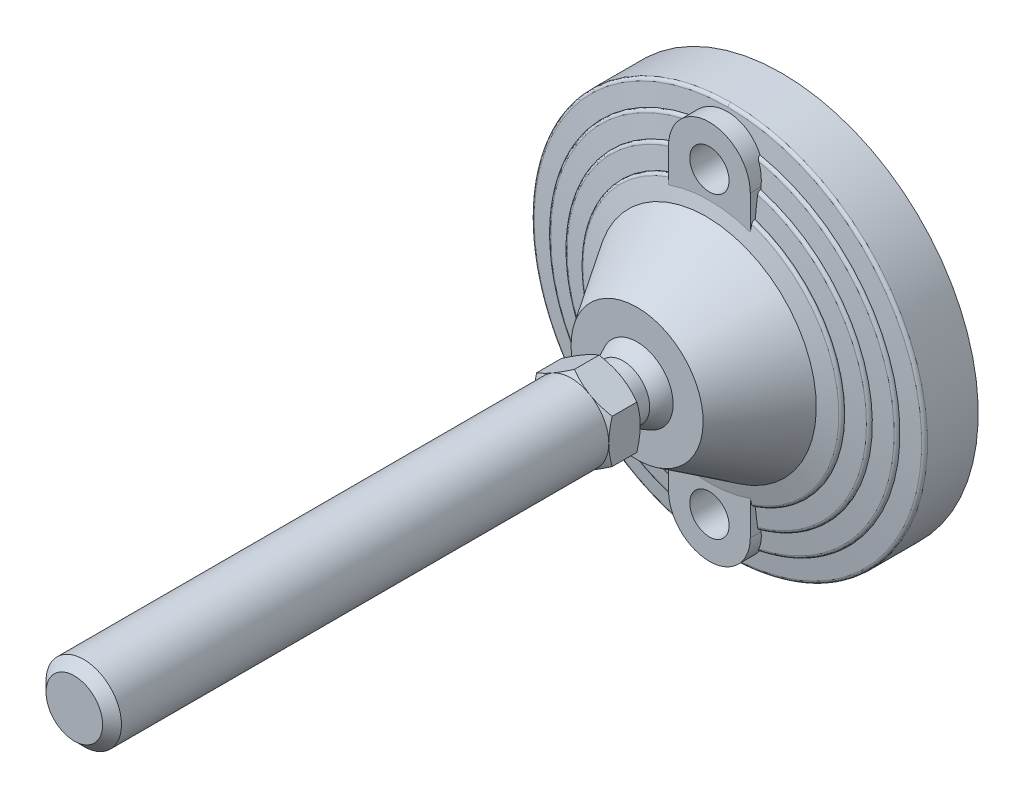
ISO-10303-21;
HEADER;
FILE_DESCRIPTION(('STEP AP214'),'2;1');
FILE_NAME('part.step','',(''),(''),'','','');
FILE_SCHEMA(('AUTOMOTIVE_DESIGN { 1 0 10303 214 1 1 1 1 }'));
ENDSEC;
DATA;
#1=APPLICATION_CONTEXT('core data for automotive mechanical design processes');
#2=APPLICATION_PROTOCOL_DEFINITION('international standard','automotive_design',2000,#1);
#3=PRODUCT_CONTEXT('',#1,'mechanical');
#4=PRODUCT('Part','Part','',(#3));
#5=PRODUCT_RELATED_PRODUCT_CATEGORY('part','',(#4));
#6=PRODUCT_DEFINITION_FORMATION('','',#4);
#7=PRODUCT_DEFINITION_CONTEXT('part definition',#1,'design');
#8=PRODUCT_DEFINITION('design','',#6,#7);
#9=PRODUCT_DEFINITION_SHAPE('','',#8);
#10=(LENGTH_UNIT() NAMED_UNIT(*) SI_UNIT(.MILLI.,.METRE.));
#11=(NAMED_UNIT(*) PLANE_ANGLE_UNIT() SI_UNIT($,.RADIAN.));
#12=(NAMED_UNIT(*) SI_UNIT($,.STERADIAN.) SOLID_ANGLE_UNIT());
#13=UNCERTAINTY_MEASURE_WITH_UNIT(LENGTH_MEASURE(1.E-05),#10,'distance_accuracy_value','');
#14=(GEOMETRIC_REPRESENTATION_CONTEXT(3) GLOBAL_UNCERTAINTY_ASSIGNED_CONTEXT((#13)) GLOBAL_UNIT_ASSIGNED_CONTEXT((#10,
#11,#12)) REPRESENTATION_CONTEXT('',''));
#15=CARTESIAN_POINT('',(0.,0.,0.));
#16=DIRECTION('',(0.,0.,1.));
#17=DIRECTION('',(1.,0.,0.));
#18=AXIS2_PLACEMENT_3D('',#15,#16,#17);
#19=CARTESIAN_POINT('',(-12.,14.022683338,57.));
#20=DIRECTION('',(0.,0.,1.));
#21=DIRECTION('',(0.,-1.,0.));
#22=AXIS2_PLACEMENT_3D('',#19,#20,#21);
#23=PLANE('',#22);
#24=CARTESIAN_POINT('',(0.,0.,57.));
#25=DIRECTION('',(0.,0.,-1.));
#26=DIRECTION('',(1.,0.,0.));
#27=AXIS2_PLACEMENT_3D('',#24,#25,#26);
#28=CIRCLE('',#27,8.5);
#29=CARTESIAN_POINT('',(8.49999999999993,0.,57.));
#30=VERTEX_POINT('',#29);
#31=EDGE_CURVE('E549',#30,#30,#28,.T.);
#32=ORIENTED_EDGE('',*,*,#31,.F.);
#33=EDGE_LOOP('',(#32));
#34=FACE_BOUND('',#33,.T.);
#35=CARTESIAN_POINT('',(0.,0.,57.));
#36=DIRECTION('',(0.,0.,1.));
#37=DIRECTION('',(0.,-1.,0.));
#38=AXIS2_PLACEMENT_3D('',#35,#36,#37);
#39=CIRCLE('',#38,12.);
#40=CARTESIAN_POINT('',(6.0000000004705,-10.3923048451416,57.));
#41=VERTEX_POINT('',#40);
#42=CARTESIAN_POINT('',(-6.00000000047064,-10.3923048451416,57.));
#43=VERTEX_POINT('',#42);
#44=EDGE_CURVE('E26',#41,#43,#39,.F.);
#45=ORIENTED_EDGE('',*,*,#44,.T.);
#46=CARTESIAN_POINT('',(-12.,0.,57.));
#47=VERTEX_POINT('',#46);
#48=EDGE_CURVE('E9',#43,#47,#39,.F.);
#49=ORIENTED_EDGE('',*,*,#48,.T.);
#50=CARTESIAN_POINT('',(-6.00000000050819,10.3923048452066,57.));
#51=VERTEX_POINT('',#50);
#52=EDGE_CURVE('E25',#47,#51,#39,.F.);
#53=ORIENTED_EDGE('',*,*,#52,.T.);
#54=CARTESIAN_POINT('',(6.0000000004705,10.3923048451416,57.));
#55=VERTEX_POINT('',#54);
#56=EDGE_CURVE('E239',#51,#55,#39,.F.);
#57=ORIENTED_EDGE('',*,*,#56,.T.);
#58=CARTESIAN_POINT('',(0.,0.,57.));
#59=DIRECTION('',(0.,0.,-1.));
#60=DIRECTION('',(0.,1.,0.));
#61=AXIS2_PLACEMENT_3D('',#58,#59,#60);
#62=CIRCLE('',#61,12.);
#63=CARTESIAN_POINT('',(12.,0.,57.));
#64=VERTEX_POINT('',#63);
#65=EDGE_CURVE('E253',#55,#64,#62,.T.);
#66=ORIENTED_EDGE('',*,*,#65,.T.);
#67=EDGE_CURVE('E262',#64,#41,#39,.F.);
#68=ORIENTED_EDGE('',*,*,#67,.T.);
#69=EDGE_LOOP('',(#45,#49,#53,#57,#66,#68));
#70=FACE_BOUND('',#69,.T.);
#71=ADVANCED_FACE('F14',(#34,#70),#23,.F.);
#72=CARTESIAN_POINT('',(0.,0.,57.));
#73=DIRECTION('',(0.,0.,-1.));
#74=DIRECTION('',(1.,0.,0.));
#75=AXIS2_PLACEMENT_3D('',#72,#73,#74);
#76=CYLINDRICAL_SURFACE('',#75,8.5);
#77=ORIENTED_EDGE('',*,*,#31,.T.);
#78=EDGE_LOOP('',(#77));
#79=FACE_BOUND('',#78,.T.);
#80=CARTESIAN_POINT('',(0.,0.,50.5000000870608));
#81=DIRECTION('',(0.,0.,-1.));
#82=DIRECTION('',(-1.,0.,0.));
#83=AXIS2_PLACEMENT_3D('',#80,#81,#82);
#84=CIRCLE('',#83,8.49999990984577);
#85=CARTESIAN_POINT('',(-8.49999990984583,0.,50.5000000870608));
#86=VERTEX_POINT('',#85);
#87=EDGE_CURVE('E548',#86,#86,#84,.T.);
#88=ORIENTED_EDGE('',*,*,#87,.F.);
#89=EDGE_LOOP('',(#88));
#90=FACE_BOUND('',#89,.T.);
#91=ADVANCED_FACE('F367',(#79,#90),#76,.T.);
#92=CARTESIAN_POINT('',(0.,0.,41.678860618));
#93=DIRECTION('',(0.,0.,-1.));
#94=DIRECTION('',(1.,0.,0.));
#95=AXIS2_PLACEMENT_3D('',#92,#93,#94);
#96=SPHERICAL_SURFACE('',#95,12.25);
#97=CARTESIAN_POINT('',(0.,0.,46.));
#98=DIRECTION('',(0.,0.,-1.));
#99=DIRECTION('',(0.,1.,0.));
#100=AXIS2_PLACEMENT_3D('',#97,#98,#99);
#101=CIRCLE('',#100,11.4625588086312);
#102=CARTESIAN_POINT('',(0.,11.4625588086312,46.));
#103=VERTEX_POINT('',#102);
#104=EDGE_CURVE('E545',#103,#103,#101,.F.);
#105=ORIENTED_EDGE('',*,*,#104,.T.);
#106=EDGE_LOOP('',(#105));
#107=FACE_BOUND('',#106,.T.);
#108=ORIENTED_EDGE('',*,*,#87,.T.);
#109=EDGE_LOOP('',(#108));
#110=FACE_BOUND('',#109,.T.);
#111=ADVANCED_FACE('F362',(#107,#110),#96,.T.);
#112=CARTESIAN_POINT('',(-21.325127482,-21.252,46.));
#113=DIRECTION('',(0.,0.,-1.));
#114=DIRECTION('',(0.,1.,0.));
#115=AXIS2_PLACEMENT_3D('',#112,#113,#114);
#116=PLANE('',#115);
#117=ORIENTED_EDGE('',*,*,#104,.F.);
#118=EDGE_LOOP('',(#117));
#119=FACE_BOUND('',#118,.T.);
#120=CARTESIAN_POINT('',(0.,0.,46.));
#121=DIRECTION('',(0.,0.,-1.));
#122=DIRECTION('',(0.,1.,0.));
#123=AXIS2_PLACEMENT_3D('',#120,#121,#122);
#124=CIRCLE('',#123,21.);
#125=CARTESIAN_POINT('',(0.,21.,46.));
#126=VERTEX_POINT('',#125);
#127=EDGE_CURVE('E408',#126,#126,#124,.T.);
#128=ORIENTED_EDGE('',*,*,#127,.F.);
#129=EDGE_LOOP('',(#128));
#130=FACE_BOUND('',#129,.T.);
#131=ADVANCED_FACE('F366',(#119,#130),#116,.F.);
#132=CARTESIAN_POINT('',(0.,-47.5,0.));
#133=DIRECTION('',(0.,0.,1.));
#134=DIRECTION('',(0.,-1.,0.));
#135=AXIS2_PLACEMENT_3D('',#132,#133,#134);
#136=CYLINDRICAL_SURFACE('',#135,6.25);
#137=CARTESIAN_POINT('',(0.,-47.5,0.));
#138=DIRECTION('',(0.,0.,1.));
#139=DIRECTION('',(0.,-1.,0.));
#140=AXIS2_PLACEMENT_3D('',#137,#138,#139);
#141=CIRCLE('',#140,6.25);
#142=CARTESIAN_POINT('',(0.,-53.75,0.));
#143=VERTEX_POINT('',#142);
#144=EDGE_CURVE('E541',#143,#143,#141,.F.);
#145=ORIENTED_EDGE('',*,*,#144,.T.);
#146=EDGE_LOOP('',(#145));
#147=FACE_BOUND('',#146,.T.);
#148=CARTESIAN_POINT('',(0.,-47.5,23.));
#149=DIRECTION('',(0.,0.,1.));
#150=DIRECTION('',(0.,-1.,0.));
#151=AXIS2_PLACEMENT_3D('',#148,#149,#150);
#152=CIRCLE('',#151,6.25);
#153=CARTESIAN_POINT('',(0.,-53.75,23.));
#154=VERTEX_POINT('',#153);
#155=EDGE_CURVE('E745',#154,#154,#152,.T.);
#156=ORIENTED_EDGE('',*,*,#155,.T.);
#157=EDGE_LOOP('',(#156));
#158=FACE_BOUND('',#157,.T.);
#159=ADVANCED_FACE('F370',(#147,#158),#136,.F.);
#160=CARTESIAN_POINT('',(-63.467641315,63.25,0.));
#161=DIRECTION('',(0.,0.,1.));
#162=DIRECTION('',(0.,-1.,0.));
#163=AXIS2_PLACEMENT_3D('',#160,#161,#162);
#164=PLANE('',#163);
#165=ORIENTED_EDGE('',*,*,#144,.F.);
#166=EDGE_LOOP('',(#165));
#167=FACE_BOUND('',#166,.T.);
#168=CARTESIAN_POINT('',(0.,47.5,0.));
#169=DIRECTION('',(0.,0.,1.));
#170=DIRECTION('',(0.,-1.,0.));
#171=AXIS2_PLACEMENT_3D('',#168,#169,#170);
#172=CIRCLE('',#171,6.25);
#173=CARTESIAN_POINT('',(0.,41.25,0.));
#174=VERTEX_POINT('',#173);
#175=EDGE_CURVE('E603',#174,#174,#172,.T.);
#176=ORIENTED_EDGE('',*,*,#175,.T.);
#177=EDGE_LOOP('',(#176));
#178=FACE_BOUND('',#177,.T.);
#179=CARTESIAN_POINT('',(0.,0.,0.));
#180=DIRECTION('',(0.,0.,-1.));
#181=DIRECTION('',(0.,1.,0.));
#182=AXIS2_PLACEMENT_3D('',#179,#180,#181);
#183=CIRCLE('',#182,62.5);
#184=CARTESIAN_POINT('',(0.,62.5,0.));
#185=VERTEX_POINT('',#184);
#186=EDGE_CURVE('E537',#185,#185,#183,.F.);
#187=ORIENTED_EDGE('',*,*,#186,.F.);
#188=EDGE_LOOP('',(#187));
#189=FACE_BOUND('',#188,.T.);
#190=ADVANCED_FACE('F373',(#167,#178,#189),#164,.F.);
#191=CARTESIAN_POINT('',(12.406354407,39.602176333,21.568111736));
#192=CARTESIAN_POINT('',(59.707464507,24.78394183,21.5681117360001));
#193=CARTESIAN_POINT('',(59.707464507,-24.78394183,21.5681117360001));
#194=CARTESIAN_POINT('',(12.406354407,-39.602176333,21.568111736));
#195=CARTESIAN_POINT('',(12.406354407,39.602176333,22.044046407));
#196=CARTESIAN_POINT('',(59.707464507,24.78394183,22.044046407));
#197=CARTESIAN_POINT('',(59.707464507,-24.78394183,22.044046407));
#198=CARTESIAN_POINT('',(12.406354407,-39.602176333,22.044046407));
#199=CARTESIAN_POINT('',(12.31903347,39.323440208,22.419805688));
#200=CARTESIAN_POINT('',(59.287219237,24.609502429,22.419805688));
#201=CARTESIAN_POINT('',(59.287219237,-24.609502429,22.419805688));
#202=CARTESIAN_POINT('',(12.31903347,-39.323440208,22.419805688));
#203=CARTESIAN_POINT('',(12.18115046,38.883305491,22.53720891));
#204=CARTESIAN_POINT('',(58.623636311,24.334056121,22.5372089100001));
#205=CARTESIAN_POINT('',(58.623636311,-24.334056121,22.5372089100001));
#206=CARTESIAN_POINT('',(12.18115046,-38.883305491,22.53720891));
#207=(BOUNDED_SURFACE() B_SPLINE_SURFACE(3,3,((#191,#192,#193,#194),(#195,#196,#197,#198),(#199,
#200,#201,#202),(#203,#204,#205,#206)),.UNSPECIFIED.,.F.,.F.,
.F.) B_SPLINE_SURFACE_WITH_KNOTS((4,4),(4,4),(0.,1.),(0.,1.),
.UNSPECIFIED.) GEOMETRIC_REPRESENTATION_ITEM() RATIONAL_B_SPLINE_SURFACE(((1.,0.532632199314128,
0.532632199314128,1.),(0.859679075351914,0.457892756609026,0.457892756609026,0.859679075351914),
(0.859679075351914,0.457892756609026,0.457892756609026,0.859679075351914),(1.,0.532632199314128,
0.532632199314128,1.))) REPRESENTATION_ITEM('') SURFACE());
#208=CARTESIAN_POINT('',(0.,0.,22.53720891));
#209=DIRECTION('',(0.,0.,-1.));
#210=DIRECTION('',(0.,1.,0.));
#211=AXIS2_PLACEMENT_3D('',#208,#209,#210);
#212=CIRCLE('',#211,40.746679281);
#213=CARTESIAN_POINT('',(13.,-38.6172483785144,22.537208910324));
#214=VERTEX_POINT('',#213);
#215=CARTESIAN_POINT('',(13.,38.6172483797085,22.5372089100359));
#216=VERTEX_POINT('',#215);
#217=EDGE_CURVE('E738',#214,#216,#212,.F.);
#218=CARTESIAN_POINT('',(13.,-39.4112927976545,21.5681117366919));
#219=CARTESIAN_POINT('',(13.,-39.4112933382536,21.59521048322));
#220=CARTESIAN_POINT('',(13.,-39.4101321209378,21.6222958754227));
#221=CARTESIAN_POINT('',(13.,-39.405504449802,21.6762650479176));
#222=CARTESIAN_POINT('',(13.,-39.4020383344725,21.7031488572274));
#223=CARTESIAN_POINT('',(13.,-39.3882336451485,21.7831079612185));
#224=CARTESIAN_POINT('',(13.,-39.3744885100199,21.8356344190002));
#225=CARTESIAN_POINT('',(13.,-39.3384084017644,21.937608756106));
#226=CARTESIAN_POINT('',(13.,-39.3160736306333,21.987056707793));
#227=CARTESIAN_POINT('',(13.,-39.2635909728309,22.0816017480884));
#228=CARTESIAN_POINT('',(13.,-39.233444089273,22.1266993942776));
#229=CARTESIAN_POINT('',(13.,-39.1656058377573,22.2123360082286));
#230=CARTESIAN_POINT('',(13.,-39.1277714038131,22.2527614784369));
#231=CARTESIAN_POINT('',(13.,-39.0461074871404,22.327071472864));
#232=CARTESIAN_POINT('',(13.,-39.0022718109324,22.3609491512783));
#233=CARTESIAN_POINT('',(13.,-38.9043172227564,22.4250520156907));
#234=CARTESIAN_POINT('',(13.,-38.8495953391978,22.454364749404));
#235=CARTESIAN_POINT('',(13.,-38.7644641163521,22.4909906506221));
#236=CARTESIAN_POINT('',(13.,-38.7355751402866,22.5019763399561));
#237=CARTESIAN_POINT('',(13.,-38.6769796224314,22.5214626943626));
#238=CARTESIAN_POINT('',(13.,-38.6472733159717,22.5299640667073));
#239=CARTESIAN_POINT('',(13.,-38.6172483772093,22.5372089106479));
#240=B_SPLINE_CURVE_WITH_KNOTS('',3,(#218,#219,#220,#221,#222,#223,#224,#225,#226,#227,#228,
#229,#230,#231,#232,#233,#234,#235,#236,#237,#238,#239),.UNSPECIFIED.,.F.,.F.,(4,2,2,2,2,2,2,2,
2,2,4),(0.,0.0812450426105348,0.162478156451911,0.324519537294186,0.486557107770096,
0.648573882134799,0.81393958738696,0.979477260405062,1.16468654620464,1.25731455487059,
1.34991616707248),.UNSPECIFIED.);
#241=CARTESIAN_POINT('',(13.,-39.4112927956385,21.568111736));
#242=VERTEX_POINT('',#241);
#243=EDGE_CURVE('E400',#242,#214,#240,.T.);
#244=CARTESIAN_POINT('',(0.,0.,21.568111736));
#245=DIRECTION('',(0.,0.,-1.));
#246=DIRECTION('',(0.,1.,0.));
#247=AXIS2_PLACEMENT_3D('',#244,#245,#246);
#248=CIRCLE('',#247,41.5);
#249=CARTESIAN_POINT('',(13.,39.4112927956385,21.5681117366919));
#250=VERTEX_POINT('',#249);
#251=EDGE_CURVE('E544',#250,#242,#248,.T.);
#252=CARTESIAN_POINT('',(13.,38.6172483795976,22.5372089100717));
#253=CARTESIAN_POINT('',(13.,38.6757273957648,22.5231434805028));
#254=CARTESIAN_POINT('',(13.,38.7330575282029,22.5042077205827));
#255=CARTESIAN_POINT('',(13.,38.843898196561,22.4570874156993));
#256=CARTESIAN_POINT('',(13.,38.8974017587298,22.4288864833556));
#257=CARTESIAN_POINT('',(13.,38.9989209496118,22.3637346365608));
#258=CARTESIAN_POINT('',(13.,39.0469285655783,22.3267711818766));
#259=CARTESIAN_POINT('',(13.,39.1357078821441,22.2450475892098));
#260=CARTESIAN_POINT('',(13.,39.1764870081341,22.2002955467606));
#261=CARTESIAN_POINT('',(13.,39.2479885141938,22.1059931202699));
#262=CARTESIAN_POINT('',(13.,39.2790300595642,22.0566848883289));
#263=CARTESIAN_POINT('',(13.,39.3318958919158,21.9533393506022));
#264=CARTESIAN_POINT('',(13.,39.3537228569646,21.8993034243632));
#265=CARTESIAN_POINT('',(13.,39.3839717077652,21.7991363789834));
#266=CARTESIAN_POINT('',(13.,39.3941848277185,21.7535382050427));
#267=CARTESIAN_POINT('',(13.,39.4078594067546,21.6613400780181));
#268=CARTESIAN_POINT('',(13.,39.411320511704,21.6147400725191));
#269=CARTESIAN_POINT('',(13.,39.4112927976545,21.5681117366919));
#270=B_SPLINE_CURVE_WITH_KNOTS('',3,(#252,#253,#254,#255,#256,#257,#258,#259,#260,#261,#262,
#263,#264,#265,#266,#267,#268,#269),.UNSPECIFIED.,.F.,.F.,(4,2,2,2,2,2,2,2,4),(0.,
0.180276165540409,0.360872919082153,0.541729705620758,0.722399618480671,0.896310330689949,
1.07017046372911,1.20986980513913,1.349576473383),.UNSPECIFIED.);
#271=EDGE_CURVE('E391',#216,#250,#270,.T.);
#272=ORIENTED_EDGE('',*,*,#217,.F.);
#273=ORIENTED_EDGE('',*,*,#243,.F.);
#274=ORIENTED_EDGE('',*,*,#251,.F.);
#275=ORIENTED_EDGE('',*,*,#271,.F.);
#276=EDGE_LOOP('',(#272,#273,#274,#275));
#277=FACE_BOUND('',#276,.T.);
#278=ADVANCED_FACE('F375',(#277),#207,.T.);
#279=CARTESIAN_POINT('',(0.,0.,21.568111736));
#280=DIRECTION('',(0.,0.,-1.));
#281=DIRECTION('',(0.,1.,0.));
#282=AXIS2_PLACEMENT_3D('',#279,#280,#281);
#283=CYLINDRICAL_SURFACE('',#282,41.5);
#284=CARTESIAN_POINT('',(0.,0.,21.4545454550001));
#285=DIRECTION('',(0.,0.,-1.));
#286=DIRECTION('',(0.,1.,0.));
#287=AXIS2_PLACEMENT_3D('',#284,#285,#286);
#288=CIRCLE('',#287,41.5);
#289=CARTESIAN_POINT('',(13.,39.4112927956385,21.4545454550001));
#290=VERTEX_POINT('',#289);
#291=CARTESIAN_POINT('',(13.,-39.4112927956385,21.4545454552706));
#292=VERTEX_POINT('',#291);
#293=EDGE_CURVE('E736',#290,#292,#288,.T.);
#294=ORIENTED_EDGE('',*,*,#293,.F.);
#295=DIRECTION('',(0.,0.,-1.));
#296=VECTOR('',#295,1.);
#297=CARTESIAN_POINT('',(13.,39.4112927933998,21.2785712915));
#298=LINE('',#297,#296);
#299=EDGE_CURVE('E628',#250,#290,#298,.T.);
#300=ORIENTED_EDGE('',*,*,#299,.F.);
#301=ORIENTED_EDGE('',*,*,#251,.T.);
#302=DIRECTION('',(0.,0.,1.));
#303=VECTOR('',#302,1.);
#304=CARTESIAN_POINT('',(13.,-39.4112927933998,21.2785712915));
#305=LINE('',#304,#303);
#306=EDGE_CURVE('E409',#292,#242,#305,.T.);
#307=ORIENTED_EDGE('',*,*,#306,.F.);
#308=EDGE_LOOP('',(#294,#300,#301,#307));
#309=FACE_BOUND('',#308,.T.);
#310=ADVANCED_FACE('F381',(#309),#283,.T.);
#311=CARTESIAN_POINT('',(0.,0.,21.454545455));
#312=DIRECTION('',(0.,0.,-1.));
#313=DIRECTION('',(0.,1.,0.));
#314=AXIS2_PLACEMENT_3D('',#311,#312,#313);
#315=CONICAL_SURFACE('',#314,41.5,1.4442041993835);
#316=ORIENTED_EDGE('',*,*,#293,.T.);
#317=CARTESIAN_POINT('',(13.0000000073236,-45.8176832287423,20.6748403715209));
#318=CARTESIAN_POINT('',(13.0000000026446,-45.2838642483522,20.7402005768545));
#319=CARTESIAN_POINT('',(13.000000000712,-44.7500350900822,20.8054777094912));
#320=CARTESIAN_POINT('',(12.999999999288,-43.6823542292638,20.935846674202));
#321=CARTESIAN_POINT('',(12.9999999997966,-43.1485025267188,21.0009385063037));
#322=CARTESIAN_POINT('',(13.0000000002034,-42.0807742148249,21.1309177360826));
#323=CARTESIAN_POINT('',(13.0000000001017,-41.5468976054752,21.195805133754));
#324=CARTESIAN_POINT('',(12.9999999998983,-40.4791166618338,21.3253520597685));
#325=CARTESIAN_POINT('',(12.9999999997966,-39.9452123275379,21.3900115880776));
#326=CARTESIAN_POINT('',(13.,-39.4112927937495,21.4545454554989));
#327=B_SPLINE_CURVE_WITH_KNOTS('',3,(#317,#318,#319,#320,#321,#322,#323,#324,#325,#326),
.UNSPECIFIED.,.F.,.F.,(4,2,2,2,4),(0.,1.61341623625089,3.22683223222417,4.84024827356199,
6.4536645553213),.UNSPECIFIED.);
#328=CARTESIAN_POINT('',(13.,-45.8176832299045,20.6748403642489));
#329=VERTEX_POINT('',#328);
#330=EDGE_CURVE('E411',#329,#292,#327,.T.);
#331=ORIENTED_EDGE('',*,*,#330,.F.);
#332=CARTESIAN_POINT('',(-7.48579641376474E-10,0.,20.674840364));
#333=DIRECTION('',(0.,0.,-1.));
#334=DIRECTION('',(0.,1.,0.));
#335=AXIS2_PLACEMENT_3D('',#332,#333,#334);
#336=CIRCLE('',#335,47.6262542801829);
#337=CARTESIAN_POINT('',(13.,45.8176832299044,20.6748403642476));
#338=VERTEX_POINT('',#337);
#339=EDGE_CURVE('E359',#338,#329,#336,.T.);
#340=ORIENTED_EDGE('',*,*,#339,.F.);
#341=CARTESIAN_POINT('',(13.,39.4112927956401,21.4545454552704));
#342=CARTESIAN_POINT('',(13.,39.9452123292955,21.3900115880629));
#343=CARTESIAN_POINT('',(13.,40.4791166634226,21.3253520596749));
#344=CARTESIAN_POINT('',(13.,41.5468976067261,21.195805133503));
#345=CARTESIAN_POINT('',(13.,42.0807742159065,21.1309177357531));
#346=CARTESIAN_POINT('',(13.,43.1485025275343,21.0009385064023));
#347=CARTESIAN_POINT('',(13.,43.6823542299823,20.9358466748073));
#348=CARTESIAN_POINT('',(13.,44.7500350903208,20.805477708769));
#349=CARTESIAN_POINT('',(13.,45.283864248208,20.7402005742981));
#350=CARTESIAN_POINT('',(13.,45.8176832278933,20.6748403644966));
#351=B_SPLINE_CURVE_WITH_KNOTS('',3,(#341,#342,#343,#344,#345,#346,#347,#348,#349,#350),
.UNSPECIFIED.,.F.,.F.,(4,2,2,2,4),(0.,1.61341628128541,3.22683232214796,4.84024831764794,
6.45366455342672),.UNSPECIFIED.);
#352=EDGE_CURVE('E622',#290,#338,#351,.T.);
#353=ORIENTED_EDGE('',*,*,#352,.F.);
#354=EDGE_LOOP('',(#316,#331,#340,#353));
#355=FACE_BOUND('',#354,.T.);
#356=ADVANCED_FACE('F512',(#355),#315,.T.);
#357=CARTESIAN_POINT('',(12.269850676,46.922284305,19.669623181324));
#358=CARTESIAN_POINT('',(72.557631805,31.15744926,19.669623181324));
#359=CARTESIAN_POINT('',(72.557631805,-31.15744926,19.669623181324));
#360=CARTESIAN_POINT('',(12.269850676,-46.922284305,19.669623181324));
#361=CARTESIAN_POINT('',(12.269850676,46.922284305,19.6740296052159));
#362=CARTESIAN_POINT('',(72.557631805,31.15744926,19.674029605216));
#363=CARTESIAN_POINT('',(72.557631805,-31.15744926,19.674029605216));
#364=CARTESIAN_POINT('',(12.269850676,-46.922284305,19.6740296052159));
#365=CARTESIAN_POINT('',(12.269850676,46.922284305,19.678436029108));
#366=CARTESIAN_POINT('',(72.557631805,31.15744926,19.6784360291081));
#367=CARTESIAN_POINT('',(72.557631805,-31.15744926,19.6784360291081));
#368=CARTESIAN_POINT('',(12.269850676,-46.922284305,19.678436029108));
#369=CARTESIAN_POINT('',(12.269850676,46.922284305,19.682842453));
#370=CARTESIAN_POINT('',(72.557631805,31.15744926,19.6828424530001));
#371=CARTESIAN_POINT('',(72.557631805,-31.15744926,19.6828424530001));
#372=CARTESIAN_POINT('',(12.269850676,-46.922284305,19.682842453));
#373=CARTESIAN_POINT('',(12.269850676,46.922284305,20.211436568));
#374=CARTESIAN_POINT('',(72.557631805,31.15744926,20.2114365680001));
#375=CARTESIAN_POINT('',(72.557631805,-31.15744926,20.2114365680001));
#376=CARTESIAN_POINT('',(12.269850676,-46.922284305,20.211436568));
#377=CARTESIAN_POINT('',(12.181461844,46.5842683,20.608103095));
#378=CARTESIAN_POINT('',(72.0349453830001,30.93299905,20.6081030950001));
#379=CARTESIAN_POINT('',(72.0349453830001,-30.93299905,20.6081030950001));
#380=CARTESIAN_POINT('',(12.181461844,-46.5842683,20.608103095));
#381=CARTESIAN_POINT('',(12.048804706,46.076961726,20.674840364));
#382=CARTESIAN_POINT('',(71.250478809,30.596136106,20.6748403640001));
#383=CARTESIAN_POINT('',(71.250478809,-30.596136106,20.6748403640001));
#384=CARTESIAN_POINT('',(12.048804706,-46.076961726,20.674840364));
#385=(BOUNDED_SURFACE() B_SPLINE_SURFACE(3,3,((#357,#358,#359,#360),(#361,#362,#363,#364),(#365,
#366,#367,#368),(#369,#370,#371,#372),(#373,#374,#375,#376),(#377,#378,#379,#380),(#381,#382,
#383,#384)),.UNSPECIFIED.,.F.,.F.,.F.) B_SPLINE_SURFACE_WITH_KNOTS((4,3,4),(4,4),(-0.01,0.,1.),
(0.,1.),.UNSPECIFIED.) GEOMETRIC_REPRESENTATION_ITEM() RATIONAL_B_SPLINE_SURFACE(((1.,
0.501991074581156,0.501991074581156,1.),(1.,0.501991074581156,0.501991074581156,1.),(1.,
0.501991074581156,0.501991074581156,1.),(1.,0.501991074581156,0.501991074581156,1.),
(0.83361198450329,0.418465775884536,0.418465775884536,0.83361198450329),(0.83361198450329,
0.418465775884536,0.418465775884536,0.83361198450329),(1.,0.501991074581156,0.501991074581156,1.))) REPRESENTATION_ITEM('') SURFACE());
#386=CARTESIAN_POINT('',(13.,-46.7252608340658,19.6777848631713));
#387=CARTESIAN_POINT('',(13.,-46.7253979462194,19.7054287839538));
#388=CARTESIAN_POINT('',(13.,-46.7243484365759,19.7330653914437));
#389=CARTESIAN_POINT('',(13.,-46.7198870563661,19.7881439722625));
#390=CARTESIAN_POINT('',(13.,-46.7164754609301,19.8155859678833));
#391=CARTESIAN_POINT('',(13.,-46.7027375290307,19.8972169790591));
#392=CARTESIAN_POINT('',(13.,-46.6889086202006,19.95085766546));
#393=CARTESIAN_POINT('',(13.,-46.6523707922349,20.0550506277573));
#394=CARTESIAN_POINT('',(13.,-46.6296523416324,20.1055995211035));
#395=CARTESIAN_POINT('',(13.,-46.5760978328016,20.2021956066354));
#396=CARTESIAN_POINT('',(13.,-46.5452617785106,20.2482428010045));
#397=CARTESIAN_POINT('',(13.,-46.476285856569,20.3348542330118));
#398=CARTESIAN_POINT('',(13.,-46.4381108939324,20.3753904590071));
#399=CARTESIAN_POINT('',(13.,-46.3556866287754,20.4497572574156));
#400=CARTESIAN_POINT('',(13.,-46.3114344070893,20.4835845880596));
#401=CARTESIAN_POINT('',(13.,-46.2164675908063,20.544827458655));
#402=CARTESIAN_POINT('',(13.,-46.1655796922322,20.5719736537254));
#403=CARTESIAN_POINT('',(13.,-46.0601083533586,20.6176355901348));
#404=CARTESIAN_POINT('',(13.,-46.0055288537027,20.6361603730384));
#405=CARTESIAN_POINT('',(13.,-45.9281089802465,20.6556819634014));
#406=CARTESIAN_POINT('',(13.,-45.9061721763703,20.6604842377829));
#407=CARTESIAN_POINT('',(13.,-45.8620822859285,20.6686997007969));
#408=CARTESIAN_POINT('',(13.,-45.8399296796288,20.6721154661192));
#409=CARTESIAN_POINT('',(13.,-45.817683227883,20.6748403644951));
#410=B_SPLINE_CURVE_WITH_KNOTS('',3,(#386,#387,#388,#389,#390,#391,#392,#393,#394,#395,#396,
#397,#398,#399,#400,#401,#402,#403,#404,#405,#406,#407,#408,#409),.UNSPECIFIED.,.F.,.F.,(4,2,2,
2,2,2,2,2,2,2,2,4),(0.,0.0828810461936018,0.16575244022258,0.331061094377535,0.496547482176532,
0.662033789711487,0.828332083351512,0.994710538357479,1.16697834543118,1.33906508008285,
1.40639957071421,1.47360834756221),.UNSPECIFIED.);
#411=CARTESIAN_POINT('',(13.0000000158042,-46.7252608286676,19.6777848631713));
#412=VERTEX_POINT('',#411);
#413=EDGE_CURVE('E536',#412,#329,#410,.T.);
#414=CARTESIAN_POINT('',(13.0000000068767,46.7252608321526,19.6727272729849));
#415=CARTESIAN_POINT('',(13.3212147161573,46.6358917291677,19.6727272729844));
#416=CARTESIAN_POINT('',(13.6414983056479,46.5432129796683,19.6727272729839));
#417=CARTESIAN_POINT('',(14.2801231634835,46.3512597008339,19.6727272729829));
#418=CARTESIAN_POINT('',(14.5984642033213,46.2519844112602,19.6727272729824));
#419=CARTESIAN_POINT('',(15.5526106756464,45.9435979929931,19.672727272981));
#420=CARTESIAN_POINT('',(16.1852411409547,45.7245655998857,19.67272727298));
#421=CARTESIAN_POINT('',(17.4409289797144,45.2604918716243,19.6727272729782));
#422=CARTESIAN_POINT('',(18.063985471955,45.0154481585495,19.6727272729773));
#423=CARTESIAN_POINT('',(19.3000708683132,44.4995075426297,19.6727272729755));
#424=CARTESIAN_POINT('',(19.9130888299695,44.2285843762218,19.6727272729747));
#425=CARTESIAN_POINT('',(21.127420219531,43.6615550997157,19.672727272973));
#426=CARTESIAN_POINT('',(21.7287319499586,43.3654453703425,19.6727272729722));
#427=CARTESIAN_POINT('',(23.5288179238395,42.4321391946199,19.6727272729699));
#428=CARTESIAN_POINT('',(24.7079785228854,41.7565378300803,19.6727272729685));
#429=CARTESIAN_POINT('',(27.0057517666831,40.3086198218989,19.6727272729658));
#430=CARTESIAN_POINT('',(28.1243409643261,39.5362661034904,19.6727272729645));
#431=CARTESIAN_POINT('',(30.294054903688,37.8994557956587,19.6727272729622));
#432=CARTESIAN_POINT('',(31.3451007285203,37.034894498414,19.6727272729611));
#433=CARTESIAN_POINT('',(33.3707378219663,35.2206259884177,19.6727272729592));
#434=CARTESIAN_POINT('',(34.3453363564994,34.2709268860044,19.6727272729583));
#435=CARTESIAN_POINT('',(36.2141318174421,32.2900336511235,19.6727272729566));
#436=CARTESIAN_POINT('',(37.1080775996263,31.2586025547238,19.6727272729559));
#437=CARTESIAN_POINT('',(38.8059105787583,29.1240638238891,19.6727272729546));
#438=CARTESIAN_POINT('',(39.6097954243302,28.02095431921,19.672727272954));
#439=CARTESIAN_POINT('',(41.1215543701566,25.7512425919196,19.6727272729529));
#440=CARTESIAN_POINT('',(41.8294551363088,24.5846581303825,19.6727272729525));
#441=CARTESIAN_POINT('',(43.1444737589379,22.1960153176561,19.6727272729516));
#442=CARTESIAN_POINT('',(43.7515922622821,20.9739573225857,19.6727272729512));
#443=CARTESIAN_POINT('',(44.8608053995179,18.4828922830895,19.6727272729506));
#444=CARTESIAN_POINT('',(45.3628870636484,17.2138794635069,19.6727272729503));
#445=CARTESIAN_POINT('',(46.2583633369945,14.6380667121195,19.6727272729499));
#446=CARTESIAN_POINT('',(46.6517577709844,13.3312667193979,19.6727272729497));
#447=CARTESIAN_POINT('',(47.3270706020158,10.6891374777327,19.6727272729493));
#448=CARTESIAN_POINT('',(47.608986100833,9.35380748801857,19.6727272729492));
#449=CARTESIAN_POINT('',(48.0593220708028,6.66414530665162,19.672727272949));
#450=CARTESIAN_POINT('',(48.2277425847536,5.30981312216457,19.6727272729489));
#451=CARTESIAN_POINT('',(48.4498861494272,2.59183876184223,19.6727272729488));
#452=CARTESIAN_POINT('',(48.5036145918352,1.22819702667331,19.6727272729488));
#453=CARTESIAN_POINT('',(48.4960080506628,-1.49876563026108,19.6727272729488));
#454=CARTESIAN_POINT('',(48.4346730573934,-2.86208655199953,19.6727272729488));
#455=CARTESIAN_POINT('',(48.1973677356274,-5.57880749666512,19.6727272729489));
#456=CARTESIAN_POINT('',(48.0213896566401,-6.93220684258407,19.672727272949));
#457=CARTESIAN_POINT('',(47.5560413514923,-9.61936957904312,19.6727272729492));
#458=CARTESIAN_POINT('',(47.2666711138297,-10.9531329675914,19.6727272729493));
#459=CARTESIAN_POINT('',(46.5765756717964,-13.5916227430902,19.6727272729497));
#460=CARTESIAN_POINT('',(46.1758433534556,-14.8963472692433,19.6727272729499));
#461=CARTESIAN_POINT('',(45.2658742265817,-17.4674022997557,19.6727272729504));
#462=CARTESIAN_POINT('',(44.7566374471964,-18.7337328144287,19.6727272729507));
#463=CARTESIAN_POINT('',(43.6334165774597,-21.2187182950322,19.6727272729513));
#464=CARTESIAN_POINT('',(43.0194530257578,-22.4373825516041,19.6727272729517));
#465=CARTESIAN_POINT('',(41.6909757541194,-24.8187626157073,19.6727272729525));
#466=CARTESIAN_POINT('',(40.9764618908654,-25.9814783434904,19.672727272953));
#467=CARTESIAN_POINT('',(39.7063025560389,-27.8655028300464,19.6727272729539));
#468=CARTESIAN_POINT('',(39.1770724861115,-28.604776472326,19.6727272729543));
#469=CARTESIAN_POINT('',(38.0778809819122,-30.0524665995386,19.6727272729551));
#470=CARTESIAN_POINT('',(37.5079195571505,-30.7608830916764,19.6727272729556));
#471=CARTESIAN_POINT('',(36.3291070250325,-32.144549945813,19.6727272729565));
#472=CARTESIAN_POINT('',(35.7202564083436,-32.8198007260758,19.6727272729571));
#473=CARTESIAN_POINT('',(34.465364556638,-34.1352484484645,19.6727272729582));
#474=CARTESIAN_POINT('',(33.8193109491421,-34.7754335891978,19.6727272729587));
#475=CARTESIAN_POINT('',(32.4922294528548,-36.0184899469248,19.67272727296));
#476=CARTESIAN_POINT('',(31.8112009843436,-36.6213605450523,19.6727272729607));
#477=CARTESIAN_POINT('',(30.4163089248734,-37.7878929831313,19.6727272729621));
#478=CARTESIAN_POINT('',(29.7024437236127,-38.351552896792,19.6727272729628));
#479=CARTESIAN_POINT('',(28.1769516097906,-39.4879139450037,19.6727272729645));
#480=CARTESIAN_POINT('',(27.3623770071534,-40.0566641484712,19.6727272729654));
#481=CARTESIAN_POINT('',(25.6997855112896,-41.1431320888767,19.6727272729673));
#482=CARTESIAN_POINT('',(24.851765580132,-41.6608451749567,19.6727272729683));
#483=CARTESIAN_POINT('',(23.1254909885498,-42.6432641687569,19.6727272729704));
#484=CARTESIAN_POINT('',(22.2472346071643,-43.107967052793,19.6727272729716));
#485=CARTESIAN_POINT('',(20.4623876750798,-43.9832963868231,19.6727272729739));
#486=CARTESIAN_POINT('',(19.555753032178,-44.3938329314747,19.6727272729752));
#487=CARTESIAN_POINT('',(17.7189637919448,-45.1583612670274,19.6727272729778));
#488=CARTESIAN_POINT('',(16.7888095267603,-45.5123538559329,19.6727272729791));
#489=CARTESIAN_POINT('',(14.9085132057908,-46.1625049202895,19.6727272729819));
#490=CARTESIAN_POINT('',(13.9583713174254,-46.4586638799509,19.6727272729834));
#491=CARTESIAN_POINT('',(13.0000000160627,-46.7252608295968,19.6727272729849));
#492=B_SPLINE_CURVE_WITH_KNOTS('',3,(#414,#415,#416,#417,#418,#419,#420,#421,#422,#423,#424,
#425,#426,#427,#428,#429,#430,#431,#432,#433,#434,#435,#436,#437,#438,#439,#440,#441,#442,#443,
#444,#445,#446,#447,#448,#449,#450,#451,#452,#453,#454,#455,#456,#457,#458,#459,#460,#461,#462,
#463,#464,#465,#466,#467,#468,#469,#470,#471,#472,#473,#474,#475,#476,#477,#478,#479,#480,#481,
#482,#483,#484,#485,#486,#487,#488,#489,#490,#491),.UNSPECIFIED.,.F.,.F.,(4,2,2,2,2,2,2,2,2,2,2,
2,2,2,2,2,2,2,2,2,2,2,2,2,2,2,2,2,2,2,2,2,2,2,2,2,2,2,4),(0.,1.00020816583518,2.00053180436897,
4.00833028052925,6.01631246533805,8.02635453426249,10.0366859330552,14.1084282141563,
18.1817355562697,22.2597186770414,26.3373137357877,30.4271967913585,34.5171866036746,
38.6060378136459,42.6948627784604,46.7841923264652,50.8735284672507,54.9629709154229,
59.0524118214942,63.1416604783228,67.2309094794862,71.3204349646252,75.4099608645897,
79.4997480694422,83.5895341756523,87.6785191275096,91.7675099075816,94.4937471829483,
97.2199838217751,99.9461860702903,102.673300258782,105.400459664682,108.127752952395,
111.106299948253,114.085118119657,117.064106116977,120.047978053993,123.031807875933,
126.015612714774),.UNSPECIFIED.);
#493=CARTESIAN_POINT('',(13.0000000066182,46.7252608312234,19.6777848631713));
#494=VERTEX_POINT('',#493);
#495=EDGE_CURVE('E502',#494,#412,#492,.T.);
#496=CARTESIAN_POINT('',(13.,45.8176832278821,20.6748403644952));
#497=CARTESIAN_POINT('',(13.,45.876891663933,20.6676266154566));
#498=CARTESIAN_POINT('',(13.,45.9354849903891,20.6554311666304));
#499=CARTESIAN_POINT('',(13.,46.0498761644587,20.6214764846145));
#500=CARTESIAN_POINT('',(13.,46.1056719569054,20.5997103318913));
#501=CARTESIAN_POINT('',(13.,46.2128716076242,20.5469963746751));
#502=CARTESIAN_POINT('',(13.,46.2642705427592,20.5160384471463));
#503=CARTESIAN_POINT('',(13.,46.3367247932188,20.4633763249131));
#504=CARTESIAN_POINT('',(13.,46.3600988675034,20.4447881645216));
#505=CARTESIAN_POINT('',(13.,46.4051654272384,20.4056252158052));
#506=CARTESIAN_POINT('',(13.,46.4268560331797,20.3850482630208));
#507=CARTESIAN_POINT('',(13.,46.4880645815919,20.3216088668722));
#508=CARTESIAN_POINT('',(13.,46.5249454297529,20.2761439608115));
#509=CARTESIAN_POINT('',(13.,46.5901806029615,20.1794685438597));
#510=CARTESIAN_POINT('',(13.,46.6185381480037,20.1282602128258));
#511=CARTESIAN_POINT('',(13.,46.6534889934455,20.0492930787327));
#512=CARTESIAN_POINT('',(13.,46.6637514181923,20.0231112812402));
#513=CARTESIAN_POINT('',(13.,46.681971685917,19.9699855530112));
#514=CARTESIAN_POINT('',(13.,46.6899313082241,19.9430422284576));
#515=CARTESIAN_POINT('',(13.,46.7102220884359,19.8614024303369));
#516=CARTESIAN_POINT('',(13.,46.7190275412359,19.8057552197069));
#517=CARTESIAN_POINT('',(13.,46.7237631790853,19.7378782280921));
#518=CARTESIAN_POINT('',(13.,46.7243742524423,19.7258595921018));
#519=CARTESIAN_POINT('',(13.,46.7251497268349,19.7018236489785));
#520=CARTESIAN_POINT('',(13.,46.7253147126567,19.689806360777));
#521=CARTESIAN_POINT('',(13.,46.7252608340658,19.6777848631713));
#522=B_SPLINE_CURVE_WITH_KNOTS('',3,(#496,#497,#498,#499,#500,#501,#502,#503,#504,#505,#506,
#507,#508,#509,#510,#511,#512,#513,#514,#515,#516,#517,#518,#519,#520,#521),.UNSPECIFIED.,.F.,
.F.,(4,2,2,2,2,2,2,2,2,2,2,2,4),(0.,0.178718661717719,0.357566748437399,0.536612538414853,
0.626107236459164,0.715700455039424,0.890396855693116,1.06502717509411,1.14929679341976,
1.23350112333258,1.40145319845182,1.43755286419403,1.47360518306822),.UNSPECIFIED.);
#523=EDGE_CURVE('E450',#338,#494,#522,.T.);
#524=ORIENTED_EDGE('',*,*,#339,.T.);
#525=ORIENTED_EDGE('',*,*,#413,.F.);
#526=ORIENTED_EDGE('',*,*,#495,.F.);
#527=ORIENTED_EDGE('',*,*,#523,.F.);
#528=EDGE_LOOP('',(#524,#525,#526,#527));
#529=FACE_BOUND('',#528,.T.);
#530=ADVANCED_FACE('F505',(#529),#385,.T.);
#531=CARTESIAN_POINT('',(0.,62.5,16.119206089));
#532=CARTESIAN_POINT('',(125.,62.5,16.1192060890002));
#533=CARTESIAN_POINT('',(125.,-62.5,16.1192060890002));
#534=CARTESIAN_POINT('',(0.,-62.5,16.119206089));
#535=CARTESIAN_POINT('',(0.,62.5000000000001,16.647800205));
#536=CARTESIAN_POINT('',(125.,62.5,16.6478002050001));
#537=CARTESIAN_POINT('',(125.,-62.5,16.6478002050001));
#538=CARTESIAN_POINT('',(0.,-62.5000000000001,16.647800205));
#539=CARTESIAN_POINT('',(0.,62.150618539,17.044466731));
#540=CARTESIAN_POINT('',(124.301237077,62.150618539,17.0444667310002));
#541=CARTESIAN_POINT('',(124.301237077,-62.150618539,17.0444667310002));
#542=CARTESIAN_POINT('',(0.,-62.150618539,17.044466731));
#543=CARTESIAN_POINT('',(0.,61.62625428,17.111204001));
#544=CARTESIAN_POINT('',(123.252508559,61.6262542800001,17.1112040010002));
#545=CARTESIAN_POINT('',(123.252508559,-61.6262542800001,17.1112040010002));
#546=CARTESIAN_POINT('',(0.,-61.62625428,17.111204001));
#547=(BOUNDED_SURFACE() B_SPLINE_SURFACE(3,3,((#531,#532,#533,#534),(#535,#536,#537,#538),(#539,
#540,#541,#542),(#543,#544,#545,#546)),.UNSPECIFIED.,.F.,.F.,
.F.) B_SPLINE_SURFACE_WITH_KNOTS((4,4),(4,4),(0.,1.),(0.,1.),
.UNSPECIFIED.) GEOMETRIC_REPRESENTATION_ITEM() RATIONAL_B_SPLINE_SURFACE(((1.,0.333333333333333,
0.333333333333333,1.),(0.833611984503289,0.277870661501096,0.277870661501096,0.833611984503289),
(0.833611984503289,0.277870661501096,0.277870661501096,0.833611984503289),(1.,0.333333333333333,
0.333333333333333,1.))) REPRESENTATION_ITEM('') SURFACE());
#548=CARTESIAN_POINT('',(0.,0.,16.119206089));
#549=DIRECTION('',(0.,0.,1.));
#550=DIRECTION('',(0.,-1.,0.));
#551=AXIS2_PLACEMENT_3D('',#548,#549,#550);
#552=CIRCLE('',#551,62.5);
#553=CARTESIAN_POINT('',(-9.61424185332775E-09,-62.5,16.119206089));
#554=VERTEX_POINT('',#553);
#555=CARTESIAN_POINT('',(-2.80606952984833E-09,62.5,16.119206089));
#556=VERTEX_POINT('',#555);
#557=EDGE_CURVE('E540',#554,#556,#552,.T.);
#558=CARTESIAN_POINT('',(0.,62.5,16.119206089));
#559=CARTESIAN_POINT('',(0.,62.5000000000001,16.647800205));
#560=CARTESIAN_POINT('',(0.,62.150618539,17.044466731));
#561=CARTESIAN_POINT('',(0.,61.62625428,17.111204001));
#562=(BOUNDED_CURVE() B_SPLINE_CURVE(3,(#558,#559,#560,#561),.UNSPECIFIED.,.F.,
.F.) B_SPLINE_CURVE_WITH_KNOTS((4,4),(0.,1.),
.UNSPECIFIED.) CURVE() GEOMETRIC_REPRESENTATION_ITEM() RATIONAL_B_SPLINE_CURVE((1.,
0.833611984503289,0.833611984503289,1.)) REPRESENTATION_ITEM(''));
#563=CARTESIAN_POINT('',(-8.30048725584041E-09,61.6262542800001,17.111204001));
#564=VERTEX_POINT('',#563);
#565=EDGE_CURVE('E696',#564,#556,#562,.F.);
#566=CARTESIAN_POINT('',(0.,0.,17.111204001));
#567=DIRECTION('',(0.,0.,-1.));
#568=DIRECTION('',(0.,1.,0.));
#569=AXIS2_PLACEMENT_3D('',#566,#567,#568);
#570=CIRCLE('',#569,61.62625428);
#571=CARTESIAN_POINT('',(-1.57997148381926E-08,-61.62625428,17.111204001));
#572=VERTEX_POINT('',#571);
#573=EDGE_CURVE('E640',#572,#564,#570,.F.);
#574=CARTESIAN_POINT('',(0.,-62.5,16.119206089));
#575=CARTESIAN_POINT('',(0.,-62.5000000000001,16.647800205));
#576=CARTESIAN_POINT('',(0.,-62.150618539,17.044466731));
#577=CARTESIAN_POINT('',(0.,-61.62625428,17.111204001));
#578=(BOUNDED_CURVE() B_SPLINE_CURVE(3,(#574,#575,#576,#577),.UNSPECIFIED.,.F.,
.F.) B_SPLINE_CURVE_WITH_KNOTS((4,4),(0.,1.),
.UNSPECIFIED.) CURVE() GEOMETRIC_REPRESENTATION_ITEM() RATIONAL_B_SPLINE_CURVE((1.,
0.833611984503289,0.833611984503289,1.)) REPRESENTATION_ITEM(''));
#579=EDGE_CURVE('E700',#554,#572,#578,.T.);
#580=ORIENTED_EDGE('',*,*,#557,.T.);
#581=ORIENTED_EDGE('',*,*,#565,.F.);
#582=ORIENTED_EDGE('',*,*,#573,.F.);
#583=ORIENTED_EDGE('',*,*,#579,.F.);
#584=EDGE_LOOP('',(#580,#581,#582,#583));
#585=FACE_BOUND('',#584,.T.);
#586=ADVANCED_FACE('F511',(#585),#547,.T.);
#587=CARTESIAN_POINT('',(0.,0.,16.119206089));
#588=DIRECTION('',(0.,0.,-1.));
#589=DIRECTION('',(0.,1.,0.));
#590=AXIS2_PLACEMENT_3D('',#587,#588,#589);
#591=CYLINDRICAL_SURFACE('',#590,62.5);
#592=ORIENTED_EDGE('',*,*,#557,.F.);
#593=CARTESIAN_POINT('',(0.,0.,16.119206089));
#594=DIRECTION('',(0.,0.,1.));
#595=DIRECTION('',(0.,-1.,0.));
#596=AXIS2_PLACEMENT_3D('',#593,#594,#595);
#597=CIRCLE('',#596,62.5);
#598=EDGE_CURVE('E699',#556,#554,#597,.T.);
#599=ORIENTED_EDGE('',*,*,#598,.F.);
#600=EDGE_LOOP('',(#592,#599));
#601=FACE_BOUND('',#600,.T.);
#602=ORIENTED_EDGE('',*,*,#186,.T.);
#603=EDGE_LOOP('',(#602));
#604=FACE_BOUND('',#603,.T.);
#605=ADVANCED_FACE('F423',(#601,#604),#591,.T.);
#606=CARTESIAN_POINT('',(13.,-47.5,19.557142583));
#607=DIRECTION('',(1.,0.,0.));
#608=DIRECTION('',(0.,1.,0.));
#609=AXIS2_PLACEMENT_3D('',#606,#607,#608);
#610=PLANE('',#609);
#611=ORIENTED_EDGE('',*,*,#306,.T.);
#612=ORIENTED_EDGE('',*,*,#243,.T.);
#613=CARTESIAN_POINT('',(12.999999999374,-36.6937824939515,22.9999999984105));
#614=CARTESIAN_POINT('',(12.999999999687,-37.0144078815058,22.9230665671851));
#615=CARTESIAN_POINT('',(12.9999999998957,-37.3350093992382,22.8460339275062));
#616=CARTESIAN_POINT('',(13.0000000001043,-37.9761646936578,22.6917702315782));
#617=CARTESIAN_POINT('',(13.0000000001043,-38.2967184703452,22.6145391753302));
#618=CARTESIAN_POINT('',(13.,-38.6172483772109,22.5372089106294));
#619=B_SPLINE_CURVE_WITH_KNOTS('',3,(#613,#614,#615,#616,#617,#618),.UNSPECIFIED.,.F.,.F.,(4,2,
4),(0.,0.989178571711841,1.97835713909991),.UNSPECIFIED.);
#620=CARTESIAN_POINT('',(13.,-36.6937824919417,22.9999999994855));
#621=VERTEX_POINT('',#620);
#622=EDGE_CURVE('E430',#621,#214,#619,.T.);
#623=ORIENTED_EDGE('',*,*,#622,.F.);
#624=DIRECTION('',(0.,-1.,0.));
#625=VECTOR('',#624,1.);
#626=CARTESIAN_POINT('',(13.,-48.6192575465,23.));
#627=LINE('',#626,#625);
#628=CARTESIAN_POINT('',(13.,-47.5000000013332,23.));
#629=VERTEX_POINT('',#628);
#630=EDGE_CURVE('E636',#621,#629,#627,.T.);
#631=ORIENTED_EDGE('',*,*,#630,.T.);
#632=DIRECTION('',(0.,0.,1.));
#633=VECTOR('',#632,1.);
#634=CARTESIAN_POINT('',(13.,-47.5000000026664,20.1100363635));
#635=LINE('',#634,#633);
#636=CARTESIAN_POINT('',(13.,-47.4999998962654,19.5776765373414));
#637=VERTEX_POINT('',#636);
#638=EDGE_CURVE('E725',#637,#629,#635,.T.);
#639=ORIENTED_EDGE('',*,*,#638,.F.);
#640=CARTESIAN_POINT('',(13.,-46.7246498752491,19.6728021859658));
#641=CARTESIAN_POINT('',(13.,-46.8538759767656,19.6569570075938));
#642=CARTESIAN_POINT('',(13.,-46.9831015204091,19.6411072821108));
#643=CARTESIAN_POINT('',(13.,-47.2415514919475,19.6093987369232));
#644=CARTESIAN_POINT('',(13.,-47.3707759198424,19.5935399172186));
#645=CARTESIAN_POINT('',(13.,-47.4999997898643,19.577676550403));
#646=B_SPLINE_CURVE_WITH_KNOTS('',3,(#640,#641,#642,#643,#644,#645),.UNSPECIFIED.,.F.,.F.,(4,2,
4),(0.,0.390581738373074,0.781163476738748),.UNSPECIFIED.);
#647=EDGE_CURVE('E448',#412,#637,#646,.T.);
#648=ORIENTED_EDGE('',*,*,#647,.F.);
#649=ORIENTED_EDGE('',*,*,#413,.T.);
#650=ORIENTED_EDGE('',*,*,#330,.T.);
#651=EDGE_LOOP('',(#611,#612,#623,#631,#639,#648,#649,#650));
#652=FACE_BOUND('',#651,.T.);
#653=ADVANCED_FACE('F417',(#652),#610,.T.);
#654=CARTESIAN_POINT('',(0.,0.,46.));
#655=DIRECTION('',(0.,0.,-1.));
#656=DIRECTION('',(0.,1.,0.));
#657=AXIS2_PLACEMENT_3D('',#654,#655,#656);
#658=CONICAL_SURFACE('',#657,21.,0.566729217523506);
#659=ORIENTED_EDGE('',*,*,#127,.T.);
#660=EDGE_LOOP('',(#659));
#661=FACE_BOUND('',#660,.T.);
#662=CARTESIAN_POINT('',(0.,0.,24.));
#663=DIRECTION('',(0.,0.,-1.));
#664=DIRECTION('',(0.,1.,0.));
#665=AXIS2_PLACEMENT_3D('',#662,#663,#664);
#666=CIRCLE('',#665,35.);
#667=CARTESIAN_POINT('',(0.,35.,24.));
#668=VERTEX_POINT('',#667);
#669=EDGE_CURVE('E643',#668,#668,#666,.T.);
#670=ORIENTED_EDGE('',*,*,#669,.F.);
#671=EDGE_LOOP('',(#670));
#672=FACE_BOUND('',#671,.T.);
#673=ADVANCED_FACE('F422',(#661,#672),#658,.T.);
#674=CARTESIAN_POINT('',(-13.,-60.687838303,23.));
#675=DIRECTION('',(0.,0.,-1.));
#676=DIRECTION('',(0.,1.,0.));
#677=AXIS2_PLACEMENT_3D('',#674,#675,#676);
#678=PLANE('',#677);
#679=ORIENTED_EDGE('',*,*,#155,.F.);
#680=EDGE_LOOP('',(#679));
#681=FACE_BOUND('',#680,.T.);
#682=ORIENTED_EDGE('',*,*,#630,.F.);
#683=CARTESIAN_POINT('',(0.,0.,22.9999999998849));
#684=DIRECTION('',(0.,0.,-1.));
#685=DIRECTION('',(0.,1.,0.));
#686=AXIS2_PLACEMENT_3D('',#683,#684,#685);
#687=CIRCLE('',#686,38.9285714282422);
#688=CARTESIAN_POINT('',(-13.,-36.6937824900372,22.9999999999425));
#689=VERTEX_POINT('',#688);
#690=EDGE_CURVE('E967',#689,#621,#687,.F.);
#691=ORIENTED_EDGE('',*,*,#690,.F.);
#692=DIRECTION('',(0.,1.,0.));
#693=VECTOR('',#692,1.);
#694=CARTESIAN_POINT('',(-13.,-42.064472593,23.));
#695=LINE('',#694,#693);
#696=CARTESIAN_POINT('',(-13.,-47.5,23.));
#697=VERTEX_POINT('',#696);
#698=EDGE_CURVE('E641',#697,#689,#695,.T.);
#699=ORIENTED_EDGE('',*,*,#698,.F.);
#700=CARTESIAN_POINT('',(0.,-47.5,23.));
#701=DIRECTION('',(0.,0.,-1.));
#702=DIRECTION('',(0.,1.,0.));
#703=AXIS2_PLACEMENT_3D('',#700,#701,#702);
#704=CIRCLE('',#703,13.);
#705=EDGE_CURVE('E728',#629,#697,#704,.T.);
#706=ORIENTED_EDGE('',*,*,#705,.F.);
#707=EDGE_LOOP('',(#682,#691,#699,#706));
#708=FACE_BOUND('',#707,.T.);
#709=ADVANCED_FACE('F426',(#681,#708),#678,.F.);
#710=CARTESIAN_POINT('',(0.,47.5,0.));
#711=DIRECTION('',(0.,0.,1.));
#712=DIRECTION('',(0.,-1.,0.));
#713=AXIS2_PLACEMENT_3D('',#710,#711,#712);
#714=CYLINDRICAL_SURFACE('',#713,6.25);
#715=ORIENTED_EDGE('',*,*,#175,.F.);
#716=EDGE_LOOP('',(#715));
#717=FACE_BOUND('',#716,.T.);
#718=CARTESIAN_POINT('',(0.,47.5,23.));
#719=DIRECTION('',(0.,0.,1.));
#720=DIRECTION('',(0.,-1.,0.));
#721=AXIS2_PLACEMENT_3D('',#718,#719,#720);
#722=CIRCLE('',#721,6.25);
#723=CARTESIAN_POINT('',(0.,41.25,23.));
#724=VERTEX_POINT('',#723);
#725=EDGE_CURVE('E720',#724,#724,#722,.T.);
#726=ORIENTED_EDGE('',*,*,#725,.T.);
#727=EDGE_LOOP('',(#726));
#728=FACE_BOUND('',#727,.T.);
#729=ADVANCED_FACE('F460',(#717,#728),#714,.F.);
#730=CARTESIAN_POINT('',(13.,36.628945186,19.557142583));
#731=DIRECTION('',(1.,0.,0.));
#732=DIRECTION('',(0.,1.,0.));
#733=AXIS2_PLACEMENT_3D('',#730,#731,#732);
#734=PLANE('',#733);
#735=DIRECTION('',(0.,0.,-1.));
#736=VECTOR('',#735,1.);
#737=CARTESIAN_POINT('',(13.,47.4999999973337,20.1100363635));
#738=LINE('',#737,#736);
#739=CARTESIAN_POINT('',(13.,47.4999999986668,23.));
#740=VERTEX_POINT('',#739);
#741=CARTESIAN_POINT('',(13.,47.4999999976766,19.5776765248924));
#742=VERTEX_POINT('',#741);
#743=EDGE_CURVE('E714',#740,#742,#738,.T.);
#744=ORIENTED_EDGE('',*,*,#743,.F.);
#745=DIRECTION('',(0.,-1.,0.));
#746=VECTOR('',#745,1.);
#747=CARTESIAN_POINT('',(13.,48.5968912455,23.));
#748=LINE('',#747,#746);
#749=CARTESIAN_POINT('',(13.,36.6937824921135,22.9999999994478));
#750=VERTEX_POINT('',#749);
#751=EDGE_CURVE('E650',#740,#750,#748,.T.);
#752=ORIENTED_EDGE('',*,*,#751,.T.);
#753=CARTESIAN_POINT('',(13.,36.6937824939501,22.9999999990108));
#754=CARTESIAN_POINT('',(13.,37.6335857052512,22.774510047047));
#755=CARTESIAN_POINT('',(13.,38.6172483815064,22.5372089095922));
#756=B_SPLINE_CURVE_WITH_KNOTS('',2,(#753,#754,#755),.UNSPECIFIED.,.F.,.F.,(3,3),(0.,1.),.UNSPECIFIED.);
#757=EDGE_CURVE('E599',#750,#216,#756,.T.);
#758=ORIENTED_EDGE('',*,*,#757,.T.);
#759=ORIENTED_EDGE('',*,*,#271,.T.);
#760=ORIENTED_EDGE('',*,*,#299,.T.);
#761=ORIENTED_EDGE('',*,*,#352,.T.);
#762=ORIENTED_EDGE('',*,*,#523,.T.);
#763=CARTESIAN_POINT('',(13.,47.4999999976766,19.5776765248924));
#764=CARTESIAN_POINT('',(13.,47.3707760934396,19.593539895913));
#765=CARTESIAN_POINT('',(13.,47.2415516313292,19.6093987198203));
#766=CARTESIAN_POINT('',(13.,46.9831015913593,19.6411072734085));
#767=CARTESIAN_POINT('',(13.,46.8538760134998,19.6569570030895));
#768=CARTESIAN_POINT('',(13.,46.724649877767,19.6728021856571));
#769=B_SPLINE_CURVE_WITH_KNOTS('',3,(#763,#764,#765,#766,#767,#768),.UNSPECIFIED.,.F.,.F.,(4,2,
4),(0.,0.390581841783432,0.78116368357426),.UNSPECIFIED.);
#770=EDGE_CURVE('E504',#742,#494,#769,.T.);
#771=ORIENTED_EDGE('',*,*,#770,.F.);
#772=EDGE_LOOP('',(#744,#752,#758,#759,#760,#761,#762,#771));
#773=FACE_BOUND('',#772,.T.);
#774=ADVANCED_FACE('F458',(#773),#734,.T.);
#775=CARTESIAN_POINT('',(0.,0.,19.672727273));
#776=DIRECTION('',(0.,0.,-1.));
#777=DIRECTION('',(0.,1.,0.));
#778=AXIS2_PLACEMENT_3D('',#775,#776,#777);
#779=CONICAL_SURFACE('',#778,48.5,1.44420419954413);
#780=ORIENTED_EDGE('',*,*,#770,.T.);
#781=ORIENTED_EDGE('',*,*,#495,.T.);
#782=ORIENTED_EDGE('',*,*,#647,.T.);
#783=CARTESIAN_POINT('',(11.5932568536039,-53.3818700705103,18.8930221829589));
#784=CARTESIAN_POINT('',(11.7613010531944,-53.0507456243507,18.929666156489));
#785=CARTESIAN_POINT('',(11.9150335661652,-52.7124850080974,18.967392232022));
#786=CARTESIAN_POINT('',(12.1930253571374,-52.0241209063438,19.0448334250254));
#787=CARTESIAN_POINT('',(12.31727279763,-51.6740127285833,19.0845493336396));
#788=CARTESIAN_POINT('',(12.5332133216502,-50.9714687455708,19.1649849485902));
#789=CARTESIAN_POINT('',(12.6254861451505,-50.6192069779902,19.2056706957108));
#790=CARTESIAN_POINT('',(12.7801065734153,-49.9085284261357,19.2885418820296));
#791=CARTESIAN_POINT('',(12.842470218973,-49.5501150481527,19.3307265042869));
#792=CARTESIAN_POINT('',(12.9262918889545,-48.9107514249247,19.4067383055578));
#793=CARTESIAN_POINT('',(12.9538012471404,-48.6305476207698,19.4403063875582));
#794=CARTESIAN_POINT('',(12.9907296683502,-48.066897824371,19.5083749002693));
#795=CARTESIAN_POINT('',(13.0000099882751,-47.7834433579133,19.5428804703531));
#796=CARTESIAN_POINT('',(13.,-47.4999997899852,19.5776765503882));
#797=B_SPLINE_CURVE_WITH_KNOTS('',3,(#783,#784,#785,#786,#787,#788,#789,#790,#791,#792,#793,
#794,#795,#796),.UNSPECIFIED.,.F.,.F.,(4,2,2,2,2,2,4),(0.,1.11904065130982,2.23852981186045,
3.3365046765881,4.43389001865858,5.28395886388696,6.14047297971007),.UNSPECIFIED.);
#798=CARTESIAN_POINT('',(11.593256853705,-53.381870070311,18.8930221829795));
#799=VERTEX_POINT('',#798);
#800=EDGE_CURVE('E486',#799,#637,#797,.T.);
#801=ORIENTED_EDGE('',*,*,#800,.F.);
#802=CARTESIAN_POINT('',(6.44049130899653E-11,0.,18.893022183));
#803=DIRECTION('',(0.,0.,-1.));
#804=DIRECTION('',(0.,1.,0.));
#805=AXIS2_PLACEMENT_3D('',#802,#803,#804);
#806=CIRCLE('',#805,54.6262542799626);
#807=CARTESIAN_POINT('',(11.5932568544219,53.381870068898,18.8930221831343));
#808=VERTEX_POINT('',#807);
#809=EDGE_CURVE('E637',#808,#799,#806,.T.);
#810=ORIENTED_EDGE('',*,*,#809,.F.);
#811=CARTESIAN_POINT('',(13.,47.4999999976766,19.5776765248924));
#812=CARTESIAN_POINT('',(13.0000412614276,47.8703415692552,19.5322107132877));
#813=CARTESIAN_POINT('',(12.9841765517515,48.240746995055,19.4872383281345));
#814=CARTESIAN_POINT('',(12.920880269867,48.9791698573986,19.3985010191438));
#815=CARTESIAN_POINT('',(12.8734342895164,49.3471861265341,19.354736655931));
#816=CARTESIAN_POINT('',(12.748436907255,50.0709315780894,19.2695070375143));
#817=CARTESIAN_POINT('',(12.6714831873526,50.4267608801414,19.228013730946));
#818=CARTESIAN_POINT('',(12.4879990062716,51.1307124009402,19.1466643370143));
#819=CARTESIAN_POINT('',(12.3814849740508,51.478838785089,19.106807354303));
#820=CARTESIAN_POINT('',(12.1668531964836,52.0877128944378,19.0376853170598));
#821=CARTESIAN_POINT('',(12.0645073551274,52.3504706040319,19.008057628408));
#822=CARTESIAN_POINT('',(11.8420691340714,52.8708603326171,18.9497450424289));
#823=CARTESIAN_POINT('',(11.7218478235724,53.1284382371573,18.9210690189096));
#824=CARTESIAN_POINT('',(11.5932568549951,53.3818700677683,18.8930221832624));
#825=B_SPLINE_CURVE_WITH_KNOTS('',3,(#811,#812,#813,#814,#815,#816,#817,#818,#819,#820,#821,
#822,#823,#824),.UNSPECIFIED.,.F.,.F.,(4,2,2,2,2,2,4),(0.,1.11903694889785,2.23858477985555,
3.33656129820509,4.43392880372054,5.28397257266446,6.14047502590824),.UNSPECIFIED.);
#826=EDGE_CURVE('E477',#742,#808,#825,.T.);
#827=ORIENTED_EDGE('',*,*,#826,.F.);
#828=EDGE_LOOP('',(#780,#781,#782,#801,#810,#827));
#829=FACE_BOUND('',#828,.T.);
#830=ADVANCED_FACE('F452',(#829),#779,.T.);
#831=CARTESIAN_POINT('',(10.12472555,54.568671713,17.887804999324));
#832=CARTESIAN_POINT('',(88.7454914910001,39.98129671,17.887804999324));
#833=CARTESIAN_POINT('',(88.7454914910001,-39.98129671,17.887804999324));
#834=CARTESIAN_POINT('',(10.12472555,-54.568671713,17.887804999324));
#835=CARTESIAN_POINT('',(10.12472555,54.568671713,17.892211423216));
#836=CARTESIAN_POINT('',(88.7454914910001,39.98129671,17.8922114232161));
#837=CARTESIAN_POINT('',(88.7454914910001,-39.98129671,17.8922114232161));
#838=CARTESIAN_POINT('',(10.12472555,-54.568671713,17.892211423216));
#839=CARTESIAN_POINT('',(10.12472555,54.568671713,17.896617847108));
#840=CARTESIAN_POINT('',(88.7454914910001,39.98129671,17.8966178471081));
#841=CARTESIAN_POINT('',(88.7454914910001,-39.98129671,17.8966178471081));
#842=CARTESIAN_POINT('',(10.12472555,-54.568671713,17.896617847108));
#843=CARTESIAN_POINT('',(10.12472555,54.568671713,17.901024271));
#844=CARTESIAN_POINT('',(88.7454914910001,39.98129671,17.9010242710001));
#845=CARTESIAN_POINT('',(88.7454914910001,-39.98129671,17.9010242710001));
#846=CARTESIAN_POINT('',(10.12472555,-54.568671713,17.901024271));
#847=CARTESIAN_POINT('',(10.12472555,54.5686717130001,18.429618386));
#848=CARTESIAN_POINT('',(88.745491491,39.9812967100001,18.4296183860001));
#849=CARTESIAN_POINT('',(88.745491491,-39.9812967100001,18.4296183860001));
#850=CARTESIAN_POINT('',(10.12472555,-54.5686717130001,18.429618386));
#851=CARTESIAN_POINT('',(10.060988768,54.225153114,18.826284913));
#852=CARTESIAN_POINT('',(88.186824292,39.729607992,18.8262849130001));
#853=CARTESIAN_POINT('',(88.186824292,-39.729607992,18.8262849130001));
#854=CARTESIAN_POINT('',(10.060988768,-54.225153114,18.826284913));
#855=CARTESIAN_POINT('',(9.96533031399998,53.709588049,18.893022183));
#856=CARTESIAN_POINT('',(87.348356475,39.351864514,18.8930221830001));
#857=CARTESIAN_POINT('',(87.348356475,-39.351864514,18.8930221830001));
#858=CARTESIAN_POINT('',(9.96533031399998,-53.709588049,18.893022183));
#859=(BOUNDED_SURFACE() B_SPLINE_SURFACE(3,3,((#831,#832,#833,#834),(#835,#836,#837,#838),(#839,
#840,#841,#842),(#843,#844,#845,#846),(#847,#848,#849,#850),(#851,#852,#853,#854),(#855,#856,
#857,#858)),.UNSPECIFIED.,.F.,.F.,.F.) B_SPLINE_SURFACE_WITH_KNOTS((4,3,4),(4,4),(-0.01,0.,1.),
(0.,1.),.UNSPECIFIED.) GEOMETRIC_REPRESENTATION_ITEM() RATIONAL_B_SPLINE_SURFACE(((1.,
0.45495165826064,0.45495165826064,1.),(1.,0.45495165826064,0.45495165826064,1.),(1.,
0.45495165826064,0.45495165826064,1.),(1.,0.45495165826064,0.45495165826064,1.),
(0.833611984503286,0.379253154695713,0.379253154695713,0.833611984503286),(0.833611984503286,
0.379253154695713,0.379253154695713,0.833611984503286),(1.,0.45495165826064,0.45495165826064,1.))) REPRESENTATION_ITEM('') SURFACE());
#860=CARTESIAN_POINT('',(0.,0.,17.890909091));
#861=DIRECTION('',(0.,0.,-1.));
#862=DIRECTION('',(0.,1.,0.));
#863=AXIS2_PLACEMENT_3D('',#860,#861,#862);
#864=CIRCLE('',#863,55.5);
#865=CARTESIAN_POINT('',(11.021007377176,54.3947368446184,17.8959666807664));
#866=VERTEX_POINT('',#865);
#867=CARTESIAN_POINT('',(11.0210073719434,-54.394736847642,17.8959666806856));
#868=VERTEX_POINT('',#867);
#869=EDGE_CURVE('E686',#866,#868,#864,.T.);
#870=CARTESIAN_POINT('',(11.5932568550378,53.3818700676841,18.8930221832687));
#871=CARTESIAN_POINT('',(11.5742588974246,53.4193168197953,18.8888715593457));
#872=CARTESIAN_POINT('',(11.5551583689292,53.4565124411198,18.8831357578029));
#873=CARTESIAN_POINT('',(11.5168510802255,53.5302460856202,18.8684898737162));
#874=CARTESIAN_POINT('',(11.4976442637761,53.5667837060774,18.8595779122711));
#875=CARTESIAN_POINT('',(11.4398026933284,53.6755694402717,18.8279485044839));
#876=CARTESIAN_POINT('',(11.4011915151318,53.7465090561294,18.8003901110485));
#877=CARTESIAN_POINT('',(11.3310664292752,53.8727053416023,18.7372637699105));
#878=CARTESIAN_POINT('',(11.2993422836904,53.9287360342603,18.70346384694));
#879=CARTESIAN_POINT('',(11.238241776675,54.0349557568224,18.6261176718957));
#880=CARTESIAN_POINT('',(11.2088591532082,54.0851605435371,18.582598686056));
#881=CARTESIAN_POINT('',(11.1609968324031,54.1658664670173,18.497795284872));
#882=CARTESIAN_POINT('',(11.1416342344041,54.1981465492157,18.4587049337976));
#883=CARTESIAN_POINT('',(11.1061235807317,54.2568626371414,18.3750125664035));
#884=CARTESIAN_POINT('',(11.0899722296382,54.2833046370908,18.3304162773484));
#885=CARTESIAN_POINT('',(11.0645457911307,54.3246839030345,18.2447155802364));
#886=CARTESIAN_POINT('',(11.0545578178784,54.3408324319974,18.204409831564));
#887=CARTESIAN_POINT('',(11.0382174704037,54.3671681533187,18.121221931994));
#888=CARTESIAN_POINT('',(11.0318575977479,54.3773676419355,18.0783452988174));
#889=CARTESIAN_POINT('',(11.0253158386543,54.3878463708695,18.0119053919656));
#890=CARTESIAN_POINT('',(11.0236343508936,54.3905364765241,17.9888429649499));
#891=CARTESIAN_POINT('',(11.0214382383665,54.3940481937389,17.9425113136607));
#892=CARTESIAN_POINT('',(11.0209241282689,54.3948689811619,17.9192420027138));
#893=CARTESIAN_POINT('',(11.021007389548,54.3947368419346,17.8959666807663));
#894=B_SPLINE_CURVE_WITH_KNOTS('',3,(#870,#871,#872,#873,#874,#875,#876,#877,#878,#879,#880,
#881,#882,#883,#884,#885,#886,#887,#888,#889,#890,#891,#892,#893),.UNSPECIFIED.,.F.,.F.,(4,2,2,
2,2,2,2,2,2,2,2,4),(0.,0.126511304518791,0.253097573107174,0.507880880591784,0.725288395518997,
0.942093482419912,1.10433476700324,1.266408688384,1.3995390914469,1.5323933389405,
1.60213777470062,1.67191295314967),.UNSPECIFIED.);
#895=EDGE_CURVE('E870',#808,#866,#894,.T.);
#896=CARTESIAN_POINT('',(11.0210073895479,-54.3947368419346,17.8959666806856));
#897=CARTESIAN_POINT('',(11.0209229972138,-54.3948706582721,17.9190661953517));
#898=CARTESIAN_POINT('',(11.0214299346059,-54.3940613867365,17.9421693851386));
#899=CARTESIAN_POINT('',(11.0235945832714,-54.3906001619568,17.9881652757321));
#900=CARTESIAN_POINT('',(11.025251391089,-54.387949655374,18.0110581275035));
#901=CARTESIAN_POINT('',(11.0296648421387,-54.3808799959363,18.0562576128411));
#902=CARTESIAN_POINT('',(11.032411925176,-54.376476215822,18.078567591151));
#903=CARTESIAN_POINT('',(11.0389383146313,-54.3659943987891,18.1226321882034));
#904=CARTESIAN_POINT('',(11.0427177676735,-54.3599161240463,18.1443867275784));
#905=CARTESIAN_POINT('',(11.0554767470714,-54.3393489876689,18.2085228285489));
#906=CARTESIAN_POINT('',(11.065888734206,-54.3225090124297,18.249892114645));
#907=CARTESIAN_POINT('',(11.0898158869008,-54.2835467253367,18.3291278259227));
#908=CARTESIAN_POINT('',(11.1033381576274,-54.26141231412,18.3669859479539));
#909=CARTESIAN_POINT('',(11.1384598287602,-54.2034507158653,18.4526827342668));
#910=CARTESIAN_POINT('',(11.1611616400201,-54.1656369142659,18.4987283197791));
#911=CARTESIAN_POINT('',(11.2095892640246,-54.08387266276,18.5831368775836));
#912=CARTESIAN_POINT('',(11.2353209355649,-54.0399102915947,18.6214845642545));
#913=CARTESIAN_POINT('',(11.2968188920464,-53.9332517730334,18.7012510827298));
#914=CARTESIAN_POINT('',(11.3332423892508,-53.868945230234,18.7400048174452));
#915=CARTESIAN_POINT('',(11.4074242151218,-53.7351050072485,18.8050561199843));
#916=CARTESIAN_POINT('',(11.44518256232,-53.6655712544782,18.8313535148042));
#917=CARTESIAN_POINT('',(11.5014324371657,-53.5595886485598,18.8613792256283));
#918=CARTESIAN_POINT('',(11.5199102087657,-53.5243893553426,18.8697736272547));
#919=CARTESIAN_POINT('',(11.5567095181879,-53.4534911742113,18.8836000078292));
#920=CARTESIAN_POINT('',(11.5750313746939,-53.4177944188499,18.8890420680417));
#921=CARTESIAN_POINT('',(11.5932568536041,-53.38187007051,18.893022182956));
#922=B_SPLINE_CURVE_WITH_KNOTS('',3,(#896,#897,#898,#899,#900,#901,#902,#903,#904,#905,#906,
#907,#908,#909,#910,#911,#912,#913,#914,#915,#916,#917,#918,#919,#920,#921),.UNSPECIFIED.,.F.,
.F.,(4,2,2,2,2,2,2,2,2,2,2,2,4),(0.,0.0692678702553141,0.138481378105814,0.207100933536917,
0.275730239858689,0.41264154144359,0.549868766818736,0.740100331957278,0.930705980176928,
1.17976894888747,1.42883537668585,1.55063397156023,1.67201400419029),.UNSPECIFIED.);
#923=EDGE_CURVE('E683',#868,#799,#922,.T.);
#924=ORIENTED_EDGE('',*,*,#869,.F.);
#925=ORIENTED_EDGE('',*,*,#895,.F.);
#926=ORIENTED_EDGE('',*,*,#809,.T.);
#927=ORIENTED_EDGE('',*,*,#923,.F.);
#928=EDGE_LOOP('',(#924,#925,#926,#927));
#929=FACE_BOUND('',#928,.T.);
#930=ADVANCED_FACE('F457',(#929),#859,.T.);
#931=CARTESIAN_POINT('',(0.,-62.5,16.119206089));
#932=CARTESIAN_POINT('',(-125.,-62.5,16.1192060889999));
#933=CARTESIAN_POINT('',(-125.,62.5,16.1192060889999));
#934=CARTESIAN_POINT('',(0.,62.5,16.119206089));
#935=CARTESIAN_POINT('',(0.,-62.5000000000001,16.647800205));
#936=CARTESIAN_POINT('',(-125.,-62.5,16.6478002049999));
#937=CARTESIAN_POINT('',(-125.,62.5,16.6478002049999));
#938=CARTESIAN_POINT('',(0.,62.5000000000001,16.647800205));
#939=CARTESIAN_POINT('',(0.,-62.150618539,17.044466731));
#940=CARTESIAN_POINT('',(-124.301237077,-62.150618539,17.0444667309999));
#941=CARTESIAN_POINT('',(-124.301237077,62.150618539,17.0444667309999));
#942=CARTESIAN_POINT('',(0.,62.150618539,17.044466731));
#943=CARTESIAN_POINT('',(0.,-61.62625428,17.111204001));
#944=CARTESIAN_POINT('',(-123.252508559,-61.6262542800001,17.1112040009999));
#945=CARTESIAN_POINT('',(-123.252508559,61.6262542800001,17.1112040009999));
#946=CARTESIAN_POINT('',(0.,61.62625428,17.111204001));
#947=(BOUNDED_SURFACE() B_SPLINE_SURFACE(3,3,((#931,#932,#933,#934),(#935,#936,#937,#938),(#939,
#940,#941,#942),(#943,#944,#945,#946)),.UNSPECIFIED.,.F.,.F.,
.F.) B_SPLINE_SURFACE_WITH_KNOTS((4,4),(4,4),(0.,1.),(0.,1.),
.UNSPECIFIED.) GEOMETRIC_REPRESENTATION_ITEM() RATIONAL_B_SPLINE_SURFACE(((1.,0.333333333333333,
0.333333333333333,1.),(0.833611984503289,0.277870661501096,0.277870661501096,0.833611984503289),
(0.833611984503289,0.277870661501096,0.277870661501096,0.833611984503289),(1.,0.333333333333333,
0.333333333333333,1.))) REPRESENTATION_ITEM('') SURFACE());
#948=CARTESIAN_POINT('',(0.,0.,17.111204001));
#949=DIRECTION('',(0.,0.,-1.));
#950=DIRECTION('',(0.,1.,0.));
#951=AXIS2_PLACEMENT_3D('',#948,#949,#950);
#952=CIRCLE('',#951,61.62625428);
#953=EDGE_CURVE('E689',#564,#572,#952,.F.);
#954=ORIENTED_EDGE('',*,*,#565,.T.);
#955=ORIENTED_EDGE('',*,*,#598,.T.);
#956=ORIENTED_EDGE('',*,*,#579,.T.);
#957=ORIENTED_EDGE('',*,*,#953,.F.);
#958=EDGE_LOOP('',(#954,#955,#956,#957));
#959=FACE_BOUND('',#958,.T.);
#960=ADVANCED_FACE('F846',(#959),#947,.T.);
#961=CARTESIAN_POINT('',(0.,-47.5,23.));
#962=DIRECTION('',(0.,0.,-1.));
#963=DIRECTION('',(0.,1.,0.));
#964=AXIS2_PLACEMENT_3D('',#961,#962,#963);
#965=CYLINDRICAL_SURFACE('',#964,13.);
#966=CARTESIAN_POINT('',(11.0212529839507,-54.3943442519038,17.8909518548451));
#967=CARTESIAN_POINT('',(10.8279142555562,-54.7034885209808,17.8572775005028));
#968=CARTESIAN_POINT('',(10.6214505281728,-55.0045428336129,17.8247251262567));
#969=CARTESIAN_POINT('',(10.1838418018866,-55.5883982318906,17.7619937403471));
#970=CARTESIAN_POINT('',(9.95269731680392,-55.8711996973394,17.7318146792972));
#971=CARTESIAN_POINT('',(9.46740937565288,-56.4163523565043,17.6739724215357));
#972=CARTESIAN_POINT('',(9.21327751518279,-56.6787137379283,17.6463079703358));
#973=CARTESIAN_POINT('',(8.68370436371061,-57.1812448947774,17.5935909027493));
#974=CARTESIAN_POINT('',(8.40826348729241,-57.4214151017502,17.5685382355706));
#975=CARTESIAN_POINT('',(7.83782458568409,-57.8779598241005,17.5211307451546));
#976=CARTESIAN_POINT('',(7.54281473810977,-58.0943197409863,17.4987775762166));
#977=CARTESIAN_POINT('',(6.93547493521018,-58.5014930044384,17.4568757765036));
#978=CARTESIAN_POINT('',(6.62314503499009,-58.6923064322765,17.4373271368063));
#979=CARTESIAN_POINT('',(5.9834710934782,-59.0469378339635,17.4011162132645));
#980=CARTESIAN_POINT('',(5.65613123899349,-59.210763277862,17.384453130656));
#981=CARTESIAN_POINT('',(4.98869237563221,-59.510276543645,17.3540716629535));
#982=CARTESIAN_POINT('',(4.64859345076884,-59.6459645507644,17.3403532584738));
#983=CARTESIAN_POINT('',(3.95859762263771,-59.888017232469,17.3159327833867));
#984=CARTESIAN_POINT('',(3.60871655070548,-59.9944265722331,17.3052261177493));
#985=CARTESIAN_POINT('',(2.90115937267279,-60.1774131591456,17.2868421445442));
#986=CARTESIAN_POINT('',(2.54348325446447,-60.2539903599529,17.2791648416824));
#987=CARTESIAN_POINT('',(1.82281990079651,-60.3767606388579,17.2668675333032));
#988=CARTESIAN_POINT('',(1.45983150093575,-60.4229469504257,17.2622482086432));
#989=CARTESIAN_POINT('',(0.731228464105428,-60.4845665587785,17.2560871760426));
#990=CARTESIAN_POINT('',(0.365613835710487,-60.4999999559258,17.2545454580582));
#991=CARTESIAN_POINT('',(-0.364119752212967,-60.5000000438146,17.2545454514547));
#992=CARTESIAN_POINT('',(-0.728238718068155,-60.484692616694,17.2560745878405));
#993=CARTESIAN_POINT('',(-1.45388119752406,-60.4235754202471,17.2621853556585));
#994=CARTESIAN_POINT('',(-1.81540471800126,-60.377765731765,17.2667669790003));
#995=CARTESIAN_POINT('',(-2.53319266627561,-60.2559952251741,17.278963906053));
#996=CARTESIAN_POINT('',(-2.88945838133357,-60.1800419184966,17.2865784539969));
#997=CARTESIAN_POINT('',(-3.59429038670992,-59.9985402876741,17.3048124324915));
#998=CARTESIAN_POINT('',(-3.94285668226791,-59.8929919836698,17.3154318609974));
#999=CARTESIAN_POINT('',(-4.62977653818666,-59.6530863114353,17.3396338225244));
#1000=CARTESIAN_POINT('',(-4.96813131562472,-59.5187323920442,17.3532160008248));
#1001=CARTESIAN_POINT('',(-5.63227981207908,-59.2221876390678,17.3832923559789));
#1002=CARTESIAN_POINT('',(-5.9580734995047,-59.059996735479,17.3997865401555));
#1003=CARTESIAN_POINT('',(-6.59489843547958,-58.7089052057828,17.4356288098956));
#1004=CARTESIAN_POINT('',(-6.90592525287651,-58.5199966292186,17.45497774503));
#1005=CARTESIAN_POINT('',(-7.51093018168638,-58.116876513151,17.4964507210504));
#1006=CARTESIAN_POINT('',(-7.80490813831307,-57.9026647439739,17.5185747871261));
#1007=CARTESIAN_POINT('',(-8.37802701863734,-57.447092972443,17.5658633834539));
#1008=CARTESIAN_POINT('',(-8.65687938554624,-57.2053740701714,17.5910685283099));
#1009=CARTESIAN_POINT('',(-9.19291505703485,-56.6992507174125,17.6441454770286));
#1010=CARTESIAN_POINT('',(-9.45009760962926,-56.4348454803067,17.6720173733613));
#1011=CARTESIAN_POINT('',(-9.94109957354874,-55.8851277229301,17.7303301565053));
#1012=CARTESIAN_POINT('',(-10.1749040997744,-55.5998020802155,17.7607726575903));
#1013=CARTESIAN_POINT('',(-10.617352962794,-55.0105165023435,17.8240792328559));
#1014=CARTESIAN_POINT('',(-10.8259970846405,-54.7065564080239,17.8569433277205));
#1015=CARTESIAN_POINT('',(-11.0212529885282,-54.3943442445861,17.8909518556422));
#1016=B_SPLINE_CURVE_WITH_KNOTS('',3,(#966,#967,#968,#969,#970,#971,#972,#973,#974,#975,#976,
#977,#978,#979,#980,#981,#982,#983,#984,#985,#986,#987,#988,#989,#990,#991,#992,#993,#994,#995,
#996,#997,#998,#999,#1000,#1001,#1002,#1003,#1004,#1005,#1006,#1007,#1008,#1009,#1010,#1011,
#1012,#1013,#1014,#1015),.UNSPECIFIED.,.F.,.F.,(4,2,2,2,2,2,2,2,2,2,2,2,2,2,2,2,2,2,2,2,2,2,2,2,
4),(0.,1.09819800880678,2.19637315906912,3.29399740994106,4.39160031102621,5.48987246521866,
6.58814112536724,7.68610528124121,8.7840622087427,9.88033477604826,10.97660904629,
12.0731273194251,13.1696420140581,14.2616756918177,15.3537064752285,16.4454653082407,
17.537223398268,18.6288508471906,19.7204810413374,20.8124367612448,21.9044023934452,
23.012740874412,24.1211178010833,25.2301960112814,26.3392836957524),.UNSPECIFIED.);
#1017=CARTESIAN_POINT('',(-11.021007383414,-54.3947368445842,17.8959666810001));
#1018=VERTEX_POINT('',#1017);
#1019=EDGE_CURVE('E693',#868,#1018,#1016,.T.);
#1020=ORIENTED_EDGE('',*,*,#1019,.F.);
#1021=ORIENTED_EDGE('',*,*,#923,.T.);
#1022=ORIENTED_EDGE('',*,*,#800,.T.);
#1023=ORIENTED_EDGE('',*,*,#638,.T.);
#1024=ORIENTED_EDGE('',*,*,#705,.T.);
#1025=DIRECTION('',(0.,0.,1.));
#1026=VECTOR('',#1025,1.);
#1027=CARTESIAN_POINT('',(-13.,-47.5,21.2785712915));
#1028=LINE('',#1027,#1026);
#1029=CARTESIAN_POINT('',(-13.,-47.500000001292,19.5776765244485));
#1030=VERTEX_POINT('',#1029);
#1031=EDGE_CURVE('E644',#1030,#697,#1028,.T.);
#1032=ORIENTED_EDGE('',*,*,#1031,.F.);
#1033=CARTESIAN_POINT('',(-11.5932568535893,-53.3818700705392,18.8930221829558));
#1034=CARTESIAN_POINT('',(-11.7613010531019,-53.0507456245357,18.9296661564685));
#1035=CARTESIAN_POINT('',(-11.9150335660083,-52.7124850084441,18.9673922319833));
#1036=CARTESIAN_POINT('',(-12.1930253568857,-52.0241209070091,19.0448334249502));
#1037=CARTESIAN_POINT('',(-12.3172727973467,-51.6740127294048,19.0845493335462));
#1038=CARTESIAN_POINT('',(-12.5332133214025,-50.9714687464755,19.1649849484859));
#1039=CARTESIAN_POINT('',(-12.6254861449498,-50.6192069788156,19.205670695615));
#1040=CARTESIAN_POINT('',(-12.7801065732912,-49.9085284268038,19.2885418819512));
#1041=CARTESIAN_POINT('',(-12.8424702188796,-49.5501150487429,19.3307265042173));
#1042=CARTESIAN_POINT('',(-12.9262918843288,-48.9107514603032,19.4067383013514));
#1043=CARTESIAN_POINT('',(-12.9538012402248,-48.6305476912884,19.4403063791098));
#1044=CARTESIAN_POINT('',(-12.9907296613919,-48.0668979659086,19.5083748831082));
#1045=CARTESIAN_POINT('',(-13.0000099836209,-47.7834435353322,19.5428804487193));
#1046=CARTESIAN_POINT('',(-13.,-47.5000000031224,19.5776765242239));
#1047=B_SPLINE_CURVE_WITH_KNOTS('',3,(#1033,#1034,#1035,#1036,#1037,#1038,#1039,#1040,#1041,
#1042,#1043,#1044,#1045,#1046),.UNSPECIFIED.,.F.,.F.,(4,2,2,2,2,2,4),(0.,1.11904065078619,
2.23852981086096,3.33650467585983,4.43389001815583,5.2839587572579,6.14047276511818),.UNSPECIFIED.);
#1048=CARTESIAN_POINT('',(-11.5932568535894,-53.3818700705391,18.8930221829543));
#1049=VERTEX_POINT('',#1048);
#1050=EDGE_CURVE('E666',#1049,#1030,#1047,.T.);
#1051=ORIENTED_EDGE('',*,*,#1050,.F.);
#1052=CARTESIAN_POINT('',(-11.0210073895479,-54.3947368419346,17.8959666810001));
#1053=CARTESIAN_POINT('',(-11.0209229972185,-54.3948706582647,17.9190661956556));
#1054=CARTESIAN_POINT('',(-11.021429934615,-54.3940613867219,17.9421693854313));
#1055=CARTESIAN_POINT('',(-11.0235945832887,-54.3906001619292,17.9881652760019));
#1056=CARTESIAN_POINT('',(-11.02525139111,-54.3879496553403,18.0110581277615));
#1057=CARTESIAN_POINT('',(-11.0296648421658,-54.3808799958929,18.0562576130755));
#1058=CARTESIAN_POINT('',(-11.0324119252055,-54.3764762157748,18.0785675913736));
#1059=CARTESIAN_POINT('',(-11.0389383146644,-54.365994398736,18.1226321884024));
#1060=CARTESIAN_POINT('',(-11.0427177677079,-54.3599161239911,18.1443867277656));
#1061=CARTESIAN_POINT('',(-11.0554767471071,-54.3393489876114,18.208522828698));
#1062=CARTESIAN_POINT('',(-11.0658887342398,-54.322509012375,18.2498921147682));
#1063=CARTESIAN_POINT('',(-11.0898158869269,-54.283546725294,18.3291278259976));
#1064=CARTESIAN_POINT('',(-11.1033381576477,-54.2614123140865,18.3669859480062));
#1065=CARTESIAN_POINT('',(-11.1384598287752,-54.2034507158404,18.4526827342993));
#1066=CARTESIAN_POINT('',(-11.161161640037,-54.1656369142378,18.4987283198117));
#1067=CARTESIAN_POINT('',(-11.2095892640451,-54.0838726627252,18.583136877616));
#1068=CARTESIAN_POINT('',(-11.2353209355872,-54.0399102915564,18.6214845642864));
#1069=CARTESIAN_POINT('',(-11.2968188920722,-53.9332517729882,18.7012510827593));
#1070=CARTESIAN_POINT('',(-11.3332423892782,-53.8689452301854,18.7400048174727));
#1071=CARTESIAN_POINT('',(-11.407424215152,-53.7351050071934,18.8050561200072));
#1072=CARTESIAN_POINT('',(-11.4451825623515,-53.6655712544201,18.8313535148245));
#1073=CARTESIAN_POINT('',(-11.5014324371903,-53.5595886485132,18.8613792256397));
#1074=CARTESIAN_POINT('',(-11.5199102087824,-53.5243893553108,18.8697736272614));
#1075=CARTESIAN_POINT('',(-11.5567095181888,-53.4534911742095,18.883600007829));
#1076=CARTESIAN_POINT('',(-11.5750313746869,-53.4177944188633,18.8890420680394));
#1077=CARTESIAN_POINT('',(-11.5932568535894,-53.3818700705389,18.8930221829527));
#1078=B_SPLINE_CURVE_WITH_KNOTS('',3,(#1052,#1053,#1054,#1055,#1056,#1057,#1058,#1059,#1060,
#1061,#1062,#1063,#1064,#1065,#1066,#1067,#1068,#1069,#1070,#1071,#1072,#1073,#1074,#1075,#1076,
#1077),.UNSPECIFIED.,.F.,.F.,(4,2,2,2,2,2,2,2,2,2,2,2,4),(0.,0.0692678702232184,
0.138481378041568,0.20710093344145,0.275730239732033,0.412641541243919,0.549868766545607,
0.740100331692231,0.930705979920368,1.179768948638,1.42883537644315,1.55063397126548,
1.67201400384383),.UNSPECIFIED.);
#1079=EDGE_CURVE('E667',#1018,#1049,#1078,.T.);
#1080=ORIENTED_EDGE('',*,*,#1079,.F.);
#1081=EDGE_LOOP('',(#1020,#1021,#1022,#1023,#1024,#1032,#1051,#1080));
#1082=FACE_BOUND('',#1081,.T.);
#1083=ADVANCED_FACE('F843',(#1082),#965,.T.);
#1084=CARTESIAN_POINT('',(-13.,-36.628945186,19.557142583));
#1085=DIRECTION('',(-1.,0.,0.));
#1086=DIRECTION('',(0.,-1.,0.));
#1087=AXIS2_PLACEMENT_3D('',#1084,#1085,#1086);
#1088=PLANE('',#1087);
#1089=ORIENTED_EDGE('',*,*,#1031,.T.);
#1090=ORIENTED_EDGE('',*,*,#698,.T.);
#1091=CARTESIAN_POINT('',(-13.0000000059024,-38.6172483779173,22.5372089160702));
#1092=CARTESIAN_POINT('',(-13.0000000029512,-38.2967184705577,22.6145391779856));
#1093=CARTESIAN_POINT('',(-13.0000000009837,-37.9761646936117,22.6917702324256));
#1094=CARTESIAN_POINT('',(-12.9999999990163,-37.3350093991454,22.8460339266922));
#1095=CARTESIAN_POINT('',(-12.9999999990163,-37.0144078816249,22.9230665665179));
#1096=CARTESIAN_POINT('',(-13.,-36.6937824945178,22.9999999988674));
#1097=B_SPLINE_CURVE_WITH_KNOTS('',3,(#1091,#1092,#1093,#1094,#1095,#1096),.UNSPECIFIED.,.F.,
.F.,(4,2,4),(0.,0.989178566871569,1.97835713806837),.UNSPECIFIED.);
#1098=CARTESIAN_POINT('',(-13.,-38.6172483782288,22.5372089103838));
#1099=VERTEX_POINT('',#1098);
#1100=EDGE_CURVE('E724',#1099,#689,#1097,.T.);
#1101=ORIENTED_EDGE('',*,*,#1100,.F.);
#1102=CARTESIAN_POINT('',(-13.,-39.4112927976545,21.5681117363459));
#1103=CARTESIAN_POINT('',(-13.,-39.4112933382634,21.5952104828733));
#1104=CARTESIAN_POINT('',(-13.,-39.4101321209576,21.6222958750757));
#1105=CARTESIAN_POINT('',(-13.,-39.4055044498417,21.6762650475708));
#1106=CARTESIAN_POINT('',(-13.,-39.4020383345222,21.7031488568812));
#1107=CARTESIAN_POINT('',(-13.,-39.3882336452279,21.7831079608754));
#1108=CARTESIAN_POINT('',(-13.,-39.3744885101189,21.8356344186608));
#1109=CARTESIAN_POINT('',(-13.,-39.3384084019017,21.9376087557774));
#1110=CARTESIAN_POINT('',(-13.,-39.3160736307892,21.9870567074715));
#1111=CARTESIAN_POINT('',(-13.,-39.2635909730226,22.0816017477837));
#1112=CARTESIAN_POINT('',(-13.,-39.2334440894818,22.1266993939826));
#1113=CARTESIAN_POINT('',(-13.,-39.1656058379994,22.2123360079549));
#1114=CARTESIAN_POINT('',(-13.,-39.1277714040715,22.2527614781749));
#1115=CARTESIAN_POINT('',(-13.,-39.0461074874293,22.327071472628));
#1116=CARTESIAN_POINT('',(-13.,-39.0022718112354,22.3609491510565));
#1117=CARTESIAN_POINT('',(-13.,-38.9043172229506,22.4250520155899));
#1118=CARTESIAN_POINT('',(-13.,-38.8495953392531,22.4543647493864));
#1119=CARTESIAN_POINT('',(-13.,-38.7644641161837,22.4909906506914));
#1120=CARTESIAN_POINT('',(-13.,-38.7355751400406,22.5019763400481));
#1121=CARTESIAN_POINT('',(-13.,-38.676979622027,22.5214626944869));
#1122=CARTESIAN_POINT('',(-13.,-38.6472733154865,22.5299640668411));
#1123=CARTESIAN_POINT('',(-13.,-38.6172483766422,22.5372089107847));
#1124=B_SPLINE_CURVE_WITH_KNOTS('',3,(#1102,#1103,#1104,#1105,#1106,#1107,#1108,#1109,#1110,
#1111,#1112,#1113,#1114,#1115,#1116,#1117,#1118,#1119,#1120,#1121,#1122,#1123),.UNSPECIFIED.,
.F.,.F.,(4,2,2,2,2,2,2,2,2,2,4),(0.,0.0812450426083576,0.162478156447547,0.324519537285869,
0.486557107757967,0.648573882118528,0.8139395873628,0.97947726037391,1.16468654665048,
1.25731455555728,1.34991616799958),.UNSPECIFIED.);
#1125=CARTESIAN_POINT('',(-13.000000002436,-39.4112927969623,21.5681117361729));
#1126=VERTEX_POINT('',#1125);
#1127=EDGE_CURVE('E648',#1126,#1099,#1124,.T.);
#1128=ORIENTED_EDGE('',*,*,#1127,.F.);
#1129=DIRECTION('',(0.,0.,1.));
#1130=VECTOR('',#1129,1.);
#1131=CARTESIAN_POINT('',(-13.000000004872,-39.4112927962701,21.5113285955));
#1132=LINE('',#1131,#1130);
#1133=CARTESIAN_POINT('',(-13.000000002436,-39.4112927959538,21.4545454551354));
#1134=VERTEX_POINT('',#1133);
#1135=EDGE_CURVE('E675',#1134,#1126,#1132,.T.);
#1136=ORIENTED_EDGE('',*,*,#1135,.F.);
#1137=CARTESIAN_POINT('',(-13.0000000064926,-45.8176832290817,20.6748403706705));
#1138=CARTESIAN_POINT('',(-13.0000000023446,-45.2838642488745,20.7402005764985));
#1139=CARTESIAN_POINT('',(-13.0000000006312,-44.7500350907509,20.8054777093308));
#1140=CARTESIAN_POINT('',(-12.9999999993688,-43.6823542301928,20.9358466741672));
#1141=CARTESIAN_POINT('',(-12.9999999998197,-43.1485025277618,21.000938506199));
#1142=CARTESIAN_POINT('',(-13.0000000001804,-42.080774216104,21.1309177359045));
#1143=CARTESIAN_POINT('',(-13.0000000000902,-41.5468976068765,21.1958051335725));
#1144=CARTESIAN_POINT('',(-12.9999999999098,-40.4791166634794,21.3253520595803));
#1145=CARTESIAN_POINT('',(-12.9999999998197,-39.9452123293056,21.3900115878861));
#1146=CARTESIAN_POINT('',(-13.,-39.4112927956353,21.454545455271));
#1147=B_SPLINE_CURVE_WITH_KNOTS('',3,(#1137,#1138,#1139,#1140,#1141,#1142,#1143,#1144,#1145,
#1146),.UNSPECIFIED.,.F.,.F.,(4,2,2,2,4),(0.,1.61341623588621,3.22683223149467,4.84024827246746,
6.45366455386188),.UNSPECIFIED.);
#1148=CARTESIAN_POINT('',(-13.0000000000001,-45.8176832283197,20.674840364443));
#1149=VERTEX_POINT('',#1148);
#1150=EDGE_CURVE('E676',#1149,#1134,#1147,.T.);
#1151=ORIENTED_EDGE('',*,*,#1150,.F.);
#1152=CARTESIAN_POINT('',(-13.,-46.7252608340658,19.6777848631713));
#1153=CARTESIAN_POINT('',(-13.,-46.7253979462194,19.7054287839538));
#1154=CARTESIAN_POINT('',(-13.,-46.7243484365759,19.7330653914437));
#1155=CARTESIAN_POINT('',(-13.,-46.7198870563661,19.7881439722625));
#1156=CARTESIAN_POINT('',(-13.,-46.7164754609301,19.8155859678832));
#1157=CARTESIAN_POINT('',(-13.,-46.7027375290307,19.8972169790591));
#1158=CARTESIAN_POINT('',(-13.,-46.6889086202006,19.95085766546));
#1159=CARTESIAN_POINT('',(-13.,-46.6523707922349,20.0550506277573));
#1160=CARTESIAN_POINT('',(-13.,-46.6296523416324,20.1055995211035));
#1161=CARTESIAN_POINT('',(-13.,-46.5760978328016,20.2021956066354));
#1162=CARTESIAN_POINT('',(-13.,-46.5452617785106,20.2482428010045));
#1163=CARTESIAN_POINT('',(-13.,-46.476285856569,20.3348542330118));
#1164=CARTESIAN_POINT('',(-13.,-46.4381108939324,20.3753904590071));
#1165=CARTESIAN_POINT('',(-13.,-46.3556866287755,20.4497572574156));
#1166=CARTESIAN_POINT('',(-13.,-46.3114344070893,20.4835845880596));
#1167=CARTESIAN_POINT('',(-13.,-46.2164675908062,20.5448274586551));
#1168=CARTESIAN_POINT('',(-13.,-46.165579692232,20.5719736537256));
#1169=CARTESIAN_POINT('',(-13.,-46.0601083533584,20.6176355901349));
#1170=CARTESIAN_POINT('',(-13.,-46.0055288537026,20.6361603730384));
#1171=CARTESIAN_POINT('',(-13.,-45.9281089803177,20.6556819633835));
#1172=CARTESIAN_POINT('',(-13.,-45.9061721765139,20.6604842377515));
#1173=CARTESIAN_POINT('',(-13.,-45.862082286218,20.6686997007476));
#1174=CARTESIAN_POINT('',(-13.0000000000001,-45.8399296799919,20.6721154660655));
#1175=CARTESIAN_POINT('',(-13.0000000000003,-45.81768322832,20.6748403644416));
#1176=B_SPLINE_CURVE_WITH_KNOTS('',3,(#1152,#1153,#1154,#1155,#1156,#1157,#1158,#1159,#1160,
#1161,#1162,#1163,#1164,#1165,#1166,#1167,#1168,#1169,#1170,#1171,#1172,#1173,#1174,#1175),
.UNSPECIFIED.,.F.,.F.,(4,2,2,2,2,2,2,2,2,2,2,4),(0.,0.0828810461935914,0.165752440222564,
0.331061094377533,0.496547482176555,0.662033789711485,0.828332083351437,0.994710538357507,
1.16697834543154,1.33906508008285,1.40639957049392,1.47360834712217),.UNSPECIFIED.);
#1177=CARTESIAN_POINT('',(-13.0000000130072,-46.7252608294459,19.6777848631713));
#1178=VERTEX_POINT('',#1177);
#1179=EDGE_CURVE('E680',#1178,#1149,#1176,.T.);
#1180=ORIENTED_EDGE('',*,*,#1179,.F.);
#1181=CARTESIAN_POINT('',(-12.999999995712,-47.5000000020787,19.5776765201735));
#1182=CARTESIAN_POINT('',(-12.999999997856,-47.3707760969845,19.5935398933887));
#1183=CARTESIAN_POINT('',(-12.9999999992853,-47.2415516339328,19.6093987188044));
#1184=CARTESIAN_POINT('',(-13.0000000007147,-46.9831015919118,19.6411072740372));
#1185=CARTESIAN_POINT('',(-13.0000000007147,-46.8538760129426,19.6569570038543));
#1186=CARTESIAN_POINT('',(-13.,-46.7246498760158,19.6728021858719));
#1187=B_SPLINE_CURVE_WITH_KNOTS('',3,(#1181,#1182,#1183,#1184,#1185,#1186),.UNSPECIFIED.,.F.,
.F.,(4,2,4),(0.,0.390581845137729,0.78116369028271),.UNSPECIFIED.);
#1188=EDGE_CURVE('E987',#1030,#1178,#1187,.T.);
#1189=ORIENTED_EDGE('',*,*,#1188,.F.);
#1190=EDGE_LOOP('',(#1089,#1090,#1101,#1128,#1136,#1151,#1180,#1189));
#1191=FACE_BOUND('',#1190,.T.);
#1192=ADVANCED_FACE('F616',(#1191),#1088,.T.);
#1193=CARTESIAN_POINT('',(0.,0.,24.));
#1194=DIRECTION('',(0.,0.,-1.));
#1195=DIRECTION('',(0.,1.,0.));
#1196=AXIS2_PLACEMENT_3D('',#1193,#1194,#1195);
#1197=CONICAL_SURFACE('',#1196,35.,1.32154418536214);
#1198=ORIENTED_EDGE('',*,*,#669,.T.);
#1199=EDGE_LOOP('',(#1198));
#1200=FACE_BOUND('',#1199,.T.);
#1201=ORIENTED_EDGE('',*,*,#1100,.T.);
#1202=ORIENTED_EDGE('',*,*,#690,.T.);
#1203=ORIENTED_EDGE('',*,*,#622,.T.);
#1204=ORIENTED_EDGE('',*,*,#217,.T.);
#1205=ORIENTED_EDGE('',*,*,#757,.F.);
#1206=CARTESIAN_POINT('',(0.,0.,22.9999999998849));
#1207=DIRECTION('',(0.,0.,-1.));
#1208=DIRECTION('',(0.,1.,0.));
#1209=AXIS2_PLACEMENT_3D('',#1206,#1207,#1208);
#1210=CIRCLE('',#1209,38.9285714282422);
#1211=CARTESIAN_POINT('',(-13.,36.6937824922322,22.9999999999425));
#1212=VERTEX_POINT('',#1211);
#1213=EDGE_CURVE('E653',#750,#1212,#1210,.F.);
#1214=ORIENTED_EDGE('',*,*,#1213,.T.);
#1215=CARTESIAN_POINT('',(-13.,38.6172483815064,22.5372089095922));
#1216=CARTESIAN_POINT('',(-13.,37.6335856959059,22.774510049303));
#1217=CARTESIAN_POINT('',(-13.,36.6937824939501,22.9999999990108));
#1218=B_SPLINE_CURVE_WITH_KNOTS('',2,(#1215,#1216,#1217),.UNSPECIFIED.,.F.,.F.,(3,3),(0.,1.),.UNSPECIFIED.);
#1219=CARTESIAN_POINT('',(-13.,38.6172483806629,22.5372089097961));
#1220=VERTEX_POINT('',#1219);
#1221=EDGE_CURVE('E604',#1220,#1212,#1218,.T.);
#1222=ORIENTED_EDGE('',*,*,#1221,.F.);
#1223=CARTESIAN_POINT('',(0.,0.,22.53720891));
#1224=DIRECTION('',(0.,0.,-1.));
#1225=DIRECTION('',(0.,1.,0.));
#1226=AXIS2_PLACEMENT_3D('',#1223,#1224,#1225);
#1227=CIRCLE('',#1226,40.746679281);
#1228=EDGE_CURVE('E649',#1099,#1220,#1227,.T.);
#1229=ORIENTED_EDGE('',*,*,#1228,.F.);
#1230=EDGE_LOOP('',(#1201,#1202,#1203,#1204,#1205,#1214,#1222,#1229));
#1231=FACE_BOUND('',#1230,.T.);
#1232=ADVANCED_FACE('F850',(#1200,#1231),#1197,.T.);
#1233=CARTESIAN_POINT('',(-12.269850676,-46.922284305,19.669623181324));
#1234=CARTESIAN_POINT('',(-72.557631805,-31.15744926,19.6696231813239));
#1235=CARTESIAN_POINT('',(-72.557631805,31.15744926,19.6696231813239));
#1236=CARTESIAN_POINT('',(-12.269850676,46.922284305,19.669623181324));
#1237=CARTESIAN_POINT('',(-12.269850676,-46.922284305,19.6740296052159));
#1238=CARTESIAN_POINT('',(-72.557631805,-31.15744926,19.6740296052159));
#1239=CARTESIAN_POINT('',(-72.557631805,31.15744926,19.6740296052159));
#1240=CARTESIAN_POINT('',(-12.269850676,46.922284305,19.6740296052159));
#1241=CARTESIAN_POINT('',(-12.269850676,-46.922284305,19.678436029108));
#1242=CARTESIAN_POINT('',(-72.557631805,-31.15744926,19.6784360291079));
#1243=CARTESIAN_POINT('',(-72.557631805,31.15744926,19.6784360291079));
#1244=CARTESIAN_POINT('',(-12.269850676,46.922284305,19.678436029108));
#1245=CARTESIAN_POINT('',(-12.269850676,-46.922284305,19.682842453));
#1246=CARTESIAN_POINT('',(-72.557631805,-31.15744926,19.6828424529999));
#1247=CARTESIAN_POINT('',(-72.557631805,31.15744926,19.6828424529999));
#1248=CARTESIAN_POINT('',(-12.269850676,46.922284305,19.682842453));
#1249=CARTESIAN_POINT('',(-12.269850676,-46.922284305,20.211436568));
#1250=CARTESIAN_POINT('',(-72.557631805,-31.15744926,20.2114365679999));
#1251=CARTESIAN_POINT('',(-72.557631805,31.15744926,20.2114365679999));
#1252=CARTESIAN_POINT('',(-12.269850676,46.922284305,20.211436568));
#1253=CARTESIAN_POINT('',(-12.181461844,-46.5842683,20.608103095));
#1254=CARTESIAN_POINT('',(-72.034945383,-30.93299905,20.6081030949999));
#1255=CARTESIAN_POINT('',(-72.034945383,30.93299905,20.6081030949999));
#1256=CARTESIAN_POINT('',(-12.181461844,46.5842683,20.608103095));
#1257=CARTESIAN_POINT('',(-12.048804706,-46.076961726,20.674840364));
#1258=CARTESIAN_POINT('',(-71.2504788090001,-30.596136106,20.6748403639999));
#1259=CARTESIAN_POINT('',(-71.2504788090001,30.596136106,20.6748403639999));
#1260=CARTESIAN_POINT('',(-12.048804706,46.076961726,20.674840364));
#1261=(BOUNDED_SURFACE() B_SPLINE_SURFACE(3,3,((#1233,#1234,#1235,#1236),(#1237,#1238,#1239,
#1240),(#1241,#1242,#1243,#1244),(#1245,#1246,#1247,#1248),(#1249,#1250,#1251,#1252),(#1253,
#1254,#1255,#1256),(#1257,#1258,#1259,#1260)),.UNSPECIFIED.,.F.,.F.,
.F.) B_SPLINE_SURFACE_WITH_KNOTS((4,3,4),(4,4),(-0.01,0.,1.),(0.,1.),
.UNSPECIFIED.) GEOMETRIC_REPRESENTATION_ITEM() RATIONAL_B_SPLINE_SURFACE(((1.,0.501991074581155,
0.501991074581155,1.),(1.,0.501991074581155,0.501991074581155,1.),(1.,0.501991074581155,
0.501991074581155,1.),(1.,0.501991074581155,0.501991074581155,1.),(0.833611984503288,
0.418465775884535,0.418465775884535,0.833611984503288),(0.833611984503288,0.418465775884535,
0.418465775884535,0.833611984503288),(1.,0.501991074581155,0.501991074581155,1.))) REPRESENTATION_ITEM('') SURFACE());
#1262=CARTESIAN_POINT('',(0.,0.,19.672727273));
#1263=DIRECTION('',(0.,0.,-1.));
#1264=DIRECTION('',(0.,1.,0.));
#1265=AXIS2_PLACEMENT_3D('',#1262,#1263,#1264);
#1266=CIRCLE('',#1265,48.5);
#1267=CARTESIAN_POINT('',(-13.0000000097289,46.7252608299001,19.6777848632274));
#1268=VERTEX_POINT('',#1267);
#1269=EDGE_CURVE('E993',#1178,#1268,#1266,.T.);
#1270=CARTESIAN_POINT('',(0.,0.,20.674840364));
#1271=DIRECTION('',(0.,0.,-1.));
#1272=DIRECTION('',(0.,1.,0.));
#1273=AXIS2_PLACEMENT_3D('',#1270,#1271,#1272);
#1274=CIRCLE('',#1273,47.62625428);
#1275=CARTESIAN_POINT('',(-13.,45.8176832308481,20.6748403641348));
#1276=VERTEX_POINT('',#1275);
#1277=EDGE_CURVE('E677',#1276,#1149,#1274,.F.);
#1278=CARTESIAN_POINT('',(-13.,46.7252608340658,19.6777848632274));
#1279=CARTESIAN_POINT('',(-13.,46.725397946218,19.7054287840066));
#1280=CARTESIAN_POINT('',(-13.,46.7243484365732,19.7330653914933));
#1281=CARTESIAN_POINT('',(-13.,46.7198870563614,19.7881439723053));
#1282=CARTESIAN_POINT('',(-13.,46.7164754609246,19.8155859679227));
#1283=CARTESIAN_POINT('',(-13.,46.7027375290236,19.8972169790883));
#1284=CARTESIAN_POINT('',(-13.,46.6889086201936,19.9508576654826));
#1285=CARTESIAN_POINT('',(-13.,46.6523707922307,20.0550506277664));
#1286=CARTESIAN_POINT('',(-13.,46.6296523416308,20.105599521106));
#1287=CARTESIAN_POINT('',(-13.,46.5760978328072,20.2021956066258));
#1288=CARTESIAN_POINT('',(-13.,46.5452617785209,20.2482428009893));
#1289=CARTESIAN_POINT('',(-13.,46.4762858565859,20.3348542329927));
#1290=CARTESIAN_POINT('',(-13.,46.4381108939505,20.3753904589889));
#1291=CARTESIAN_POINT('',(-13.,46.3556866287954,20.4497572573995));
#1292=CARTESIAN_POINT('',(-13.,46.31143440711,20.4835845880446));
#1293=CARTESIAN_POINT('',(-13.,46.2164675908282,20.5448274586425));
#1294=CARTESIAN_POINT('',(-13.,46.1655796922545,20.5719736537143));
#1295=CARTESIAN_POINT('',(-13.,46.0601083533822,20.6176355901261));
#1296=CARTESIAN_POINT('',(-13.,46.0055288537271,20.6361603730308));
#1297=CARTESIAN_POINT('',(-13.,45.9281089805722,20.6556819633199));
#1298=CARTESIAN_POINT('',(-13.,45.9061721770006,20.6604842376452));
#1299=CARTESIAN_POINT('',(-13.,45.862082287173,20.6686997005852));
#1300=CARTESIAN_POINT('',(-13.0000000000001,45.8399296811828,20.6721154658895));
#1301=CARTESIAN_POINT('',(-13.0000000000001,45.817683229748,20.6748403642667));
#1302=B_SPLINE_CURVE_WITH_KNOTS('',3,(#1278,#1279,#1280,#1281,#1282,#1283,#1284,#1285,#1286,
#1287,#1288,#1289,#1290,#1291,#1292,#1293,#1294,#1295,#1296,#1297,#1298,#1299,#1300,#1301),
.UNSPECIFIED.,.F.,.F.,(4,2,2,2,2,2,2,2,2,2,2,4),(0.,0.0828810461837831,0.16575244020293,
0.331061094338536,0.496547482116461,0.662033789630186,0.828332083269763,0.99471053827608,
1.16697834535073,1.33906508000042,1.40639956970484,1.47360834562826),.UNSPECIFIED.);
#1303=EDGE_CURVE('E999',#1268,#1276,#1302,.T.);
#1304=ORIENTED_EDGE('',*,*,#1269,.F.);
#1305=ORIENTED_EDGE('',*,*,#1179,.T.);
#1306=ORIENTED_EDGE('',*,*,#1277,.F.);
#1307=ORIENTED_EDGE('',*,*,#1303,.F.);
#1308=EDGE_LOOP('',(#1304,#1305,#1306,#1307));
#1309=FACE_BOUND('',#1308,.T.);
#1310=ADVANCED_FACE('F940',(#1309),#1261,.T.);
#1311=CARTESIAN_POINT('',(0.,0.,21.454545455));
#1312=DIRECTION('',(0.,0.,-1.));
#1313=DIRECTION('',(0.,1.,0.));
#1314=AXIS2_PLACEMENT_3D('',#1311,#1312,#1313);
#1315=CONICAL_SURFACE('',#1314,41.5,1.4442041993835);
#1316=CARTESIAN_POINT('',(0.,0.,21.454545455));
#1317=DIRECTION('',(0.,0.,-1.));
#1318=DIRECTION('',(0.,1.,0.));
#1319=AXIS2_PLACEMENT_3D('',#1316,#1317,#1318);
#1320=CIRCLE('',#1319,41.5);
#1321=CARTESIAN_POINT('',(-13.,39.4112927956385,21.4545454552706));
#1322=VERTEX_POINT('',#1321);
#1323=EDGE_CURVE('E672',#1322,#1134,#1320,.F.);
#1324=ORIENTED_EDGE('',*,*,#1323,.F.);
#1325=CARTESIAN_POINT('',(-13.0000000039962,45.8176832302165,20.6748403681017));
#1326=CARTESIAN_POINT('',(-13.0000000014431,45.2838642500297,20.7402005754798));
#1327=CARTESIAN_POINT('',(-13.0000000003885,44.7500350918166,20.8054777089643));
#1328=CARTESIAN_POINT('',(-12.9999999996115,43.6823542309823,20.9358466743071));
#1329=CARTESIAN_POINT('',(-12.999999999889,43.1485025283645,21.0009385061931));
#1330=CARTESIAN_POINT('',(-13.000000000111,42.0807742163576,21.1309177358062));
#1331=CARTESIAN_POINT('',(-13.0000000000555,41.5468976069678,21.1958051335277));
#1332=CARTESIAN_POINT('',(-12.9999999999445,40.479116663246,21.3253520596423));
#1333=CARTESIAN_POINT('',(-12.999999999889,39.9452123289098,21.3900115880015));
#1334=CARTESIAN_POINT('',(-13.,39.4112927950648,21.4545454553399));
#1335=B_SPLINE_CURVE_WITH_KNOTS('',3,(#1325,#1326,#1327,#1328,#1329,#1330,#1331,#1332,#1333,
#1334),.UNSPECIFIED.,.F.,.F.,(4,2,2,2,4),(0.,1.61341623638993,3.2268322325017,4.84024827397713,
6.45366455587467),.UNSPECIFIED.);
#1336=EDGE_CURVE('E658',#1276,#1322,#1335,.T.);
#1337=ORIENTED_EDGE('',*,*,#1336,.F.);
#1338=ORIENTED_EDGE('',*,*,#1277,.T.);
#1339=ORIENTED_EDGE('',*,*,#1150,.T.);
#1340=EDGE_LOOP('',(#1324,#1337,#1338,#1339));
#1341=FACE_BOUND('',#1340,.T.);
#1342=ADVANCED_FACE('F937',(#1341),#1315,.T.);
#1343=CARTESIAN_POINT('',(0.,0.,21.568111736));
#1344=DIRECTION('',(0.,0.,-1.));
#1345=DIRECTION('',(0.,1.,0.));
#1346=AXIS2_PLACEMENT_3D('',#1343,#1344,#1345);
#1347=CYLINDRICAL_SURFACE('',#1346,41.5);
#1348=ORIENTED_EDGE('',*,*,#1323,.T.);
#1349=ORIENTED_EDGE('',*,*,#1135,.T.);
#1350=CARTESIAN_POINT('',(-2.87028870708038E-10,0.,21.568111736));
#1351=DIRECTION('',(0.,0.,1.));
#1352=DIRECTION('',(0.,-1.,0.));
#1353=AXIS2_PLACEMENT_3D('',#1350,#1351,#1352);
#1354=CIRCLE('',#1353,41.4999999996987);
#1355=CARTESIAN_POINT('',(-13.,39.4112927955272,21.5681117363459));
#1356=VERTEX_POINT('',#1355);
#1357=EDGE_CURVE('E645',#1356,#1126,#1354,.T.);
#1358=ORIENTED_EDGE('',*,*,#1357,.F.);
#1359=DIRECTION('',(0.,0.,1.));
#1360=VECTOR('',#1359,1.);
#1361=CARTESIAN_POINT('',(-13.,39.4112927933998,21.2785712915));
#1362=LINE('',#1361,#1360);
#1363=EDGE_CURVE('E654',#1322,#1356,#1362,.T.);
#1364=ORIENTED_EDGE('',*,*,#1363,.F.);
#1365=EDGE_LOOP('',(#1348,#1349,#1358,#1364));
#1366=FACE_BOUND('',#1365,.T.);
#1367=ADVANCED_FACE('F913',(#1366),#1347,.T.);
#1368=CARTESIAN_POINT('',(-12.406354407,-39.602176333,21.568111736));
#1369=CARTESIAN_POINT('',(-59.707464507,-24.78394183,21.5681117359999));
#1370=CARTESIAN_POINT('',(-59.707464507,24.78394183,21.5681117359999));
#1371=CARTESIAN_POINT('',(-12.406354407,39.602176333,21.568111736));
#1372=CARTESIAN_POINT('',(-12.406354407,-39.602176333,22.044046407));
#1373=CARTESIAN_POINT('',(-59.707464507,-24.78394183,22.0440464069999));
#1374=CARTESIAN_POINT('',(-59.707464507,24.78394183,22.0440464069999));
#1375=CARTESIAN_POINT('',(-12.406354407,39.602176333,22.044046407));
#1376=CARTESIAN_POINT('',(-12.31903347,-39.323440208,22.419805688));
#1377=CARTESIAN_POINT('',(-59.287219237,-24.609502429,22.4198056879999));
#1378=CARTESIAN_POINT('',(-59.287219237,24.609502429,22.4198056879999));
#1379=CARTESIAN_POINT('',(-12.31903347,39.323440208,22.419805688));
#1380=CARTESIAN_POINT('',(-12.18115046,-38.883305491,22.53720891));
#1381=CARTESIAN_POINT('',(-58.623636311,-24.334056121,22.5372089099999));
#1382=CARTESIAN_POINT('',(-58.623636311,24.334056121,22.5372089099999));
#1383=CARTESIAN_POINT('',(-12.18115046,38.883305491,22.53720891));
#1384=(BOUNDED_SURFACE() B_SPLINE_SURFACE(3,3,((#1368,#1369,#1370,#1371),(#1372,#1373,#1374,
#1375),(#1376,#1377,#1378,#1379),(#1380,#1381,#1382,#1383)),.UNSPECIFIED.,.F.,.F.,
.F.) B_SPLINE_SURFACE_WITH_KNOTS((4,4),(4,4),(0.,1.),(0.,1.),
.UNSPECIFIED.) GEOMETRIC_REPRESENTATION_ITEM() RATIONAL_B_SPLINE_SURFACE(((1.,0.532632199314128,
0.532632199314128,1.),(0.859679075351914,0.457892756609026,0.457892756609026,0.859679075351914),
(0.859679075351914,0.457892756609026,0.457892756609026,0.859679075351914),(1.,0.532632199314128,
0.532632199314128,1.))) REPRESENTATION_ITEM('') SURFACE());
#1385=CARTESIAN_POINT('',(-13.,39.4112927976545,21.5681117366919));
#1386=CARTESIAN_POINT('',(-13.,39.4112933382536,21.59521048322));
#1387=CARTESIAN_POINT('',(-13.,39.4101321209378,21.6222958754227));
#1388=CARTESIAN_POINT('',(-13.,39.405504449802,21.6762650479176));
#1389=CARTESIAN_POINT('',(-13.,39.4020383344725,21.7031488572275));
#1390=CARTESIAN_POINT('',(-13.,39.3882336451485,21.7831079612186));
#1391=CARTESIAN_POINT('',(-13.,39.3744885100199,21.8356344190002));
#1392=CARTESIAN_POINT('',(-13.,39.3384084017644,21.9376087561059));
#1393=CARTESIAN_POINT('',(-13.,39.3160736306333,21.987056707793));
#1394=CARTESIAN_POINT('',(-13.,39.263590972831,22.0816017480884));
#1395=CARTESIAN_POINT('',(-13.,39.233444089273,22.1266993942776));
#1396=CARTESIAN_POINT('',(-13.,39.1656058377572,22.2123360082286));
#1397=CARTESIAN_POINT('',(-13.,39.1277714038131,22.252761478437));
#1398=CARTESIAN_POINT('',(-13.,39.0461074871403,22.3270714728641));
#1399=CARTESIAN_POINT('',(-13.,39.0022718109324,22.3609491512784));
#1400=CARTESIAN_POINT('',(-13.,38.9043172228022,22.4250520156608));
#1401=CARTESIAN_POINT('',(-13.,38.8495953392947,22.4543647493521));
#1402=CARTESIAN_POINT('',(-13.,38.7644641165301,22.4909906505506));
#1403=CARTESIAN_POINT('',(-13.,38.7355751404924,22.5019763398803));
#1404=CARTESIAN_POINT('',(-13.,38.6769796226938,22.5214626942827));
#1405=CARTESIAN_POINT('',(-13.,38.6472733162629,22.5299640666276));
#1406=CARTESIAN_POINT('',(-13.,38.6172483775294,22.5372089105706));
#1407=B_SPLINE_CURVE_WITH_KNOTS('',3,(#1385,#1386,#1387,#1388,#1389,#1390,#1391,#1392,#1393,
#1394,#1395,#1396,#1397,#1398,#1399,#1400,#1401,#1402,#1403,#1404,#1405,#1406),.UNSPECIFIED.,
.F.,.F.,(4,2,2,2,2,2,2,2,2,2,4),(0.,0.0812450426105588,0.162478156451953,0.324519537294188,
0.486557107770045,0.648573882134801,0.813939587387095,0.979477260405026,1.16468654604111,
1.25731455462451,1.349916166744),.UNSPECIFIED.);
#1408=EDGE_CURVE('E657',#1356,#1220,#1407,.T.);
#1409=ORIENTED_EDGE('',*,*,#1357,.T.);
#1410=ORIENTED_EDGE('',*,*,#1127,.T.);
#1411=ORIENTED_EDGE('',*,*,#1228,.T.);
#1412=ORIENTED_EDGE('',*,*,#1408,.F.);
#1413=EDGE_LOOP('',(#1409,#1410,#1411,#1412));
#1414=FACE_BOUND('',#1413,.T.);
#1415=ADVANCED_FACE('F906',(#1414),#1384,.T.);
#1416=CARTESIAN_POINT('',(-13.,36.550945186,23.));
#1417=DIRECTION('',(0.,0.,-1.));
#1418=DIRECTION('',(0.,1.,0.));
#1419=AXIS2_PLACEMENT_3D('',#1416,#1417,#1418);
#1420=PLANE('',#1419);
#1421=ORIENTED_EDGE('',*,*,#725,.F.);
#1422=EDGE_LOOP('',(#1421));
#1423=FACE_BOUND('',#1422,.T.);
#1424=ORIENTED_EDGE('',*,*,#1213,.F.);
#1425=ORIENTED_EDGE('',*,*,#751,.F.);
#1426=CARTESIAN_POINT('',(0.,47.5,23.));
#1427=DIRECTION('',(0.,0.,-1.));
#1428=DIRECTION('',(0.,1.,0.));
#1429=AXIS2_PLACEMENT_3D('',#1426,#1427,#1428);
#1430=CIRCLE('',#1429,13.);
#1431=CARTESIAN_POINT('',(-13.,47.4999999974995,23.));
#1432=VERTEX_POINT('',#1431);
#1433=EDGE_CURVE('E891',#1432,#740,#1430,.T.);
#1434=ORIENTED_EDGE('',*,*,#1433,.F.);
#1435=DIRECTION('',(0.,1.,0.));
#1436=VECTOR('',#1435,1.);
#1437=CARTESIAN_POINT('',(-13.,42.064472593,23.));
#1438=LINE('',#1437,#1436);
#1439=EDGE_CURVE('E659',#1212,#1432,#1438,.T.);
#1440=ORIENTED_EDGE('',*,*,#1439,.F.);
#1441=EDGE_LOOP('',(#1424,#1425,#1434,#1440));
#1442=FACE_BOUND('',#1441,.T.);
#1443=ADVANCED_FACE('F912',(#1423,#1442),#1420,.F.);
#1444=CARTESIAN_POINT('',(0.,0.,17.890909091));
#1445=DIRECTION('',(0.,0.,-1.));
#1446=DIRECTION('',(0.,1.,0.));
#1447=AXIS2_PLACEMENT_3D('',#1444,#1445,#1446);
#1448=CONICAL_SURFACE('',#1447,55.5,1.44420419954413);
#1449=ORIENTED_EDGE('',*,*,#869,.T.);
#1450=ORIENTED_EDGE('',*,*,#1019,.T.);
#1451=CARTESIAN_POINT('',(0.,0.,17.890909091));
#1452=DIRECTION('',(0.,0.,-1.));
#1453=DIRECTION('',(0.,1.,0.));
#1454=AXIS2_PLACEMENT_3D('',#1451,#1452,#1453);
#1455=CIRCLE('',#1454,55.5);
#1456=CARTESIAN_POINT('',(-11.0210073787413,54.3947368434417,17.8959666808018));
#1457=VERTEX_POINT('',#1456);
#1458=EDGE_CURVE('E692',#1457,#1018,#1455,.F.);
#1459=ORIENTED_EDGE('',*,*,#1458,.F.);
#1460=CARTESIAN_POINT('',(11.0212529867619,54.3943442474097,17.8909518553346));
#1461=CARTESIAN_POINT('',(10.8279142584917,54.7034885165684,17.8572775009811));
#1462=CARTESIAN_POINT('',(10.621450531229,55.0045428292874,17.8247251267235));
#1463=CARTESIAN_POINT('',(10.1838418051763,55.5883982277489,17.7619937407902));
#1464=CARTESIAN_POINT('',(9.95269732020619,55.8711996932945,17.731814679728));
#1465=CARTESIAN_POINT('',(9.4674093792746,56.4163523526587,17.673972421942));
#1466=CARTESIAN_POINT('',(9.21327751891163,56.6787137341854,17.6463079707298));
#1467=CARTESIAN_POINT('',(8.68370436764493,57.1812448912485,17.5935909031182));
#1468=CARTESIAN_POINT('',(8.40826349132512,57.4214150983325,17.5685382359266));
#1469=CARTESIAN_POINT('',(7.83782458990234,57.8779598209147,17.5211307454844));
#1470=CARTESIAN_POINT('',(7.54281474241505,58.0943197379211,17.4987775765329));
#1471=CARTESIAN_POINT('',(6.93547493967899,58.5014930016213,17.4568757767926));
#1472=CARTESIAN_POINT('',(6.6231450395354,58.6923064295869,17.4373271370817));
#1473=CARTESIAN_POINT('',(5.98347109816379,59.0469378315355,17.4011162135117));
#1474=CARTESIAN_POINT('',(5.65613124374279,59.210763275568,17.3844531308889));
#1475=CARTESIAN_POINT('',(4.98869238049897,59.5102765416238,17.3540716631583));
#1476=CARTESIAN_POINT('',(4.64859345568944,59.6459645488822,17.3403532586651));
#1477=CARTESIAN_POINT('',(3.95859762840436,59.8880172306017,17.3159327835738));
#1478=CARTESIAN_POINT('',(3.60871655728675,59.9944265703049,17.3052261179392));
#1479=CARTESIAN_POINT('',(2.90115938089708,60.1774131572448,17.286842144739));
#1480=CARTESIAN_POINT('',(2.54348326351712,60.2539903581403,17.2791648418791));
#1481=CARTESIAN_POINT('',(1.82281991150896,60.3767606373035,17.2668675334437));
#1482=CARTESIAN_POINT('',(1.45983151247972,60.4229469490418,17.2622482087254));
#1483=CARTESIAN_POINT('',(0.731228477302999,60.48456655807,17.2560871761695));
#1484=CARTESIAN_POINT('',(0.36561384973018,60.4999999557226,17.2545454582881));
#1485=CARTESIAN_POINT('',(-0.364119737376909,60.5000000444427,17.2545454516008));
#1486=CARTESIAN_POINT('',(-0.728238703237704,60.4846926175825,17.2560745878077));
#1487=CARTESIAN_POINT('',(-1.45388118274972,60.4235754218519,17.262185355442));
#1488=CARTESIAN_POINT('',(-1.81540470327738,60.3777657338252,17.2667669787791));
#1489=CARTESIAN_POINT('',(-2.53319265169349,60.2559952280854,17.2789639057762));
#1490=CARTESIAN_POINT('',(-2.88945836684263,60.180041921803,17.2865784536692));
#1491=CARTESIAN_POINT('',(-3.59429037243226,59.998540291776,17.304812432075));
#1492=CARTESIAN_POINT('',(-3.94285666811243,59.8929919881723,17.3154318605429));
#1493=CARTESIAN_POINT('',(-4.62977652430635,59.6530863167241,17.3396338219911));
#1494=CARTESIAN_POINT('',(-4.96813130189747,59.5187323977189,17.3532160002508));
#1495=CARTESIAN_POINT('',(-5.63227979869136,59.2221876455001,17.383292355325));
#1496=CARTESIAN_POINT('',(-5.9580734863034,59.059996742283,17.3997865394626));
#1497=CARTESIAN_POINT('',(-6.5948984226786,58.7089052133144,17.4356288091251));
#1498=CARTESIAN_POINT('',(-6.90592524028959,58.5199966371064,17.4549777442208));
#1499=CARTESIAN_POINT('',(-7.51093016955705,58.1168765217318,17.4964507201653));
#1500=CARTESIAN_POINT('',(-7.80490812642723,57.9026647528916,17.5185747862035));
#1501=CARTESIAN_POINT('',(-8.37802700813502,57.4470929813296,17.5658633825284));
#1502=CARTESIAN_POINT('',(-8.65687937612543,57.2053740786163,17.5910685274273));
#1503=CARTESIAN_POINT('',(-9.19291504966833,56.6992507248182,17.644145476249));
#1504=CARTESIAN_POINT('',(-9.45009760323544,56.4348454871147,17.6720173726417));
#1505=CARTESIAN_POINT('',(-9.94109956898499,55.8851277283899,17.7303301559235));
#1506=CARTESIAN_POINT('',(-10.1749040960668,55.5998020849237,17.7607726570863));
#1507=CARTESIAN_POINT('',(-10.617352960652,55.0105165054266,17.8240792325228));
#1508=CARTESIAN_POINT('',(-10.8259970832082,54.7065564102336,17.8569433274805));
#1509=CARTESIAN_POINT('',(-11.0212529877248,54.3943442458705,17.8909518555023));
#1510=B_SPLINE_CURVE_WITH_KNOTS('',3,(#1460,#1461,#1462,#1463,#1464,#1465,#1466,#1467,#1468,
#1469,#1470,#1471,#1472,#1473,#1474,#1475,#1476,#1477,#1478,#1479,#1480,#1481,#1482,#1483,#1484,
#1485,#1486,#1487,#1488,#1489,#1490,#1491,#1492,#1493,#1494,#1495,#1496,#1497,#1498,#1499,#1500,
#1501,#1502,#1503,#1504,#1505,#1506,#1507,#1508,#1509),.UNSPECIFIED.,.F.,.F.,(4,2,2,2,2,2,2,2,2,
2,2,2,2,2,2,2,2,2,2,2,2,2,2,2,4),(0.,1.0981980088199,2.19637315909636,3.29399740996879,
4.39160031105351,5.48987246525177,6.58814112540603,7.68610528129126,8.78406220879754,
9.8803347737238,10.976609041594,12.0731273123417,13.1696420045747,14.2616756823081,
15.353706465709,16.4454652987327,17.5372233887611,18.6288508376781,19.7204810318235,
20.8124367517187,21.9044023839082,23.0127408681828,24.1211177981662,25.230196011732,
26.3392836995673),.UNSPECIFIED.);
#1511=EDGE_CURVE('E812',#866,#1457,#1510,.T.);
#1512=ORIENTED_EDGE('',*,*,#1511,.F.);
#1513=EDGE_LOOP('',(#1449,#1450,#1459,#1512));
#1514=FACE_BOUND('',#1513,.T.);
#1515=ORIENTED_EDGE('',*,*,#953,.T.);
#1516=ORIENTED_EDGE('',*,*,#573,.T.);
#1517=EDGE_LOOP('',(#1515,#1516));
#1518=FACE_BOUND('',#1517,.T.);
#1519=ADVANCED_FACE('F823',(#1514,#1518),#1448,.T.);
#1520=CARTESIAN_POINT('',(-10.12472555,-54.568671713,17.887804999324));
#1521=CARTESIAN_POINT('',(-88.745491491,-39.98129671,17.8878049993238));
#1522=CARTESIAN_POINT('',(-88.745491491,39.98129671,17.8878049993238));
#1523=CARTESIAN_POINT('',(-10.12472555,54.568671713,17.887804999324));
#1524=CARTESIAN_POINT('',(-10.12472555,-54.568671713,17.892211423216));
#1525=CARTESIAN_POINT('',(-88.745491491,-39.98129671,17.8922114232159));
#1526=CARTESIAN_POINT('',(-88.745491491,39.98129671,17.8922114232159));
#1527=CARTESIAN_POINT('',(-10.12472555,54.568671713,17.892211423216));
#1528=CARTESIAN_POINT('',(-10.12472555,-54.568671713,17.896617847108));
#1529=CARTESIAN_POINT('',(-88.745491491,-39.98129671,17.8966178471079));
#1530=CARTESIAN_POINT('',(-88.745491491,39.98129671,17.8966178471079));
#1531=CARTESIAN_POINT('',(-10.12472555,54.568671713,17.896617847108));
#1532=CARTESIAN_POINT('',(-10.12472555,-54.568671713,17.901024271));
#1533=CARTESIAN_POINT('',(-88.745491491,-39.98129671,17.9010242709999));
#1534=CARTESIAN_POINT('',(-88.745491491,39.98129671,17.9010242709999));
#1535=CARTESIAN_POINT('',(-10.12472555,54.568671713,17.901024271));
#1536=CARTESIAN_POINT('',(-10.12472555,-54.5686717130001,18.429618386));
#1537=CARTESIAN_POINT('',(-88.745491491,-39.9812967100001,18.4296183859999));
#1538=CARTESIAN_POINT('',(-88.745491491,39.9812967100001,18.4296183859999));
#1539=CARTESIAN_POINT('',(-10.12472555,54.5686717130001,18.429618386));
#1540=CARTESIAN_POINT('',(-10.060988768,-54.225153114,18.826284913));
#1541=CARTESIAN_POINT('',(-88.186824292,-39.729607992,18.8262849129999));
#1542=CARTESIAN_POINT('',(-88.186824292,39.729607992,18.8262849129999));
#1543=CARTESIAN_POINT('',(-10.060988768,54.225153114,18.826284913));
#1544=CARTESIAN_POINT('',(-9.96533031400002,-53.709588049,18.893022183));
#1545=CARTESIAN_POINT('',(-87.348356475,-39.3518645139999,18.8930221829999));
#1546=CARTESIAN_POINT('',(-87.348356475,39.3518645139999,18.8930221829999));
#1547=CARTESIAN_POINT('',(-9.96533031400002,53.709588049,18.893022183));
#1548=(BOUNDED_SURFACE() B_SPLINE_SURFACE(3,3,((#1520,#1521,#1522,#1523),(#1524,#1525,#1526,
#1527),(#1528,#1529,#1530,#1531),(#1532,#1533,#1534,#1535),(#1536,#1537,#1538,#1539),(#1540,
#1541,#1542,#1543),(#1544,#1545,#1546,#1547)),.UNSPECIFIED.,.F.,.F.,
.F.) B_SPLINE_SURFACE_WITH_KNOTS((4,3,4),(4,4),(-0.01,0.,1.),(0.,1.),
.UNSPECIFIED.) GEOMETRIC_REPRESENTATION_ITEM() RATIONAL_B_SPLINE_SURFACE(((1.,0.454951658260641,
0.454951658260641,1.),(1.,0.454951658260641,0.454951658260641,1.),(1.,0.454951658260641,
0.454951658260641,1.),(1.,0.454951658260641,0.454951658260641,1.),(0.833611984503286,
0.379253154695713,0.379253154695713,0.833611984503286),(0.833611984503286,0.379253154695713,
0.379253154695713,0.833611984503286),(1.,0.454951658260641,0.454951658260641,1.))) REPRESENTATION_ITEM('') SURFACE());
#1549=CARTESIAN_POINT('',(0.,0.,18.8930221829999));
#1550=DIRECTION('',(0.,0.,-1.));
#1551=DIRECTION('',(0.,1.,0.));
#1552=AXIS2_PLACEMENT_3D('',#1549,#1550,#1551);
#1553=CIRCLE('',#1552,54.62625428);
#1554=CARTESIAN_POINT('',(-11.5932568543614,53.3818700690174,18.8930221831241));
#1555=VERTEX_POINT('',#1554);
#1556=EDGE_CURVE('E663',#1555,#1049,#1553,.F.);
#1557=CARTESIAN_POINT('',(-11.0210073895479,54.3947368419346,17.8959666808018));
#1558=CARTESIAN_POINT('',(-11.0209229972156,54.3948706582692,17.9190661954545));
#1559=CARTESIAN_POINT('',(-11.0214299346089,54.3940613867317,17.9421693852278));
#1560=CARTESIAN_POINT('',(-11.0235945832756,54.3906001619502,17.9881652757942));
#1561=CARTESIAN_POINT('',(-11.0252513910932,54.3879496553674,18.0110581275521));
#1562=CARTESIAN_POINT('',(-11.0296648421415,54.3808799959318,18.0562576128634));
#1563=CARTESIAN_POINT('',(-11.0324119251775,54.3764762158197,18.0785675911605));
#1564=CARTESIAN_POINT('',(-11.038938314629,54.3659943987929,18.122632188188));
#1565=CARTESIAN_POINT('',(-11.0427177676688,54.359916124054,18.1443867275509));
#1566=CARTESIAN_POINT('',(-11.0554767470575,54.3393489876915,18.2085228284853));
#1567=CARTESIAN_POINT('',(-11.0658887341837,54.3225090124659,18.2498921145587));
#1568=CARTESIAN_POINT('',(-11.0898158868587,54.2835467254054,18.3291278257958));
#1569=CARTESIAN_POINT('',(-11.103338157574,54.2614123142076,18.3669859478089));
#1570=CARTESIAN_POINT('',(-11.138459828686,54.2034507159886,18.4526827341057));
#1571=CARTESIAN_POINT('',(-11.1611616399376,54.1656369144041,18.4987283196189));
#1572=CARTESIAN_POINT('',(-11.2095892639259,54.083872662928,18.5831368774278));
#1573=CARTESIAN_POINT('',(-11.2353209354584,54.0399102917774,18.6214845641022));
#1574=CARTESIAN_POINT('',(-11.2968188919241,53.933251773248,18.7012510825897));
#1575=CARTESIAN_POINT('',(-11.3332423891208,53.8689452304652,18.7400048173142));
#1576=CARTESIAN_POINT('',(-11.4074242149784,53.7351050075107,18.8050561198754));
#1577=CARTESIAN_POINT('',(-11.445182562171,53.6655712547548,18.8313535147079));
#1578=CARTESIAN_POINT('',(-11.5014324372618,53.559588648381,18.8613792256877));
#1579=CARTESIAN_POINT('',(-11.5199102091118,53.5243893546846,18.8697736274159));
#1580=CARTESIAN_POINT('',(-11.5567095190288,53.4534911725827,18.883600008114));
#1581=CARTESIAN_POINT('',(-11.5750313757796,53.4177944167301,18.8890420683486));
#1582=CARTESIAN_POINT('',(-11.5932568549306,53.3818700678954,18.8930221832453));
#1583=B_SPLINE_CURVE_WITH_KNOTS('',3,(#1557,#1558,#1559,#1560,#1561,#1562,#1563,#1564,#1565,
#1566,#1567,#1568,#1569,#1570,#1571,#1572,#1573,#1574,#1575,#1576,#1577,#1578,#1579,#1580,#1581,
#1582),.UNSPECIFIED.,.F.,.F.,(4,2,2,2,2,2,2,2,2,2,2,2,4),(0.,0.0692678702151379,
0.13848137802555,0.207100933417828,0.275730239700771,0.41264154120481,0.549868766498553,
0.740100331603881,0.930705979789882,1.1797689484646,1.42883537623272,1.5506339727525,
1.67201400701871),.UNSPECIFIED.);
#1584=EDGE_CURVE('E810',#1457,#1555,#1583,.T.);
#1585=ORIENTED_EDGE('',*,*,#1556,.F.);
#1586=ORIENTED_EDGE('',*,*,#1584,.F.);
#1587=ORIENTED_EDGE('',*,*,#1458,.T.);
#1588=ORIENTED_EDGE('',*,*,#1079,.T.);
#1589=EDGE_LOOP('',(#1585,#1586,#1587,#1588));
#1590=FACE_BOUND('',#1589,.T.);
#1591=ADVANCED_FACE('F818',(#1590),#1548,.T.);
#1592=CARTESIAN_POINT('',(0.,0.,19.672727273));
#1593=DIRECTION('',(0.,0.,-1.));
#1594=DIRECTION('',(0.,1.,0.));
#1595=AXIS2_PLACEMENT_3D('',#1592,#1593,#1594);
#1596=CONICAL_SURFACE('',#1595,48.5,1.44420419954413);
#1597=CARTESIAN_POINT('',(-13.0000000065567,47.4999997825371,19.5776765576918));
#1598=CARTESIAN_POINT('',(-13.0000000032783,47.3707759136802,19.5935399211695));
#1599=CARTESIAN_POINT('',(-13.0000000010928,47.2415514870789,19.6093987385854));
#1600=CARTESIAN_POINT('',(-12.9999999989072,46.9831015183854,19.6411072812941));
#1601=CARTESIAN_POINT('',(-12.9999999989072,46.8538759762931,19.6569570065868));
#1602=CARTESIAN_POINT('',(-13.,46.7246498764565,19.6728021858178));
#1603=B_SPLINE_CURVE_WITH_KNOTS('',3,(#1597,#1598,#1599,#1600,#1601,#1602),.UNSPECIFIED.,.F.,
.F.,(4,2,4),(0.,0.390581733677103,0.781163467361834),.UNSPECIFIED.);
#1604=CARTESIAN_POINT('',(-13.,47.4999998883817,19.5776765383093));
#1605=VERTEX_POINT('',#1604);
#1606=EDGE_CURVE('E662',#1605,#1268,#1603,.T.);
#1607=ORIENTED_EDGE('',*,*,#1606,.F.);
#1608=CARTESIAN_POINT('',(-11.5932568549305,53.3818700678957,18.8930221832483));
#1609=CARTESIAN_POINT('',(-11.7613010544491,53.0507456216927,18.9296661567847));
#1610=CARTESIAN_POINT('',(-11.915033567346,52.7124850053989,18.9673922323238));
#1611=CARTESIAN_POINT('',(-12.1930253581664,52.0241209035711,19.0448334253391));
#1612=CARTESIAN_POINT('',(-12.3172727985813,51.6740127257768,19.0845493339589));
#1613=CARTESIAN_POINT('',(-12.5332133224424,50.9714687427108,19.1649849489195));
#1614=CARTESIAN_POINT('',(-12.625486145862,50.6192069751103,19.2056706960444));
#1615=CARTESIAN_POINT('',(-12.7801065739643,49.9085284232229,19.2885418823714));
#1616=CARTESIAN_POINT('',(-12.8424702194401,49.5501150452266,19.3307265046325));
#1617=CARTESIAN_POINT('',(-12.9262918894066,48.9107514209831,19.4067383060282));
#1618=CARTESIAN_POINT('',(-12.9538012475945,48.6305476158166,19.4403063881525));
#1619=CARTESIAN_POINT('',(-12.9907296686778,48.0668978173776,19.5083749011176));
#1620=CARTESIAN_POINT('',(-13.0000099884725,47.7834433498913,19.5428804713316));
#1621=CARTESIAN_POINT('',(-13.,47.4999997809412,19.5776765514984));
#1622=B_SPLINE_CURVE_WITH_KNOTS('',3,(#1608,#1609,#1610,#1611,#1612,#1613,#1614,#1615,#1616,
#1617,#1618,#1619,#1620,#1621),.UNSPECIFIED.,.F.,.F.,(4,2,2,2,2,2,4),(0.,1.11904065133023,
2.23852981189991,3.33650467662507,4.43389001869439,5.28395886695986,6.14047298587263),.UNSPECIFIED.);
#1623=EDGE_CURVE('E671',#1555,#1605,#1622,.T.);
#1624=ORIENTED_EDGE('',*,*,#1623,.F.);
#1625=ORIENTED_EDGE('',*,*,#1556,.T.);
#1626=ORIENTED_EDGE('',*,*,#1050,.T.);
#1627=ORIENTED_EDGE('',*,*,#1188,.T.);
#1628=ORIENTED_EDGE('',*,*,#1269,.T.);
#1629=EDGE_LOOP('',(#1607,#1624,#1625,#1626,#1627,#1628));
#1630=FACE_BOUND('',#1629,.T.);
#1631=ADVANCED_FACE('F777',(#1630),#1596,.T.);
#1632=CARTESIAN_POINT('',(-13.,47.5,19.557142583));
#1633=DIRECTION('',(-1.,0.,0.));
#1634=DIRECTION('',(0.,-1.,0.));
#1635=AXIS2_PLACEMENT_3D('',#1632,#1633,#1634);
#1636=PLANE('',#1635);
#1637=ORIENTED_EDGE('',*,*,#1363,.T.);
#1638=ORIENTED_EDGE('',*,*,#1408,.T.);
#1639=ORIENTED_EDGE('',*,*,#1221,.T.);
#1640=ORIENTED_EDGE('',*,*,#1439,.T.);
#1641=DIRECTION('',(0.,0.,1.));
#1642=VECTOR('',#1641,1.);
#1643=CARTESIAN_POINT('',(-13.,47.499999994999,20.1100363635));
#1644=LINE('',#1643,#1642);
#1645=EDGE_CURVE('E668',#1605,#1432,#1644,.T.);
#1646=ORIENTED_EDGE('',*,*,#1645,.F.);
#1647=ORIENTED_EDGE('',*,*,#1606,.T.);
#1648=ORIENTED_EDGE('',*,*,#1303,.T.);
#1649=ORIENTED_EDGE('',*,*,#1336,.T.);
#1650=EDGE_LOOP('',(#1637,#1638,#1639,#1640,#1646,#1647,#1648,#1649));
#1651=FACE_BOUND('',#1650,.T.);
#1652=ADVANCED_FACE('F16',(#1651),#1636,.T.);
#1653=CARTESIAN_POINT('',(0.,47.5,23.));
#1654=DIRECTION('',(0.,0.,-1.));
#1655=DIRECTION('',(0.,1.,0.));
#1656=AXIS2_PLACEMENT_3D('',#1653,#1654,#1655);
#1657=CYLINDRICAL_SURFACE('',#1656,13.);
#1658=ORIENTED_EDGE('',*,*,#1623,.T.);
#1659=ORIENTED_EDGE('',*,*,#1645,.T.);
#1660=ORIENTED_EDGE('',*,*,#1433,.T.);
#1661=ORIENTED_EDGE('',*,*,#743,.T.);
#1662=ORIENTED_EDGE('',*,*,#826,.T.);
#1663=ORIENTED_EDGE('',*,*,#895,.T.);
#1664=ORIENTED_EDGE('',*,*,#1511,.T.);
#1665=ORIENTED_EDGE('',*,*,#1584,.T.);
#1666=EDGE_LOOP('',(#1658,#1659,#1660,#1661,#1662,#1663,#1664,#1665));
#1667=FACE_BOUND('',#1666,.T.);
#1668=ADVANCED_FACE('F766',(#1667),#1657,.T.);
#1669=CARTESIAN_POINT('',(0.,0.,59.2385299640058));
#1670=DIRECTION('',(0.,0.,1.));
#1671=DIRECTION('',(0.,-1.,0.));
#1672=AXIS2_PLACEMENT_3D('',#1669,#1670,#1671);
#1673=CONICAL_SURFACE('',#1672,15.8772476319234,1.0471975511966);
#1674=CARTESIAN_POINT('',(12.0002,-6.92808775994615,58.0718634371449));
#1675=CARTESIAN_POINT('',(11.7364142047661,-7.08038455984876,57.9839496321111));
#1676=CARTESIAN_POINT('',(11.4716448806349,-7.23324920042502,57.9000259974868));
#1677=CARTESIAN_POINT('',(10.9399829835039,-7.54020433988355,57.7412662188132));
#1678=CARTESIAN_POINT('',(10.673089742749,-7.6942952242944,57.6664330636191));
#1679=CARTESIAN_POINT('',(9.86810959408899,-8.15905072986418,57.4570175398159));
#1680=CARTESIAN_POINT('',(9.32684492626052,-8.47155003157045,57.337903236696));
#1681=CARTESIAN_POINT('',(8.51686717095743,-8.9391909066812,57.1982310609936));
#1682=CARTESIAN_POINT('',(8.25057389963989,-9.09293539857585,57.1584437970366));
#1683=CARTESIAN_POINT('',(7.71675440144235,-9.4011362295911,57.0917233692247));
#1684=CARTESIAN_POINT('',(7.44922815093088,-9.55559258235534,57.0647904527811));
#1685=CARTESIAN_POINT('',(6.91372963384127,-9.86476279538,57.0244685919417));
#1686=CARTESIAN_POINT('',(6.64575827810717,-10.0194761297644,57.0110635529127));
#1687=CARTESIAN_POINT('',(6.10956726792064,-10.329046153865,56.9980830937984));
#1688=CARTESIAN_POINT('',(5.84134762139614,-10.4839028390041,56.9985072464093));
#1689=CARTESIAN_POINT('',(5.33991062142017,-10.7734076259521,57.0122200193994));
#1690=CARTESIAN_POINT('',(5.10665750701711,-10.9080763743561,57.0238359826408));
#1691=CARTESIAN_POINT('',(4.6406877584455,-11.1771041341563,57.057308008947));
#1692=CARTESIAN_POINT('',(4.4079711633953,-11.3114631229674,57.0791647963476));
#1693=CARTESIAN_POINT('',(3.94320092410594,-11.5797983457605,57.1327374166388));
#1694=CARTESIAN_POINT('',(3.71114798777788,-11.7137741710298,57.1644613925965));
#1695=CARTESIAN_POINT('',(3.24813003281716,-11.981097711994,57.2372117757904));
#1696=CARTESIAN_POINT('',(3.01716508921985,-12.1144453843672,57.2782388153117));
#1697=CARTESIAN_POINT('',(2.31605804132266,-12.5192297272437,57.4163116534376));
#1698=CARTESIAN_POINT('',(1.84794625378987,-12.7894941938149,57.5271248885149));
#1699=CARTESIAN_POINT('',(0.918702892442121,-13.3259930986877,57.7786257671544));
#1700=CARTESIAN_POINT('',(0.457559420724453,-13.5922344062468,57.9192543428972));
#1701=CARTESIAN_POINT('',(-0.000200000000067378,-13.8565219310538,58.0718634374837));
#1702=B_SPLINE_CURVE_WITH_KNOTS('',3,(#1674,#1675,#1676,#1677,#1678,#1679,#1680,#1681,#1682,
#1683,#1684,#1685,#1686,#1687,#1688,#1689,#1690,#1691,#1692,#1693,#1694,#1695,#1696,#1697,#1698,
#1699,#1700,#1701),.UNSPECIFIED.,.F.,.F.,(4,2,2,2,2,2,2,2,2,2,2,2,2,4),(0.,0.95100487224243,
1.90232158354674,3.80900466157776,4.7389455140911,5.6689042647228,6.59775529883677,
7.52657763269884,8.33514643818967,9.14377244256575,9.95306755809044,10.7624176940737,
12.4167102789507,14.0677556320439),.UNSPECIFIED.);
#1703=CARTESIAN_POINT('',(0.,-13.856406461,58.0717967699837));
#1704=VERTEX_POINT('',#1703);
#1705=EDGE_CURVE('E317',#41,#1704,#1702,.T.);
#1706=ORIENTED_EDGE('',*,*,#1705,.T.);
#1707=CARTESIAN_POINT('',(0.000199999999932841,-13.8565219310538,58.0718634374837));
#1708=CARTESIAN_POINT('',(-0.263585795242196,-13.7042251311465,57.9839496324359));
#1709=CARTESIAN_POINT('',(-0.528355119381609,-13.5513604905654,57.9000259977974));
#1710=CARTESIAN_POINT('',(-1.06001701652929,-13.2444053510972,57.7412662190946));
#1711=CARTESIAN_POINT('',(-1.32691025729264,-13.0903144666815,57.6664330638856));
#1712=CARTESIAN_POINT('',(-2.13189040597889,-12.6255589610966,57.4570175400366));
#1713=CARTESIAN_POINT('',(-2.67315507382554,-12.3130596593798,57.337903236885));
#1714=CARTESIAN_POINT('',(-3.48313282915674,-11.8454187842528,57.1982310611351));
#1715=CARTESIAN_POINT('',(-3.74942610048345,-11.6916742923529,57.1584437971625));
#1716=CARTESIAN_POINT('',(-4.28324559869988,-11.3834734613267,57.0917233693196));
#1717=CARTESIAN_POINT('',(-4.55077184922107,-11.2290171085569,57.0647904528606));
#1718=CARTESIAN_POINT('',(-5.0862703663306,-10.9198468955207,57.0244685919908));
#1719=CARTESIAN_POINT('',(-5.35424172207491,-10.7651335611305,57.0110635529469));
#1720=CARTESIAN_POINT('',(-5.89043273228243,-10.4555635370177,56.998083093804));
#1721=CARTESIAN_POINT('',(-6.15865237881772,-10.3007068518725,56.998507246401));
#1722=CARTESIAN_POINT('',(-6.6600893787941,-10.0112020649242,57.0122200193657));
#1723=CARTESIAN_POINT('',(-6.89334249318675,-9.87653331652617,57.0238359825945));
#1724=CARTESIAN_POINT('',(-7.35931224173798,-9.60750555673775,57.057308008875));
#1725=CARTESIAN_POINT('',(-7.59202883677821,-9.47314656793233,57.0791647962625));
#1726=CARTESIAN_POINT('',(-8.05679907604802,-9.20481134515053,57.1327374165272));
#1727=CARTESIAN_POINT('',(-8.28885201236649,-9.0708355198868,57.1644613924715));
#1728=CARTESIAN_POINT('',(-8.75186996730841,-8.8035119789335,57.2372117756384));
#1729=CARTESIAN_POINT('',(-8.98283491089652,-8.6701643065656,57.2782388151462));
#1730=CARTESIAN_POINT('',(-9.68394195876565,-8.26537996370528,57.4163116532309));
#1731=CARTESIAN_POINT('',(-10.1520537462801,-7.99511549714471,57.5271248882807));
#1732=CARTESIAN_POINT('',(-11.0812971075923,-7.45861659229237,57.7786257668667));
#1733=CARTESIAN_POINT('',(-11.5424405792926,-7.19237528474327,57.9192543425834));
#1734=CARTESIAN_POINT('',(-12.0002,-6.92808775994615,58.0718634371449));
#1735=B_SPLINE_CURVE_WITH_KNOTS('',3,(#1707,#1708,#1709,#1710,#1711,#1712,#1713,#1714,#1715,
#1716,#1717,#1718,#1719,#1720,#1721,#1722,#1723,#1724,#1725,#1726,#1727,#1728,#1729,#1730,#1731,
#1732,#1733,#1734),.UNSPECIFIED.,.F.,.F.,(4,2,2,2,2,2,2,2,2,2,2,2,2,4),(0.,0.951004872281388,
1.90232158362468,3.80900466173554,4.73894551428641,5.66890426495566,6.59775529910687,
7.52657763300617,8.33514643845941,9.14377244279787,9.95306755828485,10.7624176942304,
12.4167102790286,14.0677556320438),.UNSPECIFIED.);
#1736=EDGE_CURVE('E316',#1704,#43,#1735,.T.);
#1737=ORIENTED_EDGE('',*,*,#1736,.T.);
#1738=ORIENTED_EDGE('',*,*,#44,.F.);
#1739=EDGE_LOOP('',(#1706,#1737,#1738));
#1740=FACE_BOUND('',#1739,.T.);
#1741=ADVANCED_FACE('F768',(#1740),#1673,.T.);
#1742=CARTESIAN_POINT('',(12.,-6.92820323,58.071796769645));
#1743=VERTEX_POINT('',#1742);
#1744=EDGE_CURVE('E1376',#1743,#41,#1702,.T.);
#1745=ORIENTED_EDGE('',*,*,#1744,.T.);
#1746=ORIENTED_EDGE('',*,*,#67,.F.);
#1747=CARTESIAN_POINT('',(12.,18.5369384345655,62.8208893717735));
#1748=CARTESIAN_POINT('',(12.,18.2751966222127,62.694036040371));
#1749=CARTESIAN_POINT('',(12.,18.0131456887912,62.5678208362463));
#1750=CARTESIAN_POINT('',(12.,17.4883610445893,62.3168113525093));
#1751=CARTESIAN_POINT('',(12.,17.2256273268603,62.1920170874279));
#1752=CARTESIAN_POINT('',(12.,16.4362342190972,61.8199493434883));
#1753=CARTESIAN_POINT('',(12.,15.9084614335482,61.5750290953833));
#1754=CARTESIAN_POINT('',(12.,14.8464520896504,61.0916244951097));
#1755=CARTESIAN_POINT('',(12.,14.3121959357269,60.8531830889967));
#1756=CARTESIAN_POINT('',(12.,13.2394093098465,60.3861521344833));
#1757=CARTESIAN_POINT('',(12.,12.7008790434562,60.1575621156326));
#1758=CARTESIAN_POINT('',(12.,11.6015721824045,59.7058098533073));
#1759=CARTESIAN_POINT('',(12.,11.0406304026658,59.4830474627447));
#1760=CARTESIAN_POINT('',(12.,9.91215318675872,59.0545590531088));
#1761=CARTESIAN_POINT('',(12.,9.34461701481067,58.8488349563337));
#1762=CARTESIAN_POINT('',(12.,8.20315301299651,58.4598805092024));
#1763=CARTESIAN_POINT('',(12.,7.62924104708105,58.2766039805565));
#1764=CARTESIAN_POINT('',(12.,6.47313042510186,57.938464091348));
#1765=CARTESIAN_POINT('',(12.,5.8909344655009,57.7835917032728));
#1766=CARTESIAN_POINT('',(12.,5.01294232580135,57.578649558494));
#1767=CARTESIAN_POINT('',(12.,4.72028893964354,57.5150313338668));
#1768=CARTESIAN_POINT('',(12.,4.13299633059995,57.39768156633));
#1769=CARTESIAN_POINT('',(12.,3.83835714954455,57.3439498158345));
#1770=CARTESIAN_POINT('',(12.,3.24730094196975,57.2473257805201));
#1771=CARTESIAN_POINT('',(12.,2.95088393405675,57.2044333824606));
#1772=CARTESIAN_POINT('',(12.,2.35659275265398,57.1303464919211));
#1773=CARTESIAN_POINT('',(12.,2.05871863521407,57.0991515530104));
#1774=CARTESIAN_POINT('',(12.,1.46578591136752,57.0494662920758));
#1775=CARTESIAN_POINT('',(12.,1.17074071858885,57.0308168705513));
#1776=CARTESIAN_POINT('',(12.,0.580126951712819,57.0060068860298));
#1777=CARTESIAN_POINT('',(12.,0.284558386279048,56.9998461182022));
#1778=CARTESIAN_POINT('',(12.,-0.306575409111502,57.0001597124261));
#1779=CARTESIAN_POINT('',(12.,-0.602140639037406,57.0066341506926));
#1780=CARTESIAN_POINT('',(12.,-1.19273742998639,57.0320614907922));
#1781=CARTESIAN_POINT('',(12.,-1.48776896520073,57.0510149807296));
#1782=CARTESIAN_POINT('',(12.,-2.19906451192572,57.1113543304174));
#1783=CARTESIAN_POINT('',(12.,-2.6148245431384,57.1587855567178));
#1784=CARTESIAN_POINT('',(12.,-3.44321292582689,57.2758286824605));
#1785=CARTESIAN_POINT('',(12.,-3.85584083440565,57.3454436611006));
#1786=CARTESIAN_POINT('',(12.,-4.67758795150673,57.5043776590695));
#1787=CARTESIAN_POINT('',(12.,-5.08670411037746,57.593712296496));
#1788=CARTESIAN_POINT('',(12.,-5.9008099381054,57.7893635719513));
#1789=CARTESIAN_POINT('',(12.,-6.30579967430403,57.8956799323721));
#1790=CARTESIAN_POINT('',(12.,-7.12048366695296,58.1252037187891));
#1791=CARTESIAN_POINT('',(12.,-7.53008771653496,58.2487291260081));
#1792=CARTESIAN_POINT('',(12.,-8.34526013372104,58.5083796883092));
#1793=CARTESIAN_POINT('',(12.,-8.75082847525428,58.6445049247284));
#1794=CARTESIAN_POINT('',(12.,-9.55813246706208,58.9272081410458));
#1795=CARTESIAN_POINT('',(12.,-9.95986938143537,59.0737825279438));
#1796=CARTESIAN_POINT('',(12.,-10.7600255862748,59.3756757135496));
#1797=CARTESIAN_POINT('',(12.,-11.15844491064,59.5309944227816));
#1798=CARTESIAN_POINT('',(12.,-12.0777889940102,59.8991602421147));
#1799=CARTESIAN_POINT('',(12.,-12.5976427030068,60.1146773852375));
#1800=CARTESIAN_POINT('',(12.,-13.6330909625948,60.5557391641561));
#1801=CARTESIAN_POINT('',(12.,-14.1486852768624,60.7812843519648));
#1802=CARTESIAN_POINT('',(12.,-15.1763798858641,61.2404523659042));
#1803=CARTESIAN_POINT('',(12.,-15.6884794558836,61.4740768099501));
#1804=CARTESIAN_POINT('',(12.,-16.7096458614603,61.9478222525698));
#1805=CARTESIAN_POINT('',(12.,-17.2187127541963,62.1879431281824));
#1806=CARTESIAN_POINT('',(12.,-18.2348170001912,62.6737461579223));
#1807=CARTESIAN_POINT('',(12.,-18.7418517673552,62.9194337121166));
#1808=CARTESIAN_POINT('',(12.,-19.7537666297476,63.4152055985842));
#1809=CARTESIAN_POINT('',(12.,-20.258646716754,63.6652899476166));
#1810=CARTESIAN_POINT('',(12.,-21.2665159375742,64.1690910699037));
#1811=CARTESIAN_POINT('',(12.,-21.7695052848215,64.4228074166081));
#1812=CARTESIAN_POINT('',(12.,-22.7739187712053,64.9333212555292));
#1813=CARTESIAN_POINT('',(12.,-23.2753429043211,65.1901187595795));
#1814=CARTESIAN_POINT('',(12.,-24.6970026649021,65.9228660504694));
#1815=CARTESIAN_POINT('',(12.,-25.6156426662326,66.4019116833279));
#1816=CARTESIAN_POINT('',(12.,-27.449477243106,67.3666078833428));
#1817=CARTESIAN_POINT('',(12.,-28.3646717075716,67.8522586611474));
#1818=CARTESIAN_POINT('',(12.,-30.190208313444,68.8274994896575));
#1819=CARTESIAN_POINT('',(12.,-31.1005567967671,69.3170776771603));
#1820=CARTESIAN_POINT('',(12.,-32.4644433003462,70.0544120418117));
#1821=CARTESIAN_POINT('',(12.,-32.918787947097,70.3006784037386));
#1822=CARTESIAN_POINT('',(12.,-33.826992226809,70.7941022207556));
#1823=CARTESIAN_POINT('',(12.,-34.2808518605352,71.0412596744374));
#1824=CARTESIAN_POINT('',(12.,-34.7344960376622,71.2888120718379));
#1825=B_SPLINE_CURVE_WITH_KNOTS('',3,(#1747,#1748,#1749,#1750,#1751,#1752,#1753,#1754,#1755,
#1756,#1757,#1758,#1759,#1760,#1761,#1762,#1763,#1764,#1765,#1766,#1767,#1768,#1769,#1770,#1771,
#1772,#1773,#1774,#1775,#1776,#1777,#1778,#1779,#1780,#1781,#1782,#1783,#1784,#1785,#1786,#1787,
#1788,#1789,#1790,#1791,#1792,#1793,#1794,#1795,#1796,#1797,#1798,#1799,#1800,#1801,#1802,#1803,
#1804,#1805,#1806,#1807,#1808,#1809,#1810,#1811,#1812,#1813,#1814,#1815,#1816,#1817,#1818,#1819,
#1820,#1821,#1822,#1823,#1824),.UNSPECIFIED.,.F.,.F.,(4,2,2,2,2,2,2,2,2,2,2,2,2,2,2,2,2,2,2,2,2,
2,2,2,2,2,2,2,2,2,2,2,2,2,2,2,2,2,4),(0.,0.872583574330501,1.74517606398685,3.49062306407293,
5.24569673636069,7.0006865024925,8.81114051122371,10.6217985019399,12.4286667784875,
14.2349597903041,15.1332848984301,16.0315911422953,16.9298880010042,17.8281505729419,
18.7147952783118,19.6014254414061,20.4880609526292,21.374738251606,22.6294128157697,
23.8842616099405,25.1401078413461,26.3959335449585,27.6791651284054,28.9624049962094,
30.2452057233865,31.5279933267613,33.2161240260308,34.9043477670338,36.5929115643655,
38.2814434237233,39.9716900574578,41.6619431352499,43.3519993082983,45.0420619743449,
48.1501491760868,51.2583357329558,54.3592561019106,55.9096377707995,57.4600169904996),.UNSPECIFIED.);
#1826=EDGE_CURVE('E271',#64,#1743,#1825,.T.);
#1827=ORIENTED_EDGE('',*,*,#1826,.T.);
#1828=EDGE_LOOP('',(#1745,#1746,#1827));
#1829=FACE_BOUND('',#1828,.T.);
#1830=ADVANCED_FACE('F296',(#1829),#1673,.T.);
#1831=CARTESIAN_POINT('',(12.,6.92820323,58.071796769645));
#1832=VERTEX_POINT('',#1831);
#1833=EDGE_CURVE('E256',#1832,#64,#1825,.T.);
#1834=ORIENTED_EDGE('',*,*,#1833,.T.);
#1835=ORIENTED_EDGE('',*,*,#65,.F.);
#1836=CARTESIAN_POINT('',(-0.000200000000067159,13.8565219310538,58.0718634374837));
#1837=CARTESIAN_POINT('',(0.263585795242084,13.7042251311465,57.983949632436));
#1838=CARTESIAN_POINT('',(0.528355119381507,13.5513604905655,57.9000259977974));
#1839=CARTESIAN_POINT('',(1.06001701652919,13.2444053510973,57.7412662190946));
#1840=CARTESIAN_POINT('',(1.32691025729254,13.0903144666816,57.6664330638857));
#1841=CARTESIAN_POINT('',(2.13189040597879,12.6255589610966,57.4570175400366));
#1842=CARTESIAN_POINT('',(2.67315507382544,12.3130596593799,57.337903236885));
#1843=CARTESIAN_POINT('',(3.48313282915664,11.8454187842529,57.1982310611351));
#1844=CARTESIAN_POINT('',(3.74942610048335,11.691674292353,57.1584437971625));
#1845=CARTESIAN_POINT('',(4.28324559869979,11.3834734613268,57.0917233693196));
#1846=CARTESIAN_POINT('',(4.55077184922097,11.2290171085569,57.0647904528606));
#1847=CARTESIAN_POINT('',(5.08627036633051,10.9198468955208,57.0244685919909));
#1848=CARTESIAN_POINT('',(5.35424172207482,10.7651335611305,57.011063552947));
#1849=CARTESIAN_POINT('',(5.89043273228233,10.4555635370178,56.998083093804));
#1850=CARTESIAN_POINT('',(6.15865237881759,10.3007068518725,56.998507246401));
#1851=CARTESIAN_POINT('',(6.66008937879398,10.0112020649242,57.0122200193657));
#1852=CARTESIAN_POINT('',(6.89334249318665,9.87653331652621,57.0238359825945));
#1853=CARTESIAN_POINT('',(7.3593122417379,9.60750555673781,57.0573080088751));
#1854=CARTESIAN_POINT('',(7.59202883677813,9.47314656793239,57.0791647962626));
#1855=CARTESIAN_POINT('',(8.05679907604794,9.20481134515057,57.1327374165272));
#1856=CARTESIAN_POINT('',(8.28885201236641,9.07083551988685,57.1644613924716));
#1857=CARTESIAN_POINT('',(8.75186996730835,8.80351197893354,57.2372117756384));
#1858=CARTESIAN_POINT('',(8.98283491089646,8.67016430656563,57.2782388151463));
#1859=CARTESIAN_POINT('',(9.6839419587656,8.26537996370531,57.416311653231));
#1860=CARTESIAN_POINT('',(10.1520537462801,7.99511549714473,57.5271248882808));
#1861=CARTESIAN_POINT('',(11.0812971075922,7.45861659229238,57.7786257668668));
#1862=CARTESIAN_POINT('',(11.5424405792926,7.19237528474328,57.9192543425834));
#1863=CARTESIAN_POINT('',(12.0002,6.92808775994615,58.0718634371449));
#1864=B_SPLINE_CURVE_WITH_KNOTS('',3,(#1836,#1837,#1838,#1839,#1840,#1841,#1842,#1843,#1844,
#1845,#1846,#1847,#1848,#1849,#1850,#1851,#1852,#1853,#1854,#1855,#1856,#1857,#1858,#1859,#1860,
#1861,#1862,#1863),.UNSPECIFIED.,.F.,.F.,(4,2,2,2,2,2,2,2,2,2,2,2,2,4),(0.,0.951004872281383,
1.90232158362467,3.80900466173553,4.73894551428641,5.66890426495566,6.59775529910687,
7.52657763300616,8.33514643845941,9.14377244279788,9.95306755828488,10.7624176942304,
12.4167102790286,14.0677556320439),.UNSPECIFIED.);
#1865=EDGE_CURVE('E250',#55,#1832,#1864,.T.);
#1866=ORIENTED_EDGE('',*,*,#1865,.T.);
#1867=EDGE_LOOP('',(#1834,#1835,#1866));
#1868=FACE_BOUND('',#1867,.T.);
#1869=ADVANCED_FACE('F254',(#1868),#1673,.T.);
#1870=CARTESIAN_POINT('',(0.,13.856406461,58.0717967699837));
#1871=VERTEX_POINT('',#1870);
#1872=EDGE_CURVE('E236',#1871,#55,#1864,.T.);
#1873=ORIENTED_EDGE('',*,*,#1872,.T.);
#1874=ORIENTED_EDGE('',*,*,#56,.F.);
#1875=CARTESIAN_POINT('',(-12.0002,6.92808775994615,58.0718634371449));
#1876=CARTESIAN_POINT('',(-11.7364142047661,7.08038455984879,57.9839496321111));
#1877=CARTESIAN_POINT('',(-11.471644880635,7.23324920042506,57.9000259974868));
#1878=CARTESIAN_POINT('',(-10.939982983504,7.5402043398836,57.7412662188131));
#1879=CARTESIAN_POINT('',(-10.6730897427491,7.69429522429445,57.6664330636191));
#1880=CARTESIAN_POINT('',(-9.86810959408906,8.15905072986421,57.4570175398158));
#1881=CARTESIAN_POINT('',(-9.3268449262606,8.47155003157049,57.3379032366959));
#1882=CARTESIAN_POINT('',(-8.51686717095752,8.93919090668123,57.1982310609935));
#1883=CARTESIAN_POINT('',(-8.25057389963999,9.09293539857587,57.1584437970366));
#1884=CARTESIAN_POINT('',(-7.71675440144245,9.40113622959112,57.0917233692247));
#1885=CARTESIAN_POINT('',(-7.44922815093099,9.55559258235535,57.0647904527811));
#1886=CARTESIAN_POINT('',(-6.91372963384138,9.86476279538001,57.0244685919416));
#1887=CARTESIAN_POINT('',(-6.64575827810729,10.0194761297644,57.0110635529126));
#1888=CARTESIAN_POINT('',(-6.10956726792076,10.329046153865,56.9980830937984));
#1889=CARTESIAN_POINT('',(-5.84134762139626,10.4839028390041,56.9985072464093));
#1890=CARTESIAN_POINT('',(-5.3399106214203,10.7734076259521,57.0122200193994));
#1891=CARTESIAN_POINT('',(-5.10665750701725,10.9080763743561,57.0238359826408));
#1892=CARTESIAN_POINT('',(-4.64068775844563,11.1771041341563,57.057308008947));
#1893=CARTESIAN_POINT('',(-4.40797116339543,11.3114631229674,57.0791647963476));
#1894=CARTESIAN_POINT('',(-3.94320092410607,11.5797983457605,57.1327374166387));
#1895=CARTESIAN_POINT('',(-3.71114798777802,11.7137741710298,57.1644613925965));
#1896=CARTESIAN_POINT('',(-3.24813003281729,11.981097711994,57.2372117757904));
#1897=CARTESIAN_POINT('',(-3.01716508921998,12.1144453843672,57.2782388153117));
#1898=CARTESIAN_POINT('',(-2.31605804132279,12.5192297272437,57.4163116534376));
#1899=CARTESIAN_POINT('',(-1.84794625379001,12.7894941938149,57.5271248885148));
#1900=CARTESIAN_POINT('',(-0.918702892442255,13.3259930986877,57.7786257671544));
#1901=CARTESIAN_POINT('',(-0.457559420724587,13.5922344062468,57.9192543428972));
#1902=CARTESIAN_POINT('',(0.00019999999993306,13.8565219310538,58.0718634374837));
#1903=B_SPLINE_CURVE_WITH_KNOTS('',3,(#1875,#1876,#1877,#1878,#1879,#1880,#1881,#1882,#1883,
#1884,#1885,#1886,#1887,#1888,#1889,#1890,#1891,#1892,#1893,#1894,#1895,#1896,#1897,#1898,#1899,
#1900,#1901,#1902),.UNSPECIFIED.,.F.,.F.,(4,2,2,2,2,2,2,2,2,2,2,2,2,4),(0.,0.951004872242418,
1.90232158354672,3.80900466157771,4.73894551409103,5.66890426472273,6.59775529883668,
7.52657763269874,8.33514643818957,9.14377244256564,9.95306755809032,10.7624176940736,
12.4167102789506,14.0677556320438),.UNSPECIFIED.);
#1904=EDGE_CURVE('E242',#51,#1871,#1903,.T.);
#1905=ORIENTED_EDGE('',*,*,#1904,.T.);
#1906=EDGE_LOOP('',(#1873,#1874,#1905));
#1907=FACE_BOUND('',#1906,.T.);
#1908=ADVANCED_FACE('F238',(#1907),#1673,.T.);
#1909=CARTESIAN_POINT('',(-12.,18.5369384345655,62.8208893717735));
#1910=CARTESIAN_POINT('',(-12.,18.2751966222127,62.694036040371));
#1911=CARTESIAN_POINT('',(-12.,18.0131456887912,62.5678208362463));
#1912=CARTESIAN_POINT('',(-12.,17.4883610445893,62.3168113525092));
#1913=CARTESIAN_POINT('',(-12.,17.2256273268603,62.1920170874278));
#1914=CARTESIAN_POINT('',(-12.,16.4362342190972,61.8199493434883));
#1915=CARTESIAN_POINT('',(-12.,15.9084614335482,61.5750290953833));
#1916=CARTESIAN_POINT('',(-12.,14.8464520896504,61.0916244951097));
#1917=CARTESIAN_POINT('',(-12.,14.3121959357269,60.8531830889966));
#1918=CARTESIAN_POINT('',(-12.,13.2394093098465,60.3861521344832));
#1919=CARTESIAN_POINT('',(-12.,12.7008790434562,60.1575621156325));
#1920=CARTESIAN_POINT('',(-12.,11.6015721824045,59.7058098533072));
#1921=CARTESIAN_POINT('',(-12.,11.0406304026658,59.4830474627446));
#1922=CARTESIAN_POINT('',(-12.,9.91215318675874,59.0545590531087));
#1923=CARTESIAN_POINT('',(-12.,9.34461701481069,58.8488349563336));
#1924=CARTESIAN_POINT('',(-12.,8.20315301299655,58.4598805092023));
#1925=CARTESIAN_POINT('',(-12.,7.6292410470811,58.2766039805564));
#1926=CARTESIAN_POINT('',(-12.,6.47313042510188,57.938464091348));
#1927=CARTESIAN_POINT('',(-12.,5.89093446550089,57.7835917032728));
#1928=CARTESIAN_POINT('',(-12.,5.01294232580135,57.578649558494));
#1929=CARTESIAN_POINT('',(-12.,4.72028893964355,57.5150313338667));
#1930=CARTESIAN_POINT('',(-12.,4.13299633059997,57.3976815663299));
#1931=CARTESIAN_POINT('',(-12.,3.83835714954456,57.3439498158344));
#1932=CARTESIAN_POINT('',(-12.,3.24730094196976,57.24732578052));
#1933=CARTESIAN_POINT('',(-12.,2.95088393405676,57.2044333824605));
#1934=CARTESIAN_POINT('',(-12.,2.35659275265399,57.130346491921));
#1935=CARTESIAN_POINT('',(-12.,2.05871863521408,57.0991515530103));
#1936=CARTESIAN_POINT('',(-12.,1.46578591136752,57.0494662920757));
#1937=CARTESIAN_POINT('',(-12.,1.17074071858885,57.0308168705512));
#1938=CARTESIAN_POINT('',(-12.,0.580126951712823,57.0060068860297));
#1939=CARTESIAN_POINT('',(-12.,0.284558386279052,56.9998461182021));
#1940=CARTESIAN_POINT('',(-12.,-0.306575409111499,57.000159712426));
#1941=CARTESIAN_POINT('',(-12.,-0.602140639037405,57.0066341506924));
#1942=CARTESIAN_POINT('',(-12.,-1.19273742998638,57.0320614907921));
#1943=CARTESIAN_POINT('',(-12.,-1.48776896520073,57.0510149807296));
#1944=CARTESIAN_POINT('',(-12.,-2.19906451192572,57.1113543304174));
#1945=CARTESIAN_POINT('',(-12.,-2.61482454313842,57.1587855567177));
#1946=CARTESIAN_POINT('',(-12.,-3.44321292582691,57.2758286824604));
#1947=CARTESIAN_POINT('',(-12.,-3.85584083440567,57.3454436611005));
#1948=CARTESIAN_POINT('',(-12.,-4.67758795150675,57.5043776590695));
#1949=CARTESIAN_POINT('',(-12.,-5.08670411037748,57.5937122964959));
#1950=CARTESIAN_POINT('',(-12.,-5.90080993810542,57.7893635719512));
#1951=CARTESIAN_POINT('',(-12.,-6.30579967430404,57.895679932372));
#1952=CARTESIAN_POINT('',(-12.,-7.12048366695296,58.125203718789));
#1953=CARTESIAN_POINT('',(-12.,-7.53008771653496,58.248729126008));
#1954=CARTESIAN_POINT('',(-12.,-8.34526013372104,58.5083796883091));
#1955=CARTESIAN_POINT('',(-12.,-8.75082847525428,58.6445049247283));
#1956=CARTESIAN_POINT('',(-12.,-9.55813246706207,58.9272081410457));
#1957=CARTESIAN_POINT('',(-12.,-9.95986938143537,59.0737825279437));
#1958=CARTESIAN_POINT('',(-12.,-10.7600255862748,59.3756757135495));
#1959=CARTESIAN_POINT('',(-12.,-11.15844491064,59.5309944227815));
#1960=CARTESIAN_POINT('',(-12.,-12.0777889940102,59.8991602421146));
#1961=CARTESIAN_POINT('',(-12.,-12.5976427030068,60.1146773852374));
#1962=CARTESIAN_POINT('',(-12.,-13.6330909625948,60.555739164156));
#1963=CARTESIAN_POINT('',(-12.,-14.1486852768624,60.7812843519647));
#1964=CARTESIAN_POINT('',(-12.,-15.1763798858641,61.2404523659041));
#1965=CARTESIAN_POINT('',(-12.,-15.6884794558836,61.47407680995));
#1966=CARTESIAN_POINT('',(-12.,-16.7096458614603,61.9478222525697));
#1967=CARTESIAN_POINT('',(-12.,-17.2187127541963,62.1879431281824));
#1968=CARTESIAN_POINT('',(-12.,-18.2348170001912,62.6737461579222));
#1969=CARTESIAN_POINT('',(-12.,-18.7418517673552,62.9194337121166));
#1970=CARTESIAN_POINT('',(-12.,-19.7537666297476,63.4152055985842));
#1971=CARTESIAN_POINT('',(-12.,-20.258646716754,63.6652899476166));
#1972=CARTESIAN_POINT('',(-12.,-21.2665159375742,64.1690910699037));
#1973=CARTESIAN_POINT('',(-12.,-21.7695052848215,64.422807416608));
#1974=CARTESIAN_POINT('',(-12.,-22.7739187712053,64.9333212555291));
#1975=CARTESIAN_POINT('',(-12.,-23.2753429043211,65.1901187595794));
#1976=CARTESIAN_POINT('',(-12.,-24.6970026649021,65.9228660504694));
#1977=CARTESIAN_POINT('',(-12.,-25.6156426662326,66.4019116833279));
#1978=CARTESIAN_POINT('',(-12.,-27.449477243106,67.3666078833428));
#1979=CARTESIAN_POINT('',(-12.,-28.3646717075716,67.8522586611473));
#1980=CARTESIAN_POINT('',(-12.,-30.190208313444,68.8274994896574));
#1981=CARTESIAN_POINT('',(-12.,-31.1005567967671,69.3170776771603));
#1982=CARTESIAN_POINT('',(-12.,-32.4644433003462,70.0544120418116));
#1983=CARTESIAN_POINT('',(-12.,-32.918787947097,70.3006784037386));
#1984=CARTESIAN_POINT('',(-12.,-33.826992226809,70.7941022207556));
#1985=CARTESIAN_POINT('',(-12.,-34.2808518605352,71.0412596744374));
#1986=CARTESIAN_POINT('',(-12.,-34.7344960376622,71.2888120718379));
#1987=B_SPLINE_CURVE_WITH_KNOTS('',3,(#1909,#1910,#1911,#1912,#1913,#1914,#1915,#1916,#1917,
#1918,#1919,#1920,#1921,#1922,#1923,#1924,#1925,#1926,#1927,#1928,#1929,#1930,#1931,#1932,#1933,
#1934,#1935,#1936,#1937,#1938,#1939,#1940,#1941,#1942,#1943,#1944,#1945,#1946,#1947,#1948,#1949,
#1950,#1951,#1952,#1953,#1954,#1955,#1956,#1957,#1958,#1959,#1960,#1961,#1962,#1963,#1964,#1965,
#1966,#1967,#1968,#1969,#1970,#1971,#1972,#1973,#1974,#1975,#1976,#1977,#1978,#1979,#1980,#1981,
#1982,#1983,#1984,#1985,#1986),.UNSPECIFIED.,.F.,.F.,(4,2,2,2,2,2,2,2,2,2,2,2,2,2,2,2,2,2,2,2,2,
2,2,2,2,2,2,2,2,2,2,2,2,2,2,2,2,2,4),(0.,0.872583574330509,1.74517606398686,3.49062306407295,
5.24569673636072,7.00068650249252,8.81114051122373,10.6217985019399,12.4286667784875,
14.2349597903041,15.1332848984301,16.0315911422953,16.9298880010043,17.828150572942,
18.7147952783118,19.6014254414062,20.4880609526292,21.3747382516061,22.6294128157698,
23.8842616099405,25.1401078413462,26.3959335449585,27.6791651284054,28.9624049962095,
30.2452057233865,31.5279933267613,33.2161240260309,34.9043477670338,36.5929115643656,
38.2814434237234,39.9716900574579,41.66194313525,43.3519993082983,45.0420619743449,
48.1501491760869,51.2583357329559,54.3592561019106,55.9096377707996,57.4600169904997),.UNSPECIFIED.);
#1988=CARTESIAN_POINT('',(-12.,6.92820323,58.0717967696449));
#1989=VERTEX_POINT('',#1988);
#1990=EDGE_CURVE('E247',#47,#1989,#1987,.F.);
#1991=ORIENTED_EDGE('',*,*,#1990,.T.);
#1992=EDGE_CURVE('E248',#1989,#51,#1903,.T.);
#1993=ORIENTED_EDGE('',*,*,#1992,.T.);
#1994=ORIENTED_EDGE('',*,*,#52,.F.);
#1995=EDGE_LOOP('',(#1991,#1993,#1994));
#1996=FACE_BOUND('',#1995,.T.);
#1997=ADVANCED_FACE('F295',(#1996),#1673,.T.);
#1998=CARTESIAN_POINT('',(-12.,-6.92820323,58.0717967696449));
#1999=VERTEX_POINT('',#1998);
#2000=EDGE_CURVE('E269',#43,#1999,#1735,.T.);
#2001=ORIENTED_EDGE('',*,*,#2000,.T.);
#2002=EDGE_CURVE('E268',#1999,#47,#1987,.F.);
#2003=ORIENTED_EDGE('',*,*,#2002,.T.);
#2004=ORIENTED_EDGE('',*,*,#48,.F.);
#2005=EDGE_LOOP('',(#2001,#2003,#2004));
#2006=FACE_BOUND('',#2005,.T.);
#2007=ADVANCED_FACE('F776',(#2006),#1673,.T.);
#2008=CARTESIAN_POINT('',(-9.13934034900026,-9.108,225.));
#2009=DIRECTION('',(0.,0.,-1.));
#2010=DIRECTION('',(0.,1.,0.));
#2011=AXIS2_PLACEMENT_3D('',#2008,#2009,#2010);
#2012=PLANE('',#2011);
#2013=CARTESIAN_POINT('',(-2.6020852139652E-13,0.,225.));
#2014=DIRECTION('',(0.,0.,-1.));
#2015=DIRECTION('',(1.,0.,0.));
#2016=AXIS2_PLACEMENT_3D('',#2013,#2014,#2015);
#2017=CIRCLE('',#2016,9.);
#2018=CARTESIAN_POINT('',(8.99999999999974,0.,225.));
#2019=VERTEX_POINT('',#2018);
#2020=EDGE_CURVE('E566',#2019,#2019,#2017,.T.);
#2021=ORIENTED_EDGE('',*,*,#2020,.F.);
#2022=EDGE_LOOP('',(#2021));
#2023=FACE_BOUND('',#2022,.T.);
#2024=ADVANCED_FACE('F784',(#2023),#2012,.F.);
#2025=CARTESIAN_POINT('',(-2.60208521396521E-13,0.,225.));
#2026=DIRECTION('',(0.,0.,-1.));
#2027=DIRECTION('',(1.,0.,0.));
#2028=AXIS2_PLACEMENT_3D('',#2025,#2026,#2027);
#2029=CONICAL_SURFACE('',#2028,9.,0.785398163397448);
#2030=ORIENTED_EDGE('',*,*,#2020,.T.);
#2031=EDGE_LOOP('',(#2030));
#2032=FACE_BOUND('',#2031,.T.);
#2033=CARTESIAN_POINT('',(-2.56739074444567E-13,0.,222.));
#2034=DIRECTION('',(0.,0.,-1.));
#2035=DIRECTION('',(0.,1.,0.));
#2036=AXIS2_PLACEMENT_3D('',#2033,#2034,#2035);
#2037=CIRCLE('',#2036,12.);
#2038=CARTESIAN_POINT('',(-2.56739074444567E-13,12.,222.));
#2039=VERTEX_POINT('',#2038);
#2040=EDGE_CURVE('E565',#2039,#2039,#2037,.T.);
#2041=ORIENTED_EDGE('',*,*,#2040,.F.);
#2042=EDGE_LOOP('',(#2041));
#2043=FACE_BOUND('',#2042,.T.);
#2044=ADVANCED_FACE('F1166',(#2032,#2043),#2029,.T.);
#2045=CARTESIAN_POINT('',(-2.56739074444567E-13,0.,222.));
#2046=DIRECTION('',(0.,0.,-1.));
#2047=DIRECTION('',(1.,0.,0.));
#2048=AXIS2_PLACEMENT_3D('',#2045,#2046,#2047);
#2049=CYLINDRICAL_SURFACE('',#2048,12.);
#2050=ORIENTED_EDGE('',*,*,#2040,.T.);
#2051=EDGE_LOOP('',(#2050));
#2052=FACE_BOUND('',#2051,.T.);
#2053=CARTESIAN_POINT('',(-2.56739074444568E-13,0.,67.));
#2054=DIRECTION('',(0.,0.,-1.));
#2055=DIRECTION('',(1.,0.,0.));
#2056=AXIS2_PLACEMENT_3D('',#2053,#2054,#2055);
#2057=CIRCLE('',#2056,12.);
#2058=CARTESIAN_POINT('',(-6.00000000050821,-10.3923048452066,67.));
#2059=VERTEX_POINT('',#2058);
#2060=CARTESIAN_POINT('',(-12.,0.,67.));
#2061=VERTEX_POINT('',#2060);
#2062=EDGE_CURVE('E563',#2059,#2061,#2057,.T.);
#2063=ORIENTED_EDGE('',*,*,#2062,.F.);
#2064=CARTESIAN_POINT('',(-2.56739074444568E-13,0.,67.));
#2065=DIRECTION('',(0.,0.,-1.));
#2066=DIRECTION('',(1.,0.,0.));
#2067=AXIS2_PLACEMENT_3D('',#2064,#2065,#2066);
#2068=CIRCLE('',#2067,12.);
#2069=CARTESIAN_POINT('',(6.00000000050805,-10.3923048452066,67.));
#2070=VERTEX_POINT('',#2069);
#2071=EDGE_CURVE('E561',#2070,#2059,#2068,.T.);
#2072=ORIENTED_EDGE('',*,*,#2071,.F.);
#2073=CARTESIAN_POINT('',(-2.56739074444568E-13,0.,67.));
#2074=DIRECTION('',(0.,0.,-1.));
#2075=DIRECTION('',(1.,0.,0.));
#2076=AXIS2_PLACEMENT_3D('',#2073,#2074,#2075);
#2077=CIRCLE('',#2076,12.);
#2078=CARTESIAN_POINT('',(12.,0.,67.));
#2079=VERTEX_POINT('',#2078);
#2080=EDGE_CURVE('E559',#2079,#2070,#2077,.T.);
#2081=ORIENTED_EDGE('',*,*,#2080,.F.);
#2082=CARTESIAN_POINT('',(0.,0.,67.));
#2083=DIRECTION('',(0.,0.,-1.));
#2084=DIRECTION('',(0.,1.,0.));
#2085=AXIS2_PLACEMENT_3D('',#2082,#2083,#2084);
#2086=CIRCLE('',#2085,12.);
#2087=CARTESIAN_POINT('',(6.00000000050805,10.3923048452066,67.));
#2088=VERTEX_POINT('',#2087);
#2089=EDGE_CURVE('E1380',#2088,#2079,#2086,.T.);
#2090=ORIENTED_EDGE('',*,*,#2089,.F.);
#2091=CARTESIAN_POINT('',(-2.56739074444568E-13,0.,67.));
#2092=DIRECTION('',(0.,0.,-1.));
#2093=DIRECTION('',(1.,0.,0.));
#2094=AXIS2_PLACEMENT_3D('',#2091,#2092,#2093);
#2095=CIRCLE('',#2094,12.);
#2096=CARTESIAN_POINT('',(-5.99999999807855,10.3923048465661,67.));
#2097=VERTEX_POINT('',#2096);
#2098=EDGE_CURVE('E553',#2097,#2088,#2095,.T.);
#2099=ORIENTED_EDGE('',*,*,#2098,.F.);
#2100=CARTESIAN_POINT('',(-2.56739074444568E-13,0.,67.));
#2101=DIRECTION('',(0.,0.,-1.));
#2102=DIRECTION('',(1.,0.,0.));
#2103=AXIS2_PLACEMENT_3D('',#2100,#2101,#2102);
#2104=CIRCLE('',#2103,12.);
#2105=EDGE_CURVE('E556',#2061,#2097,#2104,.T.);
#2106=ORIENTED_EDGE('',*,*,#2105,.F.);
#2107=EDGE_LOOP('',(#2063,#2072,#2081,#2090,#2099,#2106));
#2108=FACE_BOUND('',#2107,.T.);
#2109=ADVANCED_FACE('F1174',(#2052,#2108),#2049,.T.);
#2110=CARTESIAN_POINT('',(0.,0.,67.));
#2111=DIRECTION('',(0.,0.,-1.));
#2112=DIRECTION('',(0.,1.,0.));
#2113=AXIS2_PLACEMENT_3D('',#2110,#2111,#2112);
#2114=CONICAL_SURFACE('',#2113,12.,1.0471975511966);
#2115=CARTESIAN_POINT('',(-12.,6.92850323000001,65.9281166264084));
#2116=CARTESIAN_POINT('',(-12.,6.623909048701,66.0160312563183));
#2117=CARTESIAN_POINT('',(-12.,6.31817918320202,66.0999557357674));
#2118=CARTESIAN_POINT('',(-12.,5.70426772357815,66.2587172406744));
#2119=CARTESIAN_POINT('',(-12.,5.39608535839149,66.333551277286));
#2120=CARTESIAN_POINT('',(-12.,4.46657248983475,66.5429695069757));
#2121=CARTESIAN_POINT('',(-12.,3.84157259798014,66.6620856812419));
#2122=CARTESIAN_POINT('',(-12.,2.90628890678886,66.8017606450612));
#2123=CARTESIAN_POINT('',(-12.,2.59879932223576,66.8415488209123));
#2124=CARTESIAN_POINT('',(-12.,1.98239642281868,66.9082710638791));
#2125=CARTESIAN_POINT('',(-12.,1.67348308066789,66.9352048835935));
#2126=CARTESIAN_POINT('',(-12.,1.05514135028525,66.9755285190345));
#2127=CARTESIAN_POINT('',(-12.,0.745714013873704,66.9889344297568));
#2128=CARTESIAN_POINT('',(-12.,0.1265725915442,67.0019165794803));
#2129=CARTESIAN_POINT('',(-12.,-0.183141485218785,67.0014932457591));
#2130=CARTESIAN_POINT('',(-12.,-0.762156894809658,66.9877818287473));
#2131=CARTESIAN_POINT('',(-12.,-1.03149951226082,66.9761662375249));
#2132=CARTESIAN_POINT('',(-12.,-1.56956526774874,66.9426945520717));
#2133=CARTESIAN_POINT('',(-12.,-1.83828836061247,66.9208377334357));
#2134=CARTESIAN_POINT('',(-12.,-2.37496902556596,66.8672646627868));
#2135=CARTESIAN_POINT('',(-12.,-2.64292578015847,66.8355402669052));
#2136=CARTESIAN_POINT('',(-12.,-3.17758302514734,66.7627886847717));
#2137=CARTESIAN_POINT('',(-12.,-3.44428342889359,66.7217608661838));
#2138=CARTESIAN_POINT('',(-12.,-4.25386773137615,66.5836851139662));
#2139=CARTESIAN_POINT('',(-12.,-4.79440712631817,66.4728692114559));
#2140=CARTESIAN_POINT('',(-12.,-5.86742550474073,66.2213619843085));
#2141=CARTESIAN_POINT('',(-12.,-6.39991822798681,66.0807297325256));
#2142=CARTESIAN_POINT('',(-12.,-6.92850323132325,65.9281166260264));
#2143=B_SPLINE_CURVE_WITH_KNOTS('',3,(#2115,#2116,#2117,#2118,#2119,#2120,#2121,#2122,#2123,
#2124,#2125,#2126,#2127,#2128,#2129,#2130,#2131,#2132,#2133,#2134,#2135,#2136,#2137,#2138,#2139,
#2140,#2141,#2142),.UNSPECIFIED.,.F.,.F.,(4,2,2,2,2,2,2,2,2,2,2,2,2,4),(0.,0.951007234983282,
1.90232631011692,3.80901424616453,4.7389572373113,5.6689181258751,6.59777127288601,
7.52659572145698,8.33517981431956,9.14382111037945,9.95313156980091,10.7624970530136,
12.4168219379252,14.0678993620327),.UNSPECIFIED.);
#2144=CARTESIAN_POINT('',(-12.,-6.92820323,65.9282032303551));
#2145=VERTEX_POINT('',#2144);
#2146=EDGE_CURVE('E350',#2061,#2145,#2143,.T.);
#2147=ORIENTED_EDGE('',*,*,#2146,.T.);
#2148=CARTESIAN_POINT('',(-12.0003000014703,-6.92803002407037,65.92810322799));
#2149=CARTESIAN_POINT('',(-11.7365133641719,-7.08032731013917,66.0160184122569));
#2150=CARTESIAN_POINT('',(-11.4717431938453,-7.23319243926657,66.0999434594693));
#2151=CARTESIAN_POINT('',(-10.9400795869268,-7.54014856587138,66.2587061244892));
#2152=CARTESIAN_POINT('',(-10.6731854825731,-7.69423994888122,66.3335407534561));
#2153=CARTESIAN_POINT('',(-9.86820264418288,-8.15899700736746,66.5429608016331));
#2154=CARTESIAN_POINT('',(-9.32693611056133,-8.47149738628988,66.6620782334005));
#2155=CARTESIAN_POINT('',(-8.51695554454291,-8.93913988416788,66.8017550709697));
#2156=CARTESIAN_POINT('',(-8.2506614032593,-9.09288487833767,66.8415438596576));
#2157=CARTESIAN_POINT('',(-7.7168401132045,-9.40108674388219,66.9082673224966));
#2158=CARTESIAN_POINT('',(-7.44931294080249,-9.55554362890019,66.9352017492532));
#2159=CARTESIAN_POINT('',(-6.91381253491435,-9.86471493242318,66.9755265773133));
#2160=CARTESIAN_POINT('',(-6.64584021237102,-10.0194288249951,66.9889330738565));
#2161=CARTESIAN_POINT('',(-6.10964721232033,-10.3289999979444,67.0019163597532));
#2162=CARTESIAN_POINT('',(-5.84142654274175,-10.483857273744,67.0014935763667));
#2163=CARTESIAN_POINT('',(-5.33998109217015,-10.7733669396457,66.9877830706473));
#2164=CARTESIAN_POINT('',(-5.1067205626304,-10.9080399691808,66.9761677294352));
#2165=CARTESIAN_POINT('',(-4.6407359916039,-11.1770762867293,66.9426962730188));
#2166=CARTESIAN_POINT('',(-4.40801198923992,-11.3114395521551,66.9208394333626));
#2167=CARTESIAN_POINT('',(-3.94322695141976,-11.579783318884,66.8672660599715));
#2168=CARTESIAN_POINT('',(-3.71116662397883,-11.7137634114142,66.8355413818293));
#2169=CARTESIAN_POINT('',(-3.24813395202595,-11.9810954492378,66.7627889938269));
#2170=CARTESIAN_POINT('',(-3.01716168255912,-12.1144473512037,66.7217606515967));
#2171=CARTESIAN_POINT('',(-2.31603202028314,-12.5192447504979,66.5836829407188));
#2172=CARTESIAN_POINT('',(-1.8479050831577,-12.7895179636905,66.472865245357));
#2173=CARTESIAN_POINT('',(-0.918631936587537,-13.3260340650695,66.2213537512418));
#2174=CARTESIAN_POINT('',(-0.457473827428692,-13.5922838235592,66.0807190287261));
#2175=CARTESIAN_POINT('',(0.000300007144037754,-13.8565796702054,65.9281032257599));
#2176=B_SPLINE_CURVE_WITH_KNOTS('',3,(#2148,#2149,#2150,#2151,#2152,#2153,#2154,#2155,#2156,
#2157,#2158,#2159,#2160,#2161,#2162,#2163,#2164,#2165,#2166,#2167,#2168,#2169,#2170,#2171,#2172,
#2173,#2174,#2175),.UNSPECIFIED.,.F.,.F.,(4,2,2,2,2,2,2,2,2,2,2,2,2,4),(0.,0.951008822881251,
1.90232948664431,3.80902068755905,4.738965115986,5.66892744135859,6.59778200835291,
7.52660787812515,8.33520224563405,9.14385381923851,9.95317459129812,10.762550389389,
12.4168969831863,14.0679959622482),.UNSPECIFIED.);
#2177=EDGE_CURVE('E342',#2145,#2059,#2176,.T.);
#2178=ORIENTED_EDGE('',*,*,#2177,.T.);
#2179=ORIENTED_EDGE('',*,*,#2062,.T.);
#2180=EDGE_LOOP('',(#2147,#2178,#2179));
#2181=FACE_BOUND('',#2180,.T.);
#2182=ADVANCED_FACE('F1182',(#2181),#2114,.T.);
#2183=CARTESIAN_POINT('',(0.,-13.856406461,65.9282032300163));
#2184=VERTEX_POINT('',#2183);
#2185=EDGE_CURVE('E335',#2059,#2184,#2176,.T.);
#2186=ORIENTED_EDGE('',*,*,#2185,.T.);
#2187=CARTESIAN_POINT('',(-0.000300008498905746,-13.8565796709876,65.9281032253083));
#2188=CARTESIAN_POINT('',(0.26348662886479,-13.7042823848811,66.0160184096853));
#2189=CARTESIAN_POINT('',(0.52825679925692,-13.5514172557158,66.0999434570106));
#2190=CARTESIAN_POINT('',(1.05992040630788,-13.2444611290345,66.2587061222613));
#2191=CARTESIAN_POINT('',(1.32681451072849,-13.0903697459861,66.3335407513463));
#2192=CARTESIAN_POINT('',(2.13179734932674,-12.6256126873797,66.5429607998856));
#2193=CARTESIAN_POINT('',(2.6730638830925,-12.313112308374,66.6620782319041));
#2194=CARTESIAN_POINT('',(3.48304444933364,-11.8454698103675,66.8017550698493));
#2195=CARTESIAN_POINT('',(3.74933859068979,-11.6917248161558,66.8415438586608));
#2196=CARTESIAN_POINT('',(4.28315988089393,-11.383522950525,66.9082673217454));
#2197=CARTESIAN_POINT('',(4.55068705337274,-11.2290660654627,66.9352017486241));
#2198=CARTESIAN_POINT('',(5.08618745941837,-10.9198947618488,66.9755265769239));
#2199=CARTESIAN_POINT('',(5.3541597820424,-10.7651808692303,66.9889330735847));
#2200=CARTESIAN_POINT('',(5.89035278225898,-10.4556096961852,67.0019163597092));
#2201=CARTESIAN_POINT('',(6.15857345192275,-10.3007524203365,67.0014935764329));
#2202=CARTESIAN_POINT('',(6.66001890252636,-10.0112427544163,66.9877830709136));
#2203=CARTESIAN_POINT('',(6.89327943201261,-9.87656972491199,66.9761677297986));
#2204=CARTESIAN_POINT('',(7.35926400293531,-9.60753340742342,66.9426962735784));
#2205=CARTESIAN_POINT('',(7.59198800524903,-9.47317014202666,66.9208394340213));
#2206=CARTESIAN_POINT('',(8.05677304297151,-9.20482637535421,66.8672660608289));
#2207=CARTESIAN_POINT('',(8.28883337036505,-9.07084628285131,66.8355413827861));
#2208=CARTESIAN_POINT('',(8.75186604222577,-8.80351424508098,66.7627889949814));
#2209=CARTESIAN_POINT('',(8.98283831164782,-8.67016234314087,66.7217606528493));
#2210=CARTESIAN_POINT('',(9.68396797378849,-8.26536494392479,66.5836829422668));
#2211=CARTESIAN_POINT('',(10.1520949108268,-7.99509173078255,66.4728652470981));
#2212=CARTESIAN_POINT('',(11.0813680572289,-7.4585756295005,66.2213537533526));
#2213=CARTESIAN_POINT('',(11.5425261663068,-7.19232587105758,66.0807190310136));
#2214=CARTESIAN_POINT('',(12.0003000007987,-6.92803002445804,65.9281032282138));
#2215=B_SPLINE_CURVE_WITH_KNOTS('',3,(#2187,#2188,#2189,#2190,#2191,#2192,#2193,#2194,#2195,
#2196,#2197,#2198,#2199,#2200,#2201,#2202,#2203,#2204,#2205,#2206,#2207,#2208,#2209,#2210,#2211,
#2212,#2213,#2214),.UNSPECIFIED.,.F.,.F.,(4,2,2,2,2,2,2,2,2,2,2,2,2,4),(0.,0.95100882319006,
1.90232948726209,3.80902068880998,4.73896511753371,5.6689274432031,6.59778201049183,
7.52660788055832,8.33520224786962,9.14385382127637,9.95317459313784,10.7625503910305,
12.4168969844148,14.0679959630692),.UNSPECIFIED.);
#2216=EDGE_CURVE('E343',#2184,#2070,#2215,.T.);
#2217=ORIENTED_EDGE('',*,*,#2216,.T.);
#2218=ORIENTED_EDGE('',*,*,#2071,.T.);
#2219=EDGE_LOOP('',(#2186,#2217,#2218));
#2220=FACE_BOUND('',#2219,.T.);
#2221=ADVANCED_FACE('F1190',(#2220),#2114,.T.);
#2222=CARTESIAN_POINT('',(12.,-6.92820323,65.9282032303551));
#2223=VERTEX_POINT('',#2222);
#2224=EDGE_CURVE('E344',#2070,#2223,#2215,.T.);
#2225=ORIENTED_EDGE('',*,*,#2224,.T.);
#2226=CARTESIAN_POINT('',(12.,-6.92850323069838,65.9281166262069));
#2227=CARTESIAN_POINT('',(12.,-6.62390904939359,66.016031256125));
#2228=CARTESIAN_POINT('',(12.,-6.31817918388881,66.0999557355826));
#2229=CARTESIAN_POINT('',(12.,-5.70426772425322,66.258717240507));
#2230=CARTESIAN_POINT('',(12.,-5.39608535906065,66.3335512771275));
#2231=CARTESIAN_POINT('',(12.,-4.46657249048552,66.5429695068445));
#2232=CARTESIAN_POINT('',(12.,-3.84157259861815,66.6620856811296));
#2233=CARTESIAN_POINT('',(12.,-2.90628890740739,66.8017606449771));
#2234=CARTESIAN_POINT('',(12.,-2.5987993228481,66.8415488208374));
#2235=CARTESIAN_POINT('',(12.,-1.98239642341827,66.9082710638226));
#2236=CARTESIAN_POINT('',(12.,-1.67348308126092,66.9352048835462));
#2237=CARTESIAN_POINT('',(12.,-1.05514135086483,66.9755285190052));
#2238=CARTESIAN_POINT('',(12.,-0.745714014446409,66.9889344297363));
#2239=CARTESIAN_POINT('',(12.,-0.12657259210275,67.0019165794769));
#2240=CARTESIAN_POINT('',(12.,0.183141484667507,67.0014932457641));
#2241=CARTESIAN_POINT('',(12.,0.762156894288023,66.9877818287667));
#2242=CARTESIAN_POINT('',(12.,1.0314995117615,66.9761662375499));
#2243=CARTESIAN_POINT('',(12.,1.56956526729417,66.9426945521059));
#2244=CARTESIAN_POINT('',(12.,1.83828836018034,66.9208377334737));
#2245=CARTESIAN_POINT('',(12.,2.37496902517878,66.8672646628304));
#2246=CARTESIAN_POINT('',(12.,2.64292577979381,66.8355402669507));
#2247=CARTESIAN_POINT('',(12.,3.1775830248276,66.7627886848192));
#2248=CARTESIAN_POINT('',(12.,3.44428342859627,66.7217608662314));
#2249=CARTESIAN_POINT('',(12.,4.25386773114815,66.5836851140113));
#2250=CARTESIAN_POINT('',(12.,4.79440712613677,66.4728692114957));
#2251=CARTESIAN_POINT('',(12.,5.8674255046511,66.2213619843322));
#2252=CARTESIAN_POINT('',(12.,6.39991822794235,66.0807297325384));
#2253=CARTESIAN_POINT('',(12.,6.92850323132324,65.9281166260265));
#2254=B_SPLINE_CURVE_WITH_KNOTS('',3,(#2226,#2227,#2228,#2229,#2230,#2231,#2232,#2233,#2234,
#2235,#2236,#2237,#2238,#2239,#2240,#2241,#2242,#2243,#2244,#2245,#2246,#2247,#2248,#2249,#2250,
#2251,#2252,#2253),.UNSPECIFIED.,.F.,.F.,(4,2,2,2,2,2,2,2,2,2,2,2,2,4),(0.,0.951007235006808,
1.90232631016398,3.80901424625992,4.73895723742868,5.66891812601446,6.59777127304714,
7.52659572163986,8.33517981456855,9.14382111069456,9.95313157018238,10.7624970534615,
12.4168219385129,14.0678993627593),.UNSPECIFIED.);
#2255=EDGE_CURVE('E1423',#2223,#2079,#2254,.T.);
#2256=ORIENTED_EDGE('',*,*,#2255,.T.);
#2257=ORIENTED_EDGE('',*,*,#2080,.T.);
#2258=EDGE_LOOP('',(#2225,#2256,#2257));
#2259=FACE_BOUND('',#2258,.T.);
#2260=ADVANCED_FACE('F1199',(#2259),#2114,.T.);
#2261=CARTESIAN_POINT('',(12.,6.92820323,65.9282032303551));
#2262=VERTEX_POINT('',#2261);
#2263=EDGE_CURVE('E1418',#2079,#2262,#2254,.T.);
#2264=ORIENTED_EDGE('',*,*,#2263,.T.);
#2265=CARTESIAN_POINT('',(12.0003000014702,6.92803002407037,65.92810322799));
#2266=CARTESIAN_POINT('',(11.7365133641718,7.0803273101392,66.0160184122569));
#2267=CARTESIAN_POINT('',(11.4717431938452,7.23319243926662,66.0999434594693));
#2268=CARTESIAN_POINT('',(10.9400795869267,7.54014856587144,66.2587061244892));
#2269=CARTESIAN_POINT('',(10.673185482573,7.69423994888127,66.3335407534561));
#2270=CARTESIAN_POINT('',(9.86820264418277,8.15899700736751,66.542960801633));
#2271=CARTESIAN_POINT('',(9.32693611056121,8.47149738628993,66.6620782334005));
#2272=CARTESIAN_POINT('',(8.5169555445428,8.93913988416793,66.8017550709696));
#2273=CARTESIAN_POINT('',(8.25066140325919,9.09288487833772,66.8415438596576));
#2274=CARTESIAN_POINT('',(7.71684011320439,9.40108674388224,66.9082673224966));
#2275=CARTESIAN_POINT('',(7.44931294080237,9.55554362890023,66.9352017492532));
#2276=CARTESIAN_POINT('',(6.91381253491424,9.86471493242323,66.9755265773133));
#2277=CARTESIAN_POINT('',(6.64584021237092,10.0194288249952,66.9889330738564));
#2278=CARTESIAN_POINT('',(6.1096472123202,10.3289999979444,67.0019163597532));
#2279=CARTESIAN_POINT('',(5.8414265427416,10.483857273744,67.0014935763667));
#2280=CARTESIAN_POINT('',(5.33998109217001,10.7733669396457,66.9877830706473));
#2281=CARTESIAN_POINT('',(5.10672056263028,10.9080399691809,66.9761677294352));
#2282=CARTESIAN_POINT('',(4.6407359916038,11.1770762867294,66.9426962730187));
#2283=CARTESIAN_POINT('',(4.40801198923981,11.3114395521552,66.9208394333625));
#2284=CARTESIAN_POINT('',(3.94322695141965,11.579783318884,66.8672660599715));
#2285=CARTESIAN_POINT('',(3.71116662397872,11.7137634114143,66.8355413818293));
#2286=CARTESIAN_POINT('',(3.24813395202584,11.9810954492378,66.7627889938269));
#2287=CARTESIAN_POINT('',(3.01716168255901,12.1144473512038,66.7217606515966));
#2288=CARTESIAN_POINT('',(2.31603202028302,12.519244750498,66.5836829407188));
#2289=CARTESIAN_POINT('',(1.84790508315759,12.7895179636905,66.472865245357));
#2290=CARTESIAN_POINT('',(0.91863193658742,13.3260340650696,66.2213537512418));
#2291=CARTESIAN_POINT('',(0.457473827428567,13.5922838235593,66.0807190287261));
#2292=CARTESIAN_POINT('',(-0.000300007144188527,13.8565796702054,65.9281032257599));
#2293=B_SPLINE_CURVE_WITH_KNOTS('',3,(#2265,#2266,#2267,#2268,#2269,#2270,#2271,#2272,#2273,
#2274,#2275,#2276,#2277,#2278,#2279,#2280,#2281,#2282,#2283,#2284,#2285,#2286,#2287,#2288,#2289,
#2290,#2291,#2292),.UNSPECIFIED.,.F.,.F.,(4,2,2,2,2,2,2,2,2,2,2,2,2,4),(0.,0.951008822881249,
1.90232948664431,3.80902068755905,4.73896511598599,5.66892744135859,6.59778200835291,
7.52660787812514,8.33520224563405,9.1438538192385,9.95317459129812,10.762550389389,
12.4168969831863,14.0679959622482),.UNSPECIFIED.);
#2294=EDGE_CURVE('E1406',#2262,#2088,#2293,.T.);
#2295=ORIENTED_EDGE('',*,*,#2294,.T.);
#2296=ORIENTED_EDGE('',*,*,#2089,.T.);
#2297=EDGE_LOOP('',(#2264,#2295,#2296));
#2298=FACE_BOUND('',#2297,.T.);
#2299=ADVANCED_FACE('F1207',(#2298),#2114,.T.);
#2300=CARTESIAN_POINT('',(0.,13.856406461,65.9282032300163));
#2301=VERTEX_POINT('',#2300);
#2302=EDGE_CURVE('E1403',#2088,#2301,#2293,.T.);
#2303=ORIENTED_EDGE('',*,*,#2302,.T.);
#2304=CARTESIAN_POINT('',(0.000300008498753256,13.8565796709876,65.9281032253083));
#2305=CARTESIAN_POINT('',(-0.263486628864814,13.7042823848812,66.0160184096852));
#2306=CARTESIAN_POINT('',(-0.528256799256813,13.551417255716,66.0999434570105));
#2307=CARTESIAN_POINT('',(-1.05992040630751,13.2444611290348,66.2587061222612));
#2308=CARTESIAN_POINT('',(-1.32681451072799,13.0903697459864,66.3335407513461));
#2309=CARTESIAN_POINT('',(-2.13179734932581,12.6256126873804,66.5429607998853));
#2310=CARTESIAN_POINT('',(-2.67306388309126,12.3131123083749,66.6620782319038));
#2311=CARTESIAN_POINT('',(-3.48304444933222,11.8454698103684,66.801755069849));
#2312=CARTESIAN_POINT('',(-3.74933859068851,11.6917248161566,66.8415438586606));
#2313=CARTESIAN_POINT('',(-4.28315988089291,11.3835229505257,66.9082673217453));
#2314=CARTESIAN_POINT('',(-4.55068705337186,11.2290660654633,66.935201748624));
#2315=CARTESIAN_POINT('',(-5.08618745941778,10.9198947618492,66.9755265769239));
#2316=CARTESIAN_POINT('',(-5.35415978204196,10.7651808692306,66.9889330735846));
#2317=CARTESIAN_POINT('',(-5.89035278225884,10.4556096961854,67.0019163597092));
#2318=CARTESIAN_POINT('',(-6.15857345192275,10.3007524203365,67.0014935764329));
#2319=CARTESIAN_POINT('',(-6.66001890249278,10.0112427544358,66.9877830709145));
#2320=CARTESIAN_POINT('',(-6.89327943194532,9.87656972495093,66.976167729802));
#2321=CARTESIAN_POINT('',(-7.35926400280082,9.60753340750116,66.9426962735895));
#2322=CARTESIAN_POINT('',(-7.59198800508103,9.47317014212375,66.9208394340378));
#2323=CARTESIAN_POINT('',(-8.05677304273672,9.20482637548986,66.8672660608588));
#2324=CARTESIAN_POINT('',(-8.28883337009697,9.07084628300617,66.8355413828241));
#2325=CARTESIAN_POINT('',(-8.75186604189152,8.80351424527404,66.762788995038));
#2326=CARTESIAN_POINT('',(-8.9828383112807,8.67016234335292,66.7217606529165));
#2327=CARTESIAN_POINT('',(-9.68396797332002,8.26536494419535,66.5836829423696));
#2328=CARTESIAN_POINT('',(-10.1520949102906,7.9950917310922,66.4728652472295));
#2329=CARTESIAN_POINT('',(-11.0813680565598,7.45857562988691,66.2213537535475));
#2330=CARTESIAN_POINT('',(-11.5425261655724,7.19232587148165,66.0807190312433));
#2331=CARTESIAN_POINT('',(-12.0003,6.92803002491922,65.9281032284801));
#2332=B_SPLINE_CURVE_WITH_KNOTS('',3,(#2304,#2305,#2306,#2307,#2308,#2309,#2310,#2311,#2312,
#2313,#2314,#2315,#2316,#2317,#2318,#2319,#2320,#2321,#2322,#2323,#2324,#2325,#2326,#2327,#2328,
#2329,#2330,#2331),.UNSPECIFIED.,.F.,.F.,(4,2,2,2,2,2,2,2,2,2,2,2,2,4),(0.,0.951008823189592,
1.90232948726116,3.80902068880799,4.7389651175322,5.66892744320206,6.59778201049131,
7.52660788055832,8.33520224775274,9.14385382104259,9.95317459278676,10.7625503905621,
12.4168969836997,14.0679959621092),.UNSPECIFIED.);
#2333=EDGE_CURVE('E1383',#2301,#2097,#2332,.T.);
#2334=ORIENTED_EDGE('',*,*,#2333,.T.);
#2335=ORIENTED_EDGE('',*,*,#2098,.T.);
#2336=EDGE_LOOP('',(#2303,#2334,#2335));
#2337=FACE_BOUND('',#2336,.T.);
#2338=ADVANCED_FACE('F297',(#2337),#2114,.T.);
#2339=CARTESIAN_POINT('',(-12.,6.92820323,65.9282032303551));
#2340=VERTEX_POINT('',#2339);
#2341=EDGE_CURVE('E356',#2340,#2061,#2143,.T.);
#2342=ORIENTED_EDGE('',*,*,#2341,.T.);
#2343=ORIENTED_EDGE('',*,*,#2105,.T.);
#2344=EDGE_CURVE('E571',#2097,#2340,#2332,.T.);
#2345=ORIENTED_EDGE('',*,*,#2344,.T.);
#2346=EDGE_LOOP('',(#2342,#2343,#2345));
#2347=FACE_BOUND('',#2346,.T.);
#2348=ADVANCED_FACE('F1192',(#2347),#2114,.T.);
#2349=CARTESIAN_POINT('',(0.,13.856406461,57.));
#2350=DIRECTION('',(-0.500000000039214,0.866025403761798,0.));
#2351=DIRECTION('',(-0.866025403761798,-0.500000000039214,0.));
#2352=AXIS2_PLACEMENT_3D('',#2349,#2350,#2351);
#2353=PLANE('',#2352);
#2354=ORIENTED_EDGE('',*,*,#1992,.F.);
#2355=DIRECTION('',(0.,0.,1.));
#2356=VECTOR('',#2355,1.);
#2357=CARTESIAN_POINT('',(-12.,6.92820323,62.));
#2358=LINE('',#2357,#2356);
#2359=EDGE_CURVE('E19',#1989,#2340,#2358,.T.);
#2360=ORIENTED_EDGE('',*,*,#2359,.T.);
#2361=ORIENTED_EDGE('',*,*,#2344,.F.);
#2362=ORIENTED_EDGE('',*,*,#2333,.F.);
#2363=DIRECTION('',(0.,0.,-1.));
#2364=VECTOR('',#2363,1.);
#2365=CARTESIAN_POINT('',(0.,13.856406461,62.));
#2366=LINE('',#2365,#2364);
#2367=EDGE_CURVE('E552',#2301,#1871,#2366,.T.);
#2368=ORIENTED_EDGE('',*,*,#2367,.T.);
#2369=ORIENTED_EDGE('',*,*,#1904,.F.);
#2370=EDGE_LOOP('',(#2354,#2360,#2361,#2362,#2368,#2369));
#2371=FACE_BOUND('',#2370,.T.);
#2372=ADVANCED_FACE('F1229',(#2371),#2353,.T.);
#2373=CARTESIAN_POINT('',(12.,6.92820323,57.));
#2374=DIRECTION('',(0.500000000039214,0.866025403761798,0.));
#2375=DIRECTION('',(-0.866025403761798,0.500000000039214,0.));
#2376=AXIS2_PLACEMENT_3D('',#2373,#2374,#2375);
#2377=PLANE('',#2376);
#2378=ORIENTED_EDGE('',*,*,#1872,.F.);
#2379=ORIENTED_EDGE('',*,*,#2367,.F.);
#2380=ORIENTED_EDGE('',*,*,#2302,.F.);
#2381=ORIENTED_EDGE('',*,*,#2294,.F.);
#2382=DIRECTION('',(0.,0.,-1.));
#2383=VECTOR('',#2382,1.);
#2384=CARTESIAN_POINT('',(12.,6.92820323,62.));
#2385=LINE('',#2384,#2383);
#2386=EDGE_CURVE('E267',#2262,#1832,#2385,.T.);
#2387=ORIENTED_EDGE('',*,*,#2386,.T.);
#2388=ORIENTED_EDGE('',*,*,#1865,.F.);
#2389=EDGE_LOOP('',(#2378,#2379,#2380,#2381,#2387,#2388));
#2390=FACE_BOUND('',#2389,.T.);
#2391=ADVANCED_FACE('F264',(#2390),#2377,.T.);
#2392=CARTESIAN_POINT('',(12.,-6.92820323,57.));
#2393=DIRECTION('',(1.,0.,0.));
#2394=DIRECTION('',(0.,1.,0.));
#2395=AXIS2_PLACEMENT_3D('',#2392,#2393,#2394);
#2396=PLANE('',#2395);
#2397=ORIENTED_EDGE('',*,*,#1833,.F.);
#2398=ORIENTED_EDGE('',*,*,#2386,.F.);
#2399=ORIENTED_EDGE('',*,*,#2263,.F.);
#2400=ORIENTED_EDGE('',*,*,#2255,.F.);
#2401=DIRECTION('',(0.,0.,-1.));
#2402=VECTOR('',#2401,1.);
#2403=CARTESIAN_POINT('',(12.,-6.92820323,62.));
#2404=LINE('',#2403,#2402);
#2405=EDGE_CURVE('E587',#2223,#1743,#2404,.T.);
#2406=ORIENTED_EDGE('',*,*,#2405,.T.);
#2407=ORIENTED_EDGE('',*,*,#1826,.F.);
#2408=EDGE_LOOP('',(#2397,#2398,#2399,#2400,#2406,#2407));
#2409=FACE_BOUND('',#2408,.T.);
#2410=ADVANCED_FACE('F1244',(#2409),#2396,.T.);
#2411=CARTESIAN_POINT('',(0.,-13.856406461,57.));
#2412=DIRECTION('',(0.500000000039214,-0.866025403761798,0.));
#2413=DIRECTION('',(0.866025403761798,0.500000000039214,0.));
#2414=AXIS2_PLACEMENT_3D('',#2411,#2412,#2413);
#2415=PLANE('',#2414);
#2416=ORIENTED_EDGE('',*,*,#1744,.F.);
#2417=ORIENTED_EDGE('',*,*,#2405,.F.);
#2418=ORIENTED_EDGE('',*,*,#2224,.F.);
#2419=ORIENTED_EDGE('',*,*,#2216,.F.);
#2420=DIRECTION('',(0.,0.,-1.));
#2421=VECTOR('',#2420,1.);
#2422=CARTESIAN_POINT('',(0.,-13.856406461,62.));
#2423=LINE('',#2422,#2421);
#2424=EDGE_CURVE('E590',#2184,#1704,#2423,.T.);
#2425=ORIENTED_EDGE('',*,*,#2424,.T.);
#2426=ORIENTED_EDGE('',*,*,#1705,.F.);
#2427=EDGE_LOOP('',(#2416,#2417,#2418,#2419,#2425,#2426));
#2428=FACE_BOUND('',#2427,.T.);
#2429=ADVANCED_FACE('F328',(#2428),#2415,.T.);
#2430=CARTESIAN_POINT('',(-12.,-6.92820323,57.));
#2431=DIRECTION('',(-0.500000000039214,-0.866025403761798,0.));
#2432=DIRECTION('',(0.866025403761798,-0.500000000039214,0.));
#2433=AXIS2_PLACEMENT_3D('',#2430,#2431,#2432);
#2434=PLANE('',#2433);
#2435=ORIENTED_EDGE('',*,*,#1736,.F.);
#2436=ORIENTED_EDGE('',*,*,#2424,.F.);
#2437=ORIENTED_EDGE('',*,*,#2185,.F.);
#2438=ORIENTED_EDGE('',*,*,#2177,.F.);
#2439=DIRECTION('',(0.,0.,-1.));
#2440=VECTOR('',#2439,1.);
#2441=CARTESIAN_POINT('',(-12.,-6.92820323,62.));
#2442=LINE('',#2441,#2440);
#2443=EDGE_CURVE('E555',#2145,#1999,#2442,.T.);
#2444=ORIENTED_EDGE('',*,*,#2443,.T.);
#2445=ORIENTED_EDGE('',*,*,#2000,.F.);
#2446=EDGE_LOOP('',(#2435,#2436,#2437,#2438,#2444,#2445));
#2447=FACE_BOUND('',#2446,.T.);
#2448=ADVANCED_FACE('F324',(#2447),#2434,.T.);
#2449=CARTESIAN_POINT('',(-12.,6.92820323,57.));
#2450=DIRECTION('',(-1.,0.,0.));
#2451=DIRECTION('',(0.,-1.,0.));
#2452=AXIS2_PLACEMENT_3D('',#2449,#2450,#2451);
#2453=PLANE('',#2452);
#2454=ORIENTED_EDGE('',*,*,#2002,.F.);
#2455=ORIENTED_EDGE('',*,*,#2443,.F.);
#2456=ORIENTED_EDGE('',*,*,#2146,.F.);
#2457=ORIENTED_EDGE('',*,*,#2341,.F.);
#2458=ORIENTED_EDGE('',*,*,#2359,.F.);
#2459=ORIENTED_EDGE('',*,*,#1990,.F.);
#2460=EDGE_LOOP('',(#2454,#2455,#2456,#2457,#2458,#2459));
#2461=FACE_BOUND('',#2460,.T.);
#2462=ADVANCED_FACE('F327',(#2461),#2453,.T.);
#2463=CLOSED_SHELL('',(#71,#91,#111,#131,#159,#190,#278,#310,#356,#530,#586,#605,#653,#673,#709,
#729,#774,#830,#930,#960,#1083,#1192,#1232,#1310,#1342,#1367,#1415,#1443,#1519,#1591,#1631,
#1652,#1668,#1741,#1830,#1869,#1908,#1997,#2007,#2024,#2044,#2109,#2182,#2221,#2260,#2299,#2338,
#2348,#2372,#2391,#2410,#2429,#2448,#2462));
#2464=MANIFOLD_SOLID_BREP('B1',#2463);
#2465=ADVANCED_BREP_SHAPE_REPRESENTATION('',(#18,#2464),#14);
#2466=SHAPE_DEFINITION_REPRESENTATION(#9,#2465);
ENDSEC;
END-ISO-10303-21;
